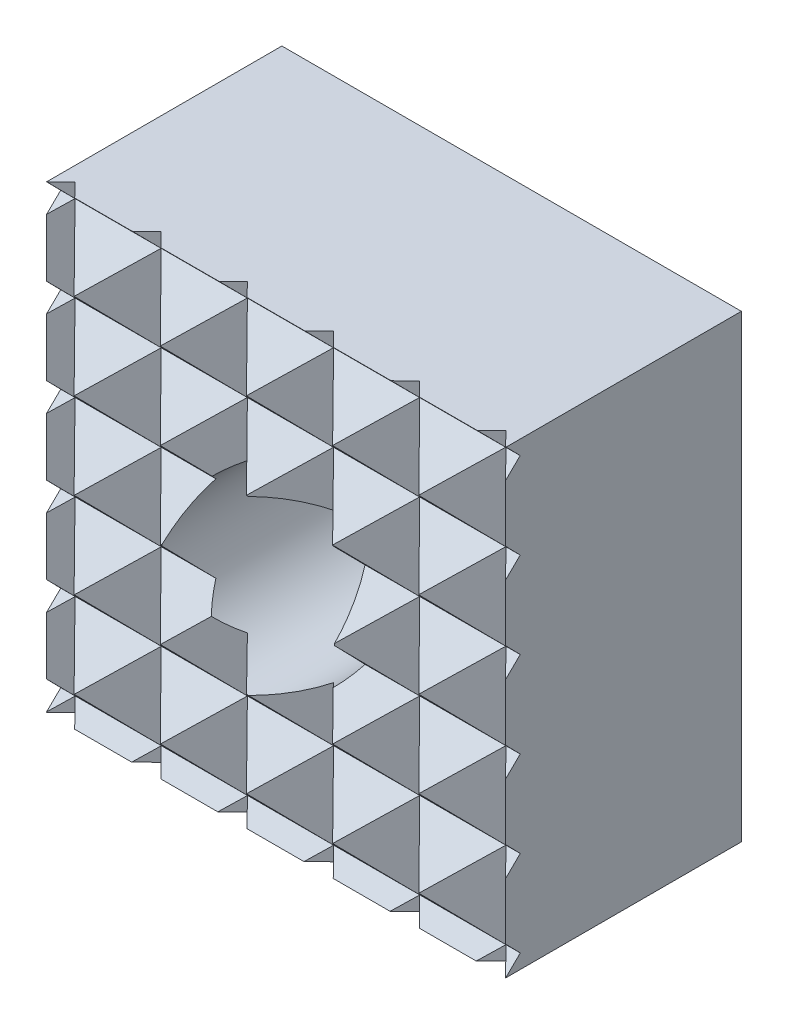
ISO-10303-21;
HEADER;
FILE_DESCRIPTION(('STEP AP214'),'2;1');
FILE_NAME('part.step','',(''),(''),'','','');
FILE_SCHEMA(('AUTOMOTIVE_DESIGN { 1 0 10303 214 1 1 1 1 }'));
ENDSEC;
DATA;
#1=APPLICATION_CONTEXT('core data for automotive mechanical design processes');
#2=APPLICATION_PROTOCOL_DEFINITION('international standard','automotive_design',2000,#1);
#3=PRODUCT_CONTEXT('',#1,'mechanical');
#4=PRODUCT('Part','Part','',(#3));
#5=PRODUCT_RELATED_PRODUCT_CATEGORY('part','',(#4));
#6=PRODUCT_DEFINITION_FORMATION('','',#4);
#7=PRODUCT_DEFINITION_CONTEXT('part definition',#1,'design');
#8=PRODUCT_DEFINITION('design','',#6,#7);
#9=PRODUCT_DEFINITION_SHAPE('','',#8);
#10=(LENGTH_UNIT() NAMED_UNIT(*) SI_UNIT(.MILLI.,.METRE.));
#11=(NAMED_UNIT(*) PLANE_ANGLE_UNIT() SI_UNIT($,.RADIAN.));
#12=(NAMED_UNIT(*) SI_UNIT($,.STERADIAN.) SOLID_ANGLE_UNIT());
#13=UNCERTAINTY_MEASURE_WITH_UNIT(LENGTH_MEASURE(1.E-05),#10,'distance_accuracy_value','');
#14=(GEOMETRIC_REPRESENTATION_CONTEXT(3) GLOBAL_UNCERTAINTY_ASSIGNED_CONTEXT((#13)) GLOBAL_UNIT_ASSIGNED_CONTEXT((#10,
#11,#12)) REPRESENTATION_CONTEXT('',''));
#15=CARTESIAN_POINT('',(0.,0.,0.));
#16=DIRECTION('',(0.,0.,1.));
#17=DIRECTION('',(1.,0.,0.));
#18=AXIS2_PLACEMENT_3D('',#15,#16,#17);
#19=CARTESIAN_POINT('',(-8.,-8.,10.));
#20=DIRECTION('',(0.,0.,-1.));
#21=DIRECTION('',(-1.,0.,0.));
#22=AXIS2_PLACEMENT_3D('',#19,#20,#21);
#23=PLANE('',#22);
#24=DIRECTION('',(0.,1.,0.));
#25=VECTOR('',#24,1.);
#26=CARTESIAN_POINT('',(-6.03253840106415,-8.,10.));
#27=LINE('',#26,#25);
#28=CARTESIAN_POINT('',(-6.03253840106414,6.0325384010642,10.));
#29=VERTEX_POINT('',#28);
#30=CARTESIAN_POINT('',(-6.03253840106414,6.0356448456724,10.));
#31=VERTEX_POINT('',#30);
#32=EDGE_CURVE('E1253',#29,#31,#27,.T.);
#33=ORIENTED_EDGE('',*,*,#32,.T.);
#34=DIRECTION('',(-1.,0.,0.));
#35=VECTOR('',#34,1.);
#36=CARTESIAN_POINT('',(-8.,6.0356448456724,10.));
#37=LINE('',#36,#35);
#38=CARTESIAN_POINT('',(-6.03564484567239,6.0356448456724,10.));
#39=VERTEX_POINT('',#38);
#40=EDGE_CURVE('E775',#31,#39,#37,.T.);
#41=ORIENTED_EDGE('',*,*,#40,.T.);
#42=DIRECTION('',(0.,-1.,0.));
#43=VECTOR('',#42,1.);
#44=CARTESIAN_POINT('',(-6.03564484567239,-8.,10.));
#45=LINE('',#44,#43);
#46=CARTESIAN_POINT('',(-6.03564484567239,6.0325384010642,10.));
#47=VERTEX_POINT('',#46);
#48=EDGE_CURVE('E1263',#39,#47,#45,.T.);
#49=ORIENTED_EDGE('',*,*,#48,.T.);
#50=DIRECTION('',(1.,0.,0.));
#51=VECTOR('',#50,1.);
#52=CARTESIAN_POINT('',(-8.,6.0325384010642,10.));
#53=LINE('',#52,#51);
#54=EDGE_CURVE('E669',#47,#29,#53,.T.);
#55=ORIENTED_EDGE('',*,*,#54,.T.);
#56=EDGE_LOOP('',(#33,#41,#49,#55));
#57=FACE_BOUND('',#56,.T.);
#58=ADVANCED_FACE('F15',(#57),#23,.F.);
#59=DIRECTION('',(0.,1.,0.));
#60=VECTOR('',#59,1.);
#61=CARTESIAN_POINT('',(-3.0333324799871,-8.,10.));
#62=LINE('',#61,#60);
#63=CARTESIAN_POINT('',(-3.0333324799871,6.0325384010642,10.));
#64=VERTEX_POINT('',#63);
#65=CARTESIAN_POINT('',(-3.0333324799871,6.0356448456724,10.));
#66=VERTEX_POINT('',#65);
#67=EDGE_CURVE('E1240',#64,#66,#62,.T.);
#68=ORIENTED_EDGE('',*,*,#67,.T.);
#69=DIRECTION('',(-1.,0.,0.));
#70=VECTOR('',#69,1.);
#71=CARTESIAN_POINT('',(-8.,6.0356448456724,10.));
#72=LINE('',#71,#70);
#73=CARTESIAN_POINT('',(-3.03488570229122,6.0356448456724,10.));
#74=VERTEX_POINT('',#73);
#75=EDGE_CURVE('E784',#66,#74,#72,.T.);
#76=ORIENTED_EDGE('',*,*,#75,.T.);
#77=DIRECTION('',(0.,-1.,0.));
#78=VECTOR('',#77,1.);
#79=CARTESIAN_POINT('',(-3.03488570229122,-8.,10.));
#80=LINE('',#79,#78);
#81=CARTESIAN_POINT('',(-3.03488570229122,6.0325384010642,10.));
#82=VERTEX_POINT('',#81);
#83=EDGE_CURVE('E1250',#74,#82,#80,.T.);
#84=ORIENTED_EDGE('',*,*,#83,.T.);
#85=DIRECTION('',(1.,0.,0.));
#86=VECTOR('',#85,1.);
#87=CARTESIAN_POINT('',(-8.,6.0325384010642,10.));
#88=LINE('',#87,#86);
#89=EDGE_CURVE('E739',#82,#64,#88,.T.);
#90=ORIENTED_EDGE('',*,*,#89,.T.);
#91=EDGE_LOOP('',(#68,#76,#84,#90));
#92=FACE_BOUND('',#91,.T.);
#93=ADVANCED_FACE('F1625',(#92),#23,.F.);
#94=CARTESIAN_POINT('',(2.96587344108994,-10.,9.99922358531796));
#95=DIRECTION('',(-0.699109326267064,0.,-0.715014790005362));
#96=DIRECTION('',(-0.715014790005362,0.,0.699109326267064));
#97=AXIS2_PLACEMENT_3D('',#94,#95,#96);
#98=PLANE('',#97);
#99=DIRECTION('',(0.,1.,0.));
#100=VECTOR('',#99,1.);
#101=CARTESIAN_POINT('',(2.96587344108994,-10.,9.99922358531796));
#102=LINE('',#101,#100);
#103=CARTESIAN_POINT('',(2.96587344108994,3.03253840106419,9.99922358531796));
#104=VERTEX_POINT('',#103);
#105=CARTESIAN_POINT('',(2.96587344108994,3.03564484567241,9.99922358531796));
#106=VERTEX_POINT('',#105);
#107=EDGE_CURVE('E1190',#104,#106,#102,.T.);
#108=ORIENTED_EDGE('',*,*,#107,.F.);
#109=DIRECTION('',(0.581630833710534,-0.581630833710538,-0.568692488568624));
#110=VECTOR('',#109,1.);
#111=CARTESIAN_POINT('',(7.37470854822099,-1.37629670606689,5.68846276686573));
#112=LINE('',#111,#110);
#113=CARTESIAN_POINT('',(4.49841184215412,1.5,8.50077641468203));
#114=VERTEX_POINT('',#113);
#115=EDGE_CURVE('E1173',#104,#114,#112,.T.);
#116=ORIENTED_EDGE('',*,*,#115,.T.);
#117=DIRECTION('',(-0.590286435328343,-0.564316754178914,0.577155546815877));
#118=VECTOR('',#117,1.);
#119=CARTESIAN_POINT('',(-0.376832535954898,-3.16075775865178,13.2675712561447));
#120=LINE('',#119,#118);
#121=CARTESIAN_POINT('',(2.9992562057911,0.0667997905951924,9.96658341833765));
#122=VERTEX_POINT('',#121);
#123=EDGE_CURVE('E1123',#114,#122,#120,.T.);
#124=ORIENTED_EDGE('',*,*,#123,.T.);
#125=CARTESIAN_POINT('',(0.,0.,12.8991213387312));
#126=DIRECTION('',(-0.699109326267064,0.,-0.715014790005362));
#127=DIRECTION('',(0.715014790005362,0.,-0.699109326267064));
#128=AXIS2_PLACEMENT_3D('',#125,#126,#127);
#129=ELLIPSE('',#128,4.19571740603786,3.);
#130=CARTESIAN_POINT('',(2.99999989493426,-0.000793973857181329,9.96585627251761));
#131=VERTEX_POINT('',#130);
#132=EDGE_CURVE('E1324',#131,#122,#129,.F.);
#133=ORIENTED_EDGE('',*,*,#132,.F.);
#134=DIRECTION('',(0.581630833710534,-0.581630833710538,-0.568692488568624));
#135=VECTOR('',#134,1.);
#136=CARTESIAN_POINT('',(6.36009390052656,-3.36088797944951,6.68050736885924));
#137=LINE('',#136,#135);
#138=CARTESIAN_POINT('',(4.49920592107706,-1.5,8.5));
#139=VERTEX_POINT('',#138);
#140=EDGE_CURVE('E1090',#131,#139,#137,.T.);
#141=ORIENTED_EDGE('',*,*,#140,.T.);
#142=DIRECTION('',(-0.590286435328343,-0.564316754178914,0.577155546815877));
#143=VECTOR('',#142,1.);
#144=CARTESIAN_POINT('',(0.622745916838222,-5.20591495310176,12.2902283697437));
#145=LINE('',#144,#143);
#146=CARTESIAN_POINT('',(2.96587344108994,-2.9658734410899,9.99922358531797));
#147=VERTEX_POINT('',#146);
#148=EDGE_CURVE('E1057',#139,#147,#145,.T.);
#149=ORIENTED_EDGE('',*,*,#148,.T.);
#150=DIRECTION('',(0.581630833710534,-0.581630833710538,-0.568692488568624));
#151=VECTOR('',#150,1.);
#152=CARTESIAN_POINT('',(5.34547925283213,-5.34547925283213,7.67255197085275));
#153=LINE('',#152,#151);
#154=CARTESIAN_POINT('',(4.5,-4.5,8.49922358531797));
#155=VERTEX_POINT('',#154);
#156=EDGE_CURVE('E999',#147,#155,#153,.T.);
#157=ORIENTED_EDGE('',*,*,#156,.T.);
#158=DIRECTION('',(0.,1.,0.));
#159=VECTOR('',#158,1.);
#160=CARTESIAN_POINT('',(4.5,-10.,8.49922358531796));
#161=LINE('',#160,#159);
#162=CARTESIAN_POINT('',(4.5,8.,8.49922358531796));
#163=VERTEX_POINT('',#162);
#164=EDGE_CURVE('E1198',#155,#163,#161,.T.);
#165=ORIENTED_EDGE('',*,*,#164,.T.);
#166=DIRECTION('',(0.715014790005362,0.,-0.699109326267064));
#167=VECTOR('',#166,1.);
#168=CARTESIAN_POINT('',(-2.64077524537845,8.,15.4811526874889));
#169=LINE('',#168,#167);
#170=CARTESIAN_POINT('',(3.99682368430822,8.,8.9912067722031));
#171=VERTEX_POINT('',#170);
#172=EDGE_CURVE('E1218',#171,#163,#169,.T.);
#173=ORIENTED_EDGE('',*,*,#172,.F.);
#174=DIRECTION('',(0.581630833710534,-0.581630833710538,-0.568692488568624));
#175=VECTOR('',#174,1.);
#176=CARTESIAN_POINT('',(9.40393784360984,2.59288584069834,3.7043735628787));
#177=LINE('',#176,#175);
#178=CARTESIAN_POINT('',(4.49682368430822,7.5,8.50232924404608));
#179=VERTEX_POINT('',#178);
#180=EDGE_CURVE('E858',#171,#179,#177,.T.);
#181=ORIENTED_EDGE('',*,*,#180,.T.);
#182=DIRECTION('',(-0.590286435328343,-0.564316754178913,0.577155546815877));
#183=VECTOR('',#182,1.);
#184=CARTESIAN_POINT('',(-2.37598944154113,0.929556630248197,15.2222570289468));
#185=LINE('',#184,#183);
#186=CARTESIAN_POINT('',(2.96587344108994,6.03640398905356,9.99922358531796));
#187=VERTEX_POINT('',#186);
#188=EDGE_CURVE('E811',#179,#187,#185,.T.);
#189=ORIENTED_EDGE('',*,*,#188,.T.);
#190=CARTESIAN_POINT('',(2.96587344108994,6.03174432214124,9.99922358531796));
#191=VERTEX_POINT('',#190);
#192=EDGE_CURVE('E1191',#191,#187,#102,.T.);
#193=ORIENTED_EDGE('',*,*,#192,.F.);
#194=DIRECTION('',(0.581630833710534,-0.581630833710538,-0.568692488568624));
#195=VECTOR('',#194,1.);
#196=CARTESIAN_POINT('',(8.38932319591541,0.608294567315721,4.69641816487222));
#197=LINE('',#196,#195);
#198=CARTESIAN_POINT('',(4.49761776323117,4.5,8.50155282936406));
#199=VERTEX_POINT('',#198);
#200=EDGE_CURVE('E766',#191,#199,#197,.T.);
#201=ORIENTED_EDGE('',*,*,#200,.T.);
#202=DIRECTION('',(-0.590286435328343,-0.564316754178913,0.577155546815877));
#203=VECTOR('',#202,1.);
#204=CARTESIAN_POINT('',(-1.37641098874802,-1.11560056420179,14.2449141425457));
#205=LINE('',#204,#203);
#206=EDGE_CURVE('E727',#199,#106,#205,.T.);
#207=ORIENTED_EDGE('',*,*,#206,.T.);
#208=EDGE_LOOP('',(#108,#116,#124,#133,#141,#149,#157,#165,#173,#181,#189,#193,#201,#207));
#209=FACE_BOUND('',#208,.T.);
#210=ADVANCED_FACE('F1494',(#209),#98,.F.);
#211=CARTESIAN_POINT('',(1.50000000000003,-10.,8.5));
#212=DIRECTION('',(0.715014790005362,0.,-0.699109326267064));
#213=DIRECTION('',(-0.699109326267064,0.,-0.715014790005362));
#214=AXIS2_PLACEMENT_3D('',#211,#212,#213);
#215=PLANE('',#214);
#216=DIRECTION('',(0.564316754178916,0.590286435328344,0.577155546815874));
#217=VECTOR('',#216,1.);
#218=CARTESIAN_POINT('',(-0.332361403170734,-6.41589202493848,6.62595047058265));
#219=LINE('',#218,#217);
#220=CARTESIAN_POINT('',(1.50000000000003,-4.49920592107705,8.5));
#221=VERTEX_POINT('',#220);
#222=EDGE_CURVE('E1002',#221,#147,#219,.T.);
#223=ORIENTED_EDGE('',*,*,#222,.T.);
#224=DIRECTION('',(-0.572972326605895,0.57297232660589,-0.586008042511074));
#225=VECTOR('',#224,1.);
#226=CARTESIAN_POINT('',(4.29052693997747,-4.29052693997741,11.3540143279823));
#227=LINE('',#226,#225);
#228=CARTESIAN_POINT('',(2.12132034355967,-2.12132034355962,9.13545602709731));
#229=VERTEX_POINT('',#228);
#230=EDGE_CURVE('E1053',#147,#229,#227,.T.);
#231=ORIENTED_EDGE('',*,*,#230,.T.);
#232=CARTESIAN_POINT('',(0.,0.,6.96587344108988));
#233=DIRECTION('',(0.715014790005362,0.,-0.699109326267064));
#234=DIRECTION('',(-0.699109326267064,0.,-0.715014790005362));
#235=AXIS2_PLACEMENT_3D('',#232,#233,#234);
#236=ELLIPSE('',#235,4.29117433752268,3.);
#237=CARTESIAN_POINT('',(1.50000000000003,-2.5980762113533,8.5));
#238=VERTEX_POINT('',#237);
#239=EDGE_CURVE('E1338',#238,#229,#236,.F.);
#240=ORIENTED_EDGE('',*,*,#239,.F.);
#241=DIRECTION('',(0.,1.,0.));
#242=VECTOR('',#241,1.);
#243=CARTESIAN_POINT('',(1.50000000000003,-10.,8.5));
#244=LINE('',#243,#242);
#245=EDGE_CURVE('E1189',#221,#238,#244,.T.);
#246=ORIENTED_EDGE('',*,*,#245,.F.);
#247=EDGE_LOOP('',(#223,#231,#240,#246));
#248=FACE_BOUND('',#247,.T.);
#249=ADVANCED_FACE('F1583',(#248),#215,.F.);
#250=CARTESIAN_POINT('',(-0.0341265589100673,-10.,10.));
#251=DIRECTION('',(-0.699109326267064,0.,-0.715014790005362));
#252=DIRECTION('',(-0.715014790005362,0.,0.699109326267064));
#253=AXIS2_PLACEMENT_3D('',#250,#251,#252);
#254=PLANE('',#253);
#255=CARTESIAN_POINT('',(0.,0.,9.96663258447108));
#256=DIRECTION('',(-0.699109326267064,0.,-0.715014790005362));
#257=DIRECTION('',(0.715014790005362,0.,-0.699109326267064));
#258=AXIS2_PLACEMENT_3D('',#255,#256,#257);
#259=ELLIPSE('',#258,4.19571740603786,3.);
#260=CARTESIAN_POINT('',(0.000793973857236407,-2.99999989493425,9.96585627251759));
#261=VERTEX_POINT('',#260);
#262=EDGE_CURVE('E1339',#261,#238,#259,.F.);
#263=ORIENTED_EDGE('',*,*,#262,.F.);
#264=DIRECTION('',(0.581630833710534,-0.581630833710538,-0.568692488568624));
#265=VECTOR('',#264,1.);
#266=CARTESIAN_POINT('',(2.34574788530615,-5.34495380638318,7.67306572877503));
#267=LINE('',#266,#265);
#268=EDGE_CURVE('E1005',#261,#221,#267,.T.);
#269=ORIENTED_EDGE('',*,*,#268,.T.);
#270=ORIENTED_EDGE('',*,*,#245,.T.);
#271=EDGE_LOOP('',(#263,#269,#270));
#272=FACE_BOUND('',#271,.T.);
#273=ADVANCED_FACE('F1580',(#272),#254,.F.);
#274=CARTESIAN_POINT('',(-1.49999999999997,-10.,8.50077641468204));
#275=DIRECTION('',(0.715014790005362,0.,-0.699109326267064));
#276=DIRECTION('',(-0.699109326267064,0.,-0.715014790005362));
#277=AXIS2_PLACEMENT_3D('',#274,#275,#276);
#278=PLANE('',#277);
#279=DIRECTION('',(0.,1.,0.));
#280=VECTOR('',#279,1.);
#281=CARTESIAN_POINT('',(-1.49999999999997,-10.,8.50077641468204));
#282=LINE('',#281,#280);
#283=CARTESIAN_POINT('',(-1.49999999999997,-4.49841184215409,8.50077641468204));
#284=VERTEX_POINT('',#283);
#285=CARTESIAN_POINT('',(-1.49999999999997,-2.59807621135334,8.50077641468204));
#286=VERTEX_POINT('',#285);
#287=EDGE_CURVE('E1179',#284,#286,#282,.T.);
#288=ORIENTED_EDGE('',*,*,#287,.F.);
#289=DIRECTION('',(0.564316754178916,0.590286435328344,0.577155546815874));
#290=VECTOR('',#289,1.);
#291=CARTESIAN_POINT('',(-3.33262591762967,-6.41537463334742,6.62645635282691));
#292=LINE('',#291,#290);
#293=CARTESIAN_POINT('',(-0.066799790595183,-2.9992562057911,9.96658341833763));
#294=VERTEX_POINT('',#293);
#295=EDGE_CURVE('E1011',#284,#294,#292,.T.);
#296=ORIENTED_EDGE('',*,*,#295,.T.);
#297=CARTESIAN_POINT('',(0.,0.,10.0349029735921));
#298=DIRECTION('',(0.715014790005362,0.,-0.699109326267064));
#299=DIRECTION('',(-0.699109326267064,0.,-0.715014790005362));
#300=AXIS2_PLACEMENT_3D('',#297,#298,#299);
#301=ELLIPSE('',#300,4.29117433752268,3.);
#302=EDGE_CURVE('E1344',#286,#294,#301,.F.);
#303=ORIENTED_EDGE('',*,*,#302,.F.);
#304=EDGE_LOOP('',(#288,#296,#303));
#305=FACE_BOUND('',#304,.T.);
#306=ADVANCED_FACE('F1595',(#305),#278,.F.);
#307=CARTESIAN_POINT('',(-3.03412655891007,-10.,10.000776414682));
#308=DIRECTION('',(-0.699109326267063,0.,-0.715014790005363));
#309=DIRECTION('',(-0.715014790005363,0.,0.699109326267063));
#310=AXIS2_PLACEMENT_3D('',#307,#308,#309);
#311=PLANE('',#310);
#312=CARTESIAN_POINT('',(-3.0333324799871,3.03333247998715,10.));
#313=VERTEX_POINT('',#312);
#314=CARTESIAN_POINT('',(-3.0333324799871,3.03488570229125,10.));
#315=VERTEX_POINT('',#314);
#316=EDGE_CURVE('E1243',#313,#315,#62,.T.);
#317=ORIENTED_EDGE('',*,*,#316,.F.);
#318=DIRECTION('',(0.581630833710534,-0.581630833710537,-0.568692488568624));
#319=VECTOR('',#318,1.);
#320=CARTESIAN_POINT('',(1.37524581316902,-1.375245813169,5.68949028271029));
#321=LINE('',#320,#319);
#322=CARTESIAN_POINT('',(-2.12132034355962,2.12132034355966,9.10827552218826));
#323=VERTEX_POINT('',#322);
#324=EDGE_CURVE('E1144',#313,#323,#321,.T.);
#325=ORIENTED_EDGE('',*,*,#324,.T.);
#326=CARTESIAN_POINT('',(0.,0.,7.03414383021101));
#327=DIRECTION('',(-0.699109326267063,0.,-0.715014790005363));
#328=DIRECTION('',(0.715014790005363,0.,-0.699109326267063));
#329=AXIS2_PLACEMENT_3D('',#326,#327,#328);
#330=ELLIPSE('',#329,4.19571740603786,3.);
#331=CARTESIAN_POINT('',(-1.49999999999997,2.59807621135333,8.50077641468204));
#332=VERTEX_POINT('',#331);
#333=EDGE_CURVE('E1345',#332,#323,#330,.F.);
#334=ORIENTED_EDGE('',*,*,#333,.F.);
#335=CARTESIAN_POINT('',(-1.49999999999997,8.,8.50077641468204));
#336=VERTEX_POINT('',#335);
#337=EDGE_CURVE('E1176',#332,#336,#282,.T.);
#338=ORIENTED_EDGE('',*,*,#337,.T.);
#339=DIRECTION('',(0.715014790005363,0.,-0.699109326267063));
#340=VECTOR('',#339,1.);
#341=CARTESIAN_POINT('',(-5.57252212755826,8.,12.482705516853));
#342=LINE('',#341,#340);
#343=CARTESIAN_POINT('',(-2.00158815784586,8.,8.9912067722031));
#344=VERTEX_POINT('',#343);
#345=EDGE_CURVE('E1238',#344,#336,#342,.T.);
#346=ORIENTED_EDGE('',*,*,#345,.F.);
#347=DIRECTION('',(0.581630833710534,-0.581630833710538,-0.568692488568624));
#348=VECTOR('',#347,1.);
#349=CARTESIAN_POINT('',(3.40447510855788,2.59393673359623,3.70540107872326));
#350=LINE('',#349,#348);
#351=CARTESIAN_POINT('',(-1.50158815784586,7.5,8.50232924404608));
#352=VERTEX_POINT('',#351);
#353=EDGE_CURVE('E831',#344,#352,#350,.T.);
#354=ORIENTED_EDGE('',*,*,#353,.T.);
#355=DIRECTION('',(-0.590286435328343,-0.564316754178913,0.577155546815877));
#356=VECTOR('',#355,1.);
#357=CARTESIAN_POINT('',(-8.37548368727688,0.928521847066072,15.2233153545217));
#358=LINE('',#357,#356);
#359=EDGE_CURVE('E787',#352,#66,#358,.T.);
#360=ORIENTED_EDGE('',*,*,#359,.T.);
#361=ORIENTED_EDGE('',*,*,#67,.F.);
#362=DIRECTION('',(0.581630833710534,-0.581630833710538,-0.568692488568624));
#363=VECTOR('',#362,1.);
#364=CARTESIAN_POINT('',(2.38986046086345,0.609345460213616,4.69744568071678));
#365=LINE('',#364,#363);
#366=CARTESIAN_POINT('',(-1.50079407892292,4.5,8.50155282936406));
#367=VERTEX_POINT('',#366);
#368=EDGE_CURVE('E742',#64,#367,#365,.T.);
#369=ORIENTED_EDGE('',*,*,#368,.T.);
#370=DIRECTION('',(-0.590286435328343,-0.564316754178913,0.577155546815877));
#371=VECTOR('',#370,1.);
#372=CARTESIAN_POINT('',(-7.37590523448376,-1.11663534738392,14.2459724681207));
#373=LINE('',#372,#371);
#374=EDGE_CURVE('E703',#367,#315,#373,.T.);
#375=ORIENTED_EDGE('',*,*,#374,.T.);
#376=EDGE_LOOP('',(#317,#325,#334,#338,#346,#354,#360,#361,#369,#375));
#377=FACE_BOUND('',#376,.T.);
#378=ADVANCED_FACE('F1476',(#377),#311,.F.);
#379=CARTESIAN_POINT('',(-2.99925839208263,0.0667015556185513,9.9666838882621));
#380=VERTEX_POINT('',#379);
#381=CARTESIAN_POINT('',(-2.99999989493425,0.000793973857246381,9.96740889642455));
#382=VERTEX_POINT('',#381);
#383=EDGE_CURVE('E1349',#380,#382,#330,.F.);
#384=ORIENTED_EDGE('',*,*,#383,.F.);
#385=DIRECTION('',(-0.590286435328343,-0.564316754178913,0.577155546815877));
#386=VECTOR('',#385,1.);
#387=CARTESIAN_POINT('',(-6.37632678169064,-3.16179254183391,13.2686295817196));
#388=LINE('',#387,#386);
#389=CARTESIAN_POINT('',(-3.0333324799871,0.0341265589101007,10.));
#390=VERTEX_POINT('',#389);
#391=EDGE_CURVE('E1117',#380,#390,#388,.T.);
#392=ORIENTED_EDGE('',*,*,#391,.T.);
#393=DIRECTION('',(0.581630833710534,-0.581630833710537,-0.568692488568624));
#394=VECTOR('',#393,1.);
#395=CARTESIAN_POINT('',(0.360631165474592,-3.35983708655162,6.6815348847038));
#396=LINE('',#395,#394);
#397=EDGE_CURVE('E1084',#390,#382,#396,.T.);
#398=ORIENTED_EDGE('',*,*,#397,.T.);
#399=EDGE_LOOP('',(#384,#392,#398));
#400=FACE_BOUND('',#399,.T.);
#401=ADVANCED_FACE('F2264',(#400),#311,.F.);
#402=CARTESIAN_POINT('',(-2.1348626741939,-2.10769100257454,9.1215166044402));
#403=VERTEX_POINT('',#402);
#404=EDGE_CURVE('E1350',#403,#286,#330,.F.);
#405=ORIENTED_EDGE('',*,*,#404,.F.);
#406=DIRECTION('',(-0.590286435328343,-0.564316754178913,0.577155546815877));
#407=VECTOR('',#406,1.);
#408=CARTESIAN_POINT('',(-5.37674832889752,-5.20694973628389,12.2912866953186));
#409=LINE('',#408,#407);
#410=CARTESIAN_POINT('',(-3.03253840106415,-2.9658734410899,9.99922358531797));
#411=VERTEX_POINT('',#410);
#412=EDGE_CURVE('E1047',#403,#411,#409,.T.);
#413=ORIENTED_EDGE('',*,*,#412,.T.);
#414=DIRECTION('',(0.581630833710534,-0.581630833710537,-0.568692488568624));
#415=VECTOR('',#414,1.);
#416=CARTESIAN_POINT('',(-0.653983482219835,-5.34442835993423,7.67357948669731));
#417=LINE('',#416,#415);
#418=EDGE_CURVE('E1014',#411,#284,#417,.T.);
#419=ORIENTED_EDGE('',*,*,#418,.T.);
#420=ORIENTED_EDGE('',*,*,#287,.T.);
#421=EDGE_LOOP('',(#405,#413,#419,#420));
#422=FACE_BOUND('',#421,.T.);
#423=ADVANCED_FACE('F2099',(#422),#311,.F.);
#424=CARTESIAN_POINT('',(7.5,-10.,8.49844717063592));
#425=DIRECTION('',(0.715014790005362,0.,-0.699109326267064));
#426=DIRECTION('',(-0.699109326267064,0.,-0.715014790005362));
#427=AXIS2_PLACEMENT_3D('',#424,#425,#426);
#428=PLANE('',#427);
#429=DIRECTION('',(-0.572972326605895,0.57297232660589,-0.586008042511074));
#430=VECTOR('',#429,1.);
#431=CARTESIAN_POINT('',(11.2761664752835,-2.27388904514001,12.3605253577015));
#432=LINE('',#431,#430);
#433=CARTESIAN_POINT('',(8.,1.00227743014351,9.00982269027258));
#434=VERTEX_POINT('',#433);
#435=CARTESIAN_POINT('',(7.50227743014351,1.5,8.50077641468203));
#436=VERTEX_POINT('',#435);
#437=EDGE_CURVE('E1111',#434,#436,#432,.T.);
#438=ORIENTED_EDGE('',*,*,#437,.T.);
#439=DIRECTION('',(0.564316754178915,0.590286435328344,0.577155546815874));
#440=VECTOR('',#439,1.);
#441=CARTESIAN_POINT('',(3.67004550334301,-2.5085900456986,4.58135722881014));
#442=LINE('',#441,#440);
#443=CARTESIAN_POINT('',(8.,2.02062760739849,9.00982269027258));
#444=VERTEX_POINT('',#443);
#445=EDGE_CURVE('E1158',#436,#444,#442,.T.);
#446=ORIENTED_EDGE('',*,*,#445,.T.);
#447=DIRECTION('',(0.,-1.,0.));
#448=VECTOR('',#447,1.);
#449=CARTESIAN_POINT('',(8.,8.,9.00982269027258));
#450=LINE('',#449,#448);
#451=CARTESIAN_POINT('',(8.,4.00303657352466,9.00982269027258));
#452=VERTEX_POINT('',#451);
#453=EDGE_CURVE('E1770',#452,#444,#450,.T.);
#454=ORIENTED_EDGE('',*,*,#453,.F.);
#455=DIRECTION('',(-0.572972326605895,0.57297232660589,-0.586008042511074));
#456=VECTOR('',#455,1.);
#457=CARTESIAN_POINT('',(12.2613075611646,-0.258270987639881,13.3680794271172));
#458=LINE('',#457,#456);
#459=CARTESIAN_POINT('',(7.50303657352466,4.5,8.50155282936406));
#460=VERTEX_POINT('',#459);
#461=EDGE_CURVE('E712',#452,#460,#458,.T.);
#462=ORIENTED_EDGE('',*,*,#461,.T.);
#463=DIRECTION('',(0.564316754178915,0.590286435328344,0.577155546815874));
#464=VECTOR('',#463,1.);
#465=CARTESIAN_POINT('',(2.67098444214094,-0.554421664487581,3.55956649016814));
#466=LINE('',#465,#464);
#467=CARTESIAN_POINT('',(8.,5.01983352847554,9.00982269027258));
#468=VERTEX_POINT('',#467);
#469=EDGE_CURVE('E751',#460,#468,#466,.T.);
#470=ORIENTED_EDGE('',*,*,#469,.T.);
#471=CARTESIAN_POINT('',(8.,7.00379571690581,9.00982269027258));
#472=VERTEX_POINT('',#471);
#473=EDGE_CURVE('E1278',#472,#468,#450,.T.);
#474=ORIENTED_EDGE('',*,*,#473,.F.);
#475=DIRECTION('',(-0.572972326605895,0.57297232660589,-0.586008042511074));
#476=VECTOR('',#475,1.);
#477=CARTESIAN_POINT('',(13.2464486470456,1.75734706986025,14.375633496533));
#478=LINE('',#477,#476);
#479=CARTESIAN_POINT('',(7.5037957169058,7.5,8.50232924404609));
#480=VERTEX_POINT('',#479);
#481=EDGE_CURVE('E796',#472,#480,#478,.T.);
#482=ORIENTED_EDGE('',*,*,#481,.T.);
#483=DIRECTION('',(0.564316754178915,0.590286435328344,0.577155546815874));
#484=VECTOR('',#483,1.);
#485=CARTESIAN_POINT('',(1.67192338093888,1.39974671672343,2.53777575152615));
#486=LINE('',#485,#484);
#487=CARTESIAN_POINT('',(7.98179819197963,8.,8.9912067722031));
#488=VERTEX_POINT('',#487);
#489=EDGE_CURVE('E841',#480,#488,#486,.T.);
#490=ORIENTED_EDGE('',*,*,#489,.T.);
#491=DIRECTION('',(0.699109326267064,0.,0.715014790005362));
#492=VECTOR('',#491,1.);
#493=CARTESIAN_POINT('',(0.674901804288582,8.,1.51807089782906));
#494=LINE('',#493,#492);
#495=CARTESIAN_POINT('',(7.5,8.,8.49844717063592));
#496=VERTEX_POINT('',#495);
#497=EDGE_CURVE('E1361',#496,#488,#494,.T.);
#498=ORIENTED_EDGE('',*,*,#497,.F.);
#499=DIRECTION('',(0.,1.,0.));
#500=VECTOR('',#499,1.);
#501=CARTESIAN_POINT('',(7.5,-10.,8.49844717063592));
#502=LINE('',#501,#500);
#503=CARTESIAN_POINT('',(7.5,-7.5,8.49844717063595));
#504=VERTEX_POINT('',#503);
#505=EDGE_CURVE('E1207',#504,#496,#502,.T.);
#506=ORIENTED_EDGE('',*,*,#505,.F.);
#507=DIRECTION('',(0.564316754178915,0.590286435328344,0.577155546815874));
#508=VECTOR('',#507,1.);
#509=CARTESIAN_POINT('',(6.66722868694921,-8.37109518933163,7.64672944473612));
#510=LINE('',#509,#508);
#511=CARTESIAN_POINT('',(8.,-6.97699015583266,9.00982269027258));
#512=VERTEX_POINT('',#511);
#513=EDGE_CURVE('E924',#504,#512,#510,.T.);
#514=ORIENTED_EDGE('',*,*,#513,.T.);
#515=CARTESIAN_POINT('',(8.,-4.99924085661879,9.00982269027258));
#516=VERTEX_POINT('',#515);
#517=EDGE_CURVE('E1274',#516,#512,#450,.T.);
#518=ORIENTED_EDGE('',*,*,#517,.F.);
#519=DIRECTION('',(-0.572972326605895,0.572972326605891,-0.586008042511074));
#520=VECTOR('',#519,1.);
#521=CARTESIAN_POINT('',(9.30588430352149,-6.30512516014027,10.34541721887));
#522=LINE('',#521,#520);
#523=CARTESIAN_POINT('',(7.50075914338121,-4.5,8.49922358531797));
#524=VERTEX_POINT('',#523);
#525=EDGE_CURVE('E964',#516,#524,#522,.T.);
#526=ORIENTED_EDGE('',*,*,#525,.T.);
#527=DIRECTION('',(0.564316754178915,0.590286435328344,0.577155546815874));
#528=VECTOR('',#527,1.);
#529=CARTESIAN_POINT('',(5.66816762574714,-6.41692680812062,6.62493870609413));
#530=LINE('',#529,#528);
#531=CARTESIAN_POINT('',(8.,-3.9777842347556,9.00982269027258));
#532=VERTEX_POINT('',#531);
#533=EDGE_CURVE('E1017',#524,#532,#530,.T.);
#534=ORIENTED_EDGE('',*,*,#533,.T.);
#535=CARTESIAN_POINT('',(8.,-1.99848171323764,9.00982269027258));
#536=VERTEX_POINT('',#535);
#537=EDGE_CURVE('E1277',#536,#532,#450,.T.);
#538=ORIENTED_EDGE('',*,*,#537,.F.);
#539=DIRECTION('',(-0.572972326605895,0.572972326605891,-0.586008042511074));
#540=VECTOR('',#539,1.);
#541=CARTESIAN_POINT('',(10.2910253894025,-4.28950710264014,11.3529712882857));
#542=LINE('',#541,#540);
#543=CARTESIAN_POINT('',(7.50151828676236,-1.5,8.5));
#544=VERTEX_POINT('',#543);
#545=EDGE_CURVE('E1041',#536,#544,#542,.T.);
#546=ORIENTED_EDGE('',*,*,#545,.T.);
#547=DIRECTION('',(0.564316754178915,0.590286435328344,0.577155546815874));
#548=VECTOR('',#547,1.);
#549=CARTESIAN_POINT('',(4.66910656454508,-4.4627584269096,5.60314796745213));
#550=LINE('',#549,#548);
#551=CARTESIAN_POINT('',(8.,-0.978578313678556,9.00982269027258));
#552=VERTEX_POINT('',#551);
#553=EDGE_CURVE('E1078',#544,#552,#550,.T.);
#554=ORIENTED_EDGE('',*,*,#553,.T.);
#555=EDGE_CURVE('E1772',#434,#552,#450,.T.);
#556=ORIENTED_EDGE('',*,*,#555,.F.);
#557=EDGE_LOOP('',(#438,#446,#454,#462,#470,#474,#482,#490,#498,#506,#514,#518,#526,#534,#538,
#546,#554,#556));
#558=FACE_BOUND('',#557,.T.);
#559=ADVANCED_FACE('F1508',(#558),#428,.F.);
#560=CARTESIAN_POINT('',(5.96587344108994,-10.,9.99844717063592));
#561=DIRECTION('',(-0.699109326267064,0.,-0.715014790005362));
#562=DIRECTION('',(-0.715014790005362,0.,0.699109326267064));
#563=AXIS2_PLACEMENT_3D('',#560,#561,#562);
#564=PLANE('',#563);
#565=DIRECTION('',(0.,1.,0.));
#566=VECTOR('',#565,1.);
#567=CARTESIAN_POINT('',(5.96587344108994,-10.,9.99844717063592));
#568=LINE('',#567,#566);
#569=CARTESIAN_POINT('',(5.96587344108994,3.03174432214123,9.99844717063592));
#570=VERTEX_POINT('',#569);
#571=CARTESIAN_POINT('',(5.96587344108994,3.03640398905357,9.99844717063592));
#572=VERTEX_POINT('',#571);
#573=EDGE_CURVE('E1202',#570,#572,#568,.T.);
#574=ORIENTED_EDGE('',*,*,#573,.F.);
#575=DIRECTION('',(0.581630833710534,-0.581630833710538,-0.568692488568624));
#576=VECTOR('',#575,1.);
#577=CARTESIAN_POINT('',(10.374439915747,-1.37682215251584,5.68794900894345));
#578=LINE('',#577,#576);
#579=CARTESIAN_POINT('',(7.49761776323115,1.5,8.50077641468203));
#580=VERTEX_POINT('',#579);
#581=EDGE_CURVE('E1155',#570,#580,#578,.T.);
#582=ORIENTED_EDGE('',*,*,#581,.T.);
#583=DIRECTION('',(-0.590286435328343,-0.564316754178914,0.577155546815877));
#584=VECTOR('',#583,1.);
#585=CARTESIAN_POINT('',(2.62291458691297,-3.16024036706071,13.2670420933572));
#586=LINE('',#585,#584);
#587=CARTESIAN_POINT('',(5.96587344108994,0.035644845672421,9.99844717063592));
#588=VERTEX_POINT('',#587);
#589=EDGE_CURVE('E1108',#580,#588,#586,.T.);
#590=ORIENTED_EDGE('',*,*,#589,.T.);
#591=CARTESIAN_POINT('',(5.96587344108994,0.032538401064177,9.99844717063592));
#592=VERTEX_POINT('',#591);
#593=EDGE_CURVE('E1837',#592,#588,#568,.T.);
#594=ORIENTED_EDGE('',*,*,#593,.F.);
#595=DIRECTION('',(0.581630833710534,-0.581630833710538,-0.568692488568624));
#596=VECTOR('',#595,1.);
#597=CARTESIAN_POINT('',(9.35982526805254,-3.36141342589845,6.67999361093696));
#598=LINE('',#597,#596);
#599=CARTESIAN_POINT('',(7.4984118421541,-1.5,8.5));
#600=VERTEX_POINT('',#599);
#601=EDGE_CURVE('E1075',#592,#600,#598,.T.);
#602=ORIENTED_EDGE('',*,*,#601,.T.);
#603=DIRECTION('',(-0.590286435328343,-0.564316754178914,0.577155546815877));
#604=VECTOR('',#603,1.);
#605=CARTESIAN_POINT('',(3.62249303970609,-5.2053975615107,12.2896992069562));
#606=LINE('',#605,#604);
#607=CARTESIAN_POINT('',(5.96587344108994,-2.96511429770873,9.99844717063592));
#608=VERTEX_POINT('',#607);
#609=EDGE_CURVE('E1038',#600,#608,#606,.T.);
#610=ORIENTED_EDGE('',*,*,#609,.T.);
#611=CARTESIAN_POINT('',(5.96587344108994,-2.96666752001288,9.99844717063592));
#612=VERTEX_POINT('',#611);
#613=EDGE_CURVE('E1204',#612,#608,#568,.T.);
#614=ORIENTED_EDGE('',*,*,#613,.F.);
#615=DIRECTION('',(0.581630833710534,-0.581630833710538,-0.568692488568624));
#616=VECTOR('',#615,1.);
#617=CARTESIAN_POINT('',(8.34521062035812,-5.34600469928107,7.67203821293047));
#618=LINE('',#617,#616);
#619=CARTESIAN_POINT('',(7.49920592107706,-4.5,8.49922358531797));
#620=VERTEX_POINT('',#619);
#621=EDGE_CURVE('E997',#612,#620,#618,.T.);
#622=ORIENTED_EDGE('',*,*,#621,.T.);
#623=DIRECTION('',(-0.590286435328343,-0.564316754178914,0.577155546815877));
#624=VECTOR('',#623,1.);
#625=CARTESIAN_POINT('',(4.62207149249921,-7.25055475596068,11.3123563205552));
#626=LINE('',#625,#624);
#627=CARTESIAN_POINT('',(5.96587344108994,-5.96587344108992,9.99844717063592));
#628=VERTEX_POINT('',#627);
#629=EDGE_CURVE('E38',#620,#628,#626,.T.);
#630=ORIENTED_EDGE('',*,*,#629,.T.);
#631=DIRECTION('',(0.581630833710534,-0.581630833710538,-0.568692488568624));
#632=VECTOR('',#631,1.);
#633=CARTESIAN_POINT('',(7.33059597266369,-7.33059597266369,8.66408281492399));
#634=LINE('',#633,#632);
#635=EDGE_CURVE('E922',#628,#504,#634,.T.);
#636=ORIENTED_EDGE('',*,*,#635,.T.);
#637=ORIENTED_EDGE('',*,*,#505,.T.);
#638=DIRECTION('',(0.715014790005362,0.,-0.699109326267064));
#639=VECTOR('',#638,1.);
#640=CARTESIAN_POINT('',(-1.17490180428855,8.,16.9803762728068));
#641=LINE('',#640,#639);
#642=CARTESIAN_POINT('',(6.99602960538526,8.,8.9912067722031));
#643=VERTEX_POINT('',#642);
#644=EDGE_CURVE('E1364',#643,#496,#641,.T.);
#645=ORIENTED_EDGE('',*,*,#644,.F.);
#646=DIRECTION('',(0.581630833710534,-0.581630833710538,-0.568692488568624));
#647=VECTOR('',#646,1.);
#648=CARTESIAN_POINT('',(12.4036692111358,2.5923603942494,3.70385980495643));
#649=LINE('',#648,#647);
#650=CARTESIAN_POINT('',(7.49602960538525,7.5,8.50232924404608));
#651=VERTEX_POINT('',#650);
#652=EDGE_CURVE('E838',#643,#651,#649,.T.);
#653=ORIENTED_EDGE('',*,*,#652,.T.);
#654=DIRECTION('',(-0.590286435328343,-0.564316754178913,0.577155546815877));
#655=VECTOR('',#654,1.);
#656=CARTESIAN_POINT('',(0.623757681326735,0.930074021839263,15.2217278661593));
#657=LINE('',#656,#655);
#658=CARTESIAN_POINT('',(5.96587344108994,6.03716313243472,9.99844717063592));
#659=VERTEX_POINT('',#658);
#660=EDGE_CURVE('E793',#651,#659,#657,.T.);
#661=ORIENTED_EDGE('',*,*,#660,.T.);
#662=CARTESIAN_POINT('',(5.96587344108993,6.03095024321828,9.99844717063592));
#663=VERTEX_POINT('',#662);
#664=EDGE_CURVE('E1199',#663,#659,#568,.T.);
#665=ORIENTED_EDGE('',*,*,#664,.F.);
#666=DIRECTION('',(0.581630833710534,-0.581630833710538,-0.568692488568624));
#667=VECTOR('',#666,1.);
#668=CARTESIAN_POINT('',(11.3890545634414,0.607769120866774,4.69590440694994));
#669=LINE('',#668,#667);
#670=CARTESIAN_POINT('',(7.4968236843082,4.5,8.50155282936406));
#671=VERTEX_POINT('',#670);
#672=EDGE_CURVE('E748',#663,#671,#669,.T.);
#673=ORIENTED_EDGE('',*,*,#672,.T.);
#674=DIRECTION('',(-0.590286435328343,-0.564316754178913,0.577155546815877));
#675=VECTOR('',#674,1.);
#676=CARTESIAN_POINT('',(1.62333613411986,-1.11508317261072,14.2443849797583));
#677=LINE('',#676,#675);
#678=EDGE_CURVE('E709',#671,#572,#677,.T.);
#679=ORIENTED_EDGE('',*,*,#678,.T.);
#680=EDGE_LOOP('',(#574,#582,#590,#594,#602,#610,#614,#622,#630,#636,#637,#645,#653,#661,#665,
#673,#679));
#681=FACE_BOUND('',#680,.T.);
#682=ADVANCED_FACE('F1504',(#681),#564,.F.);
#683=CARTESIAN_POINT('',(4.5,-10.,8.49922358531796));
#684=DIRECTION('',(0.715014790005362,0.,-0.699109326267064));
#685=DIRECTION('',(-0.699109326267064,0.,-0.715014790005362));
#686=AXIS2_PLACEMENT_3D('',#683,#684,#685);
#687=PLANE('',#686);
#688=DIRECTION('',(-0.572972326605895,0.57297232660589,-0.586008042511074));
#689=VECTOR('',#688,1.);
#690=CARTESIAN_POINT('',(8.27591725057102,-2.27439896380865,12.3610468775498));
#691=LINE('',#690,#689);
#692=CARTESIAN_POINT('',(4.50151828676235,1.5,8.50077641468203));
#693=VERTEX_POINT('',#692);
#694=EDGE_CURVE('E1105',#588,#693,#691,.T.);
#695=ORIENTED_EDGE('',*,*,#694,.T.);
#696=DIRECTION('',(0.564316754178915,0.590286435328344,0.577155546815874));
#697=VECTOR('',#696,1.);
#698=CARTESIAN_POINT('',(0.669780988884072,-2.50807265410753,4.58186311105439));
#699=LINE('',#698,#697);
#700=EDGE_CURVE('E1150',#693,#570,#699,.T.);
#701=ORIENTED_EDGE('',*,*,#700,.T.);
#702=ORIENTED_EDGE('',*,*,#573,.T.);
#703=DIRECTION('',(-0.572972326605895,0.57297232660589,-0.586008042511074));
#704=VECTOR('',#703,1.);
#705=CARTESIAN_POINT('',(9.26105833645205,-0.25878090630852,13.3686009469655));
#706=LINE('',#705,#704);
#707=CARTESIAN_POINT('',(4.5022774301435,4.5,8.50155282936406));
#708=VERTEX_POINT('',#707);
#709=EDGE_CURVE('E706',#572,#708,#706,.T.);
#710=ORIENTED_EDGE('',*,*,#709,.T.);
#711=DIRECTION('',(0.564316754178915,0.590286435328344,0.577155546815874));
#712=VECTOR('',#711,1.);
#713=CARTESIAN_POINT('',(-0.329280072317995,-0.553904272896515,3.5600723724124));
#714=LINE('',#713,#712);
#715=EDGE_CURVE('E745',#708,#663,#714,.T.);
#716=ORIENTED_EDGE('',*,*,#715,.T.);
#717=ORIENTED_EDGE('',*,*,#664,.T.);
#718=DIRECTION('',(-0.572972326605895,0.57297232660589,-0.586008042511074));
#719=VECTOR('',#718,1.);
#720=CARTESIAN_POINT('',(10.2461994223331,1.75683715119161,14.3761550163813));
#721=LINE('',#720,#719);
#722=CARTESIAN_POINT('',(4.50303657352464,7.5,8.50232924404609));
#723=VERTEX_POINT('',#722);
#724=EDGE_CURVE('E790',#659,#723,#721,.T.);
#725=ORIENTED_EDGE('',*,*,#724,.T.);
#726=DIRECTION('',(0.564316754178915,0.590286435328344,0.577155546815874));
#727=VECTOR('',#726,1.);
#728=CARTESIAN_POINT('',(-1.32834113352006,1.4002641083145,2.53828163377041));
#729=LINE('',#728,#727);
#730=CARTESIAN_POINT('',(4.98103904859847,8.,8.9912067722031));
#731=VERTEX_POINT('',#730);
#732=EDGE_CURVE('E834',#723,#731,#729,.T.);
#733=ORIENTED_EDGE('',*,*,#732,.T.);
#734=DIRECTION('',(0.699109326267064,0.,0.715014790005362));
#735=VECTOR('',#734,1.);
#736=CARTESIAN_POINT('',(-0.859224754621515,8.,3.01807089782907));
#737=LINE('',#736,#735);
#738=EDGE_CURVE('E1366',#163,#731,#737,.T.);
#739=ORIENTED_EDGE('',*,*,#738,.F.);
#740=ORIENTED_EDGE('',*,*,#164,.F.);
#741=DIRECTION('',(0.564316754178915,0.590286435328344,0.577155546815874));
#742=VECTOR('',#741,1.);
#743=CARTESIAN_POINT('',(2.6679031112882,-6.41640941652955,6.62544458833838));
#744=LINE('',#743,#742);
#745=EDGE_CURVE('E994',#155,#612,#744,.T.);
#746=ORIENTED_EDGE('',*,*,#745,.T.);
#747=ORIENTED_EDGE('',*,*,#613,.T.);
#748=DIRECTION('',(-0.572972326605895,0.572972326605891,-0.586008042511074));
#749=VECTOR('',#748,1.);
#750=CARTESIAN_POINT('',(7.29077616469,-4.29001702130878,11.353492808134));
#751=LINE('',#750,#749);
#752=CARTESIAN_POINT('',(4.5007591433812,-1.5,8.5));
#753=VERTEX_POINT('',#752);
#754=EDGE_CURVE('E1035',#608,#753,#751,.T.);
#755=ORIENTED_EDGE('',*,*,#754,.T.);
#756=DIRECTION('',(0.564316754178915,0.590286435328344,0.577155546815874));
#757=VECTOR('',#756,1.);
#758=CARTESIAN_POINT('',(1.66884205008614,-4.46224103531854,5.60365384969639));
#759=LINE('',#758,#757);
#760=EDGE_CURVE('E1072',#753,#592,#759,.T.);
#761=ORIENTED_EDGE('',*,*,#760,.T.);
#762=ORIENTED_EDGE('',*,*,#593,.T.);
#763=EDGE_LOOP('',(#695,#701,#702,#710,#716,#717,#725,#733,#739,#740,#746,#747,#755,#761,#762));
#764=FACE_BOUND('',#763,.T.);
#765=ADVANCED_FACE('F1499',(#764),#687,.F.);
#766=CARTESIAN_POINT('',(-4.5,-10.,8.50155282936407));
#767=DIRECTION('',(0.715014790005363,0.,-0.699109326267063));
#768=DIRECTION('',(-0.699109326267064,0.,-0.715014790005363));
#769=AXIS2_PLACEMENT_3D('',#766,#767,#768);
#770=PLANE('',#769);
#771=DIRECTION('',(0.,1.,0.));
#772=VECTOR('',#771,1.);
#773=CARTESIAN_POINT('',(-4.5,-10.,8.50155282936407));
#774=LINE('',#773,#772);
#775=CARTESIAN_POINT('',(-4.5,1.50079407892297,8.50155282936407));
#776=VERTEX_POINT('',#775);
#777=CARTESIAN_POINT('',(-4.49999999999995,4.5,8.50155282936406));
#778=VERTEX_POINT('',#777);
#779=EDGE_CURVE('E1649',#776,#778,#774,.T.);
#780=ORIENTED_EDGE('',*,*,#779,.F.);
#781=DIRECTION('',(0.564316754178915,0.590286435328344,0.577155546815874));
#782=VECTOR('',#781,1.);
#783=CARTESIAN_POINT('',(-8.33101255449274,-2.50652047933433,4.58338075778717));
#784=LINE('',#783,#782);
#785=CARTESIAN_POINT('',(-3.03488570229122,3.03333247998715,10.));
#786=VERTEX_POINT('',#785);
#787=EDGE_CURVE('E1138',#776,#786,#784,.T.);
#788=ORIENTED_EDGE('',*,*,#787,.T.);
#789=CARTESIAN_POINT('',(-3.03488570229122,3.03488570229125,10.));
#790=VERTEX_POINT('',#789);
#791=EDGE_CURVE('E1247',#790,#786,#80,.T.);
#792=ORIENTED_EDGE('',*,*,#791,.F.);
#793=DIRECTION('',(-0.572972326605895,0.572972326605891,-0.586008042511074));
#794=VECTOR('',#793,1.);
#795=CARTESIAN_POINT('',(0.260310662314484,-0.260310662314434,13.3701655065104));
#796=LINE('',#795,#794);
#797=EDGE_CURVE('E697',#790,#778,#796,.T.);
#798=ORIENTED_EDGE('',*,*,#797,.T.);
#799=EDGE_LOOP('',(#780,#788,#792,#798));
#800=FACE_BOUND('',#799,.T.);
#801=ADVANCED_FACE('F1648',(#800),#770,.F.);
#802=DIRECTION('',(-0.572972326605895,0.572972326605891,-0.586008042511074));
#803=VECTOR('',#802,1.);
#804=CARTESIAN_POINT('',(1.24545174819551,1.7553073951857,14.3777195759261));
#805=LINE('',#804,#803);
#806=CARTESIAN_POINT('',(-4.49924085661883,7.5,8.50232924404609));
#807=VERTEX_POINT('',#806);
#808=EDGE_CURVE('E781',#74,#807,#805,.T.);
#809=ORIENTED_EDGE('',*,*,#808,.T.);
#810=DIRECTION('',(0.564316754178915,0.590286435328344,0.577155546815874));
#811=VECTOR('',#810,1.);
#812=CARTESIAN_POINT('',(-10.3291346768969,1.40181628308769,2.53979928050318));
#813=LINE('',#812,#811);
#814=CARTESIAN_POINT('',(-4.021238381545,8.,8.9912067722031));
#815=VERTEX_POINT('',#814);
#816=EDGE_CURVE('E828',#807,#815,#813,.T.);
#817=ORIENTED_EDGE('',*,*,#816,.T.);
#818=DIRECTION('',(0.699109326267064,0.,0.715014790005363));
#819=VECTOR('',#818,1.);
#820=CARTESIAN_POINT('',(-5.46160443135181,8.,7.51807089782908));
#821=LINE('',#820,#819);
#822=CARTESIAN_POINT('',(-4.5,8.,8.50155282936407));
#823=VERTEX_POINT('',#822);
#824=EDGE_CURVE('E1348',#823,#815,#821,.T.);
#825=ORIENTED_EDGE('',*,*,#824,.F.);
#826=EDGE_CURVE('E1217',#778,#823,#774,.T.);
#827=ORIENTED_EDGE('',*,*,#826,.F.);
#828=DIRECTION('',(0.564316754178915,0.590286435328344,0.577155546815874));
#829=VECTOR('',#828,1.);
#830=CARTESIAN_POINT('',(-9.33007361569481,-0.552352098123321,3.56159001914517));
#831=LINE('',#830,#829);
#832=EDGE_CURVE('E736',#778,#82,#831,.T.);
#833=ORIENTED_EDGE('',*,*,#832,.T.);
#834=ORIENTED_EDGE('',*,*,#83,.F.);
#835=EDGE_LOOP('',(#809,#817,#825,#827,#833,#834));
#836=FACE_BOUND('',#835,.T.);
#837=ADVANCED_FACE('F1678',(#836),#770,.F.);
#838=CARTESIAN_POINT('',(-6.03412655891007,-10.,10.0015528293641));
#839=DIRECTION('',(-0.699109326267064,0.,-0.715014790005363));
#840=DIRECTION('',(-0.715014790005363,0.,0.699109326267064));
#841=AXIS2_PLACEMENT_3D('',#838,#839,#840);
#842=PLANE('',#841);
#843=CARTESIAN_POINT('',(-6.03253840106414,3.03333247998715,10.));
#844=VERTEX_POINT('',#843);
#845=CARTESIAN_POINT('',(-6.03253840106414,3.03488570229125,10.));
#846=VERTEX_POINT('',#845);
#847=EDGE_CURVE('E1256',#844,#846,#27,.T.);
#848=ORIENTED_EDGE('',*,*,#847,.F.);
#849=DIRECTION('',(0.581630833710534,-0.581630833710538,-0.568692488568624));
#850=VECTOR('',#849,1.);
#851=CARTESIAN_POINT('',(-1.62448555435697,-1.37472036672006,5.69000404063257));
#852=LINE('',#851,#850);
#853=EDGE_CURVE('E1135',#844,#776,#852,.T.);
#854=ORIENTED_EDGE('',*,*,#853,.T.);
#855=ORIENTED_EDGE('',*,*,#779,.T.);
#856=DIRECTION('',(-0.590286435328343,-0.564316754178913,0.577155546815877));
#857=VECTOR('',#856,1.);
#858=CARTESIAN_POINT('',(-10.3756523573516,-1.11715273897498,14.2465016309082));
#859=LINE('',#858,#857);
#860=EDGE_CURVE('E677',#778,#846,#859,.T.);
#861=ORIENTED_EDGE('',*,*,#860,.T.);
#862=EDGE_LOOP('',(#848,#854,#855,#861));
#863=FACE_BOUND('',#862,.T.);
#864=ADVANCED_FACE('F1654',(#863),#842,.F.);
#865=DIRECTION('',(0.715014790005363,0.,-0.699109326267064));
#866=VECTOR('',#865,1.);
#867=CARTESIAN_POINT('',(-7.03839556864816,8.,10.983481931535));
#868=LINE('',#867,#866);
#869=CARTESIAN_POINT('',(-5.0007940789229,8.,8.9912067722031));
#870=VERTEX_POINT('',#869);
#871=EDGE_CURVE('E1353',#870,#823,#868,.T.);
#872=ORIENTED_EDGE('',*,*,#871,.F.);
#873=DIRECTION('',(0.581630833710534,-0.581630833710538,-0.568692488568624));
#874=VECTOR('',#873,1.);
#875=CARTESIAN_POINT('',(0.404743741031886,2.59446218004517,3.70591483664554));
#876=LINE('',#875,#874);
#877=CARTESIAN_POINT('',(-4.50079407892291,7.5,8.50232924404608));
#878=VERTEX_POINT('',#877);
#879=EDGE_CURVE('E825',#870,#878,#876,.T.);
#880=ORIENTED_EDGE('',*,*,#879,.T.);
#881=DIRECTION('',(-0.590286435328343,-0.564316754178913,0.577155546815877));
#882=VECTOR('',#881,1.);
#883=CARTESIAN_POINT('',(-11.3752308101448,0.928004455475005,15.2238445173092));
#884=LINE('',#883,#882);
#885=EDGE_CURVE('E778',#878,#31,#884,.T.);
#886=ORIENTED_EDGE('',*,*,#885,.T.);
#887=ORIENTED_EDGE('',*,*,#32,.F.);
#888=DIRECTION('',(0.581630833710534,-0.581630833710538,-0.568692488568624));
#889=VECTOR('',#888,1.);
#890=CARTESIAN_POINT('',(-0.60987090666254,0.60987090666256,4.69795943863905));
#891=LINE('',#890,#889);
#892=EDGE_CURVE('E733',#29,#778,#891,.T.);
#893=ORIENTED_EDGE('',*,*,#892,.T.);
#894=ORIENTED_EDGE('',*,*,#826,.T.);
#895=EDGE_LOOP('',(#872,#880,#886,#887,#893,#894));
#896=FACE_BOUND('',#895,.T.);
#897=ADVANCED_FACE('F1671',(#896),#842,.F.);
#898=CARTESIAN_POINT('',(-9.03412655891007,-10.,10.0023292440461));
#899=DIRECTION('',(-0.699109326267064,0.,-0.715014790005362));
#900=DIRECTION('',(-0.715014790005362,0.,0.699109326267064));
#901=AXIS2_PLACEMENT_3D('',#898,#899,#900);
#902=PLANE('',#901);
#903=DIRECTION('',(0.,1.,0.));
#904=VECTOR('',#903,1.);
#905=CARTESIAN_POINT('',(-8.,8.,8.99120677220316));
#906=LINE('',#905,#904);
#907=CARTESIAN_POINT('',(-8.,2.00158815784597,8.99120677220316));
#908=VERTEX_POINT('',#907);
#909=CARTESIAN_POINT('',(-8.,4.02123838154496,8.99120677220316));
#910=VERTEX_POINT('',#909);
#911=EDGE_CURVE('E687',#908,#910,#906,.T.);
#912=ORIENTED_EDGE('',*,*,#911,.F.);
#913=DIRECTION('',(0.581630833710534,-0.581630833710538,-0.568692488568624));
#914=VECTOR('',#913,1.);
#915=CARTESIAN_POINT('',(-4.62421692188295,-1.37419492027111,5.69051779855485));
#916=LINE('',#915,#914);
#917=CARTESIAN_POINT('',(-7.5,1.50158815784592,8.50232924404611));
#918=VERTEX_POINT('',#917);
#919=EDGE_CURVE('E1127',#908,#918,#916,.T.);
#920=ORIENTED_EDGE('',*,*,#919,.T.);
#921=DIRECTION('',(0.,1.,0.));
#922=VECTOR('',#921,1.);
#923=CARTESIAN_POINT('',(-7.5,-10.,8.50232924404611));
#924=LINE('',#923,#922);
#925=CARTESIAN_POINT('',(-7.5,4.49924085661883,8.50232924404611));
#926=VERTEX_POINT('',#925);
#927=EDGE_CURVE('E1412',#918,#926,#924,.T.);
#928=ORIENTED_EDGE('',*,*,#927,.T.);
#929=DIRECTION('',(-0.590286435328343,-0.564316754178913,0.577155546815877));
#930=VECTOR('',#929,1.);
#931=CARTESIAN_POINT('',(-13.3753994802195,-1.11767013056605,14.2470307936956));
#932=LINE('',#931,#930);
#933=EDGE_CURVE('E689',#926,#910,#932,.T.);
#934=ORIENTED_EDGE('',*,*,#933,.T.);
#935=EDGE_LOOP('',(#912,#920,#928,#934));
#936=FACE_BOUND('',#935,.T.);
#937=ADVANCED_FACE('F1659',(#936),#902,.F.);
#938=CARTESIAN_POINT('',(-7.5,-1.49761776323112,8.50232924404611));
#939=VERTEX_POINT('',#938);
#940=CARTESIAN_POINT('',(-7.5,1.49848171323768,8.50232924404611));
#941=VERTEX_POINT('',#940);
#942=EDGE_CURVE('E1403',#939,#941,#924,.T.);
#943=ORIENTED_EDGE('',*,*,#942,.T.);
#944=DIRECTION('',(-0.590286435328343,-0.564316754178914,0.577155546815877));
#945=VECTOR('',#944,1.);
#946=CARTESIAN_POINT('',(-12.3758210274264,-3.16282732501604,13.2696879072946));
#947=LINE('',#946,#945);
#948=CARTESIAN_POINT('',(-8.,1.02047923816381,8.99120677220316));
#949=VERTEX_POINT('',#948);
#950=EDGE_CURVE('E1094',#941,#949,#947,.T.);
#951=ORIENTED_EDGE('',*,*,#950,.T.);
#952=CARTESIAN_POINT('',(-8.,-0.997617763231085,8.99120677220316));
#953=VERTEX_POINT('',#952);
#954=EDGE_CURVE('E1660',#953,#949,#906,.T.);
#955=ORIENTED_EDGE('',*,*,#954,.F.);
#956=DIRECTION('',(0.581630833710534,-0.581630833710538,-0.568692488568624));
#957=VECTOR('',#956,1.);
#958=CARTESIAN_POINT('',(-5.63883156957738,-3.35878619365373,6.68256240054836));
#959=LINE('',#958,#957);
#960=EDGE_CURVE('E1060',#953,#939,#959,.T.);
#961=ORIENTED_EDGE('',*,*,#960,.T.);
#962=EDGE_LOOP('',(#943,#951,#955,#961));
#963=FACE_BOUND('',#962,.T.);
#964=ADVANCED_FACE('F1408',(#963),#902,.F.);
#965=CARTESIAN_POINT('',(-7.5,-4.49682368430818,8.50232924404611));
#966=VERTEX_POINT('',#965);
#967=CARTESIAN_POINT('',(-7.5,-1.50227743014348,8.50232924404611));
#968=VERTEX_POINT('',#967);
#969=EDGE_CURVE('E1411',#966,#968,#924,.T.);
#970=ORIENTED_EDGE('',*,*,#969,.T.);
#971=DIRECTION('',(-0.590286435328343,-0.564316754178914,0.577155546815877));
#972=VECTOR('',#971,1.);
#973=CARTESIAN_POINT('',(-11.3762425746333,-5.20798451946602,12.2923450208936));
#974=LINE('',#973,#972);
#975=CARTESIAN_POINT('',(-8.,-1.98027990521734,8.99120677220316));
#976=VERTEX_POINT('',#975);
#977=EDGE_CURVE('E1023',#968,#976,#974,.T.);
#978=ORIENTED_EDGE('',*,*,#977,.T.);
#979=CARTESIAN_POINT('',(-8.,-3.99682368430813,8.99120677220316));
#980=VERTEX_POINT('',#979);
#981=EDGE_CURVE('E1661',#980,#976,#906,.T.);
#982=ORIENTED_EDGE('',*,*,#981,.F.);
#983=DIRECTION('',(0.581630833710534,-0.581630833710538,-0.568692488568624));
#984=VECTOR('',#983,1.);
#985=CARTESIAN_POINT('',(-6.6534462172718,-5.34337746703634,7.67460700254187));
#986=LINE('',#985,#984);
#987=EDGE_CURVE('E982',#980,#966,#986,.T.);
#988=ORIENTED_EDGE('',*,*,#987,.T.);
#989=EDGE_LOOP('',(#970,#978,#982,#988));
#990=FACE_BOUND('',#989,.T.);
#991=ADVANCED_FACE('F2327',(#990),#902,.F.);
#992=CARTESIAN_POINT('',(-7.5,-7.49602960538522,8.50232924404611));
#993=VERTEX_POINT('',#992);
#994=CARTESIAN_POINT('',(-7.5,-4.50303657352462,8.50232924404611));
#995=VERTEX_POINT('',#994);
#996=EDGE_CURVE('E1211',#993,#995,#924,.T.);
#997=ORIENTED_EDGE('',*,*,#996,.T.);
#998=DIRECTION('',(-0.590286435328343,-0.564316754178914,0.577155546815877));
#999=VECTOR('',#998,1.);
#1000=CARTESIAN_POINT('',(-10.3766641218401,-7.25314171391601,11.3150021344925));
#1001=LINE('',#1000,#999);
#1002=CARTESIAN_POINT('',(-8.,-4.98103904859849,8.99120677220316));
#1003=VERTEX_POINT('',#1002);
#1004=EDGE_CURVE('E945',#995,#1003,#1001,.T.);
#1005=ORIENTED_EDGE('',*,*,#1004,.T.);
#1006=CARTESIAN_POINT('',(-8.,-6.99602960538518,8.99120677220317));
#1007=VERTEX_POINT('',#1006);
#1008=EDGE_CURVE('E1271',#1007,#1003,#906,.T.);
#1009=ORIENTED_EDGE('',*,*,#1008,.F.);
#1010=DIRECTION('',(0.581630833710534,-0.581630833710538,-0.568692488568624));
#1011=VECTOR('',#1010,1.);
#1012=CARTESIAN_POINT('',(-7.66806086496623,-7.32796874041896,8.66665160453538));
#1013=LINE('',#1012,#1011);
#1014=EDGE_CURVE('E907',#1007,#993,#1013,.T.);
#1015=ORIENTED_EDGE('',*,*,#1014,.T.);
#1016=EDGE_LOOP('',(#997,#1005,#1009,#1015));
#1017=FACE_BOUND('',#1016,.T.);
#1018=ADVANCED_FACE('F2320',(#1017),#902,.F.);
#1019=DIRECTION('',(0.715014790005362,0.,-0.699109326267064));
#1020=VECTOR('',#1019,1.);
#1021=CARTESIAN_POINT('',(-8.50426900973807,8.,9.48425834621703));
#1022=LINE('',#1021,#1020);
#1023=CARTESIAN_POINT('',(-8.,8.,8.9912067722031));
#1024=VERTEX_POINT('',#1023);
#1025=CARTESIAN_POINT('',(-7.5,8.,8.50232924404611));
#1026=VERTEX_POINT('',#1025);
#1027=EDGE_CURVE('E1358',#1024,#1026,#1022,.T.);
#1028=ORIENTED_EDGE('',*,*,#1027,.F.);
#1029=DIRECTION('',(0.581630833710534,-0.581630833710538,-0.568692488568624));
#1030=VECTOR('',#1029,1.);
#1031=CARTESIAN_POINT('',(-2.5949876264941,2.59498762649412,3.70642859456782));
#1032=LINE('',#1031,#1030);
#1033=CARTESIAN_POINT('',(-7.5,7.5,8.50232924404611));
#1034=VERTEX_POINT('',#1033);
#1035=EDGE_CURVE('E814',#1024,#1034,#1032,.T.);
#1036=ORIENTED_EDGE('',*,*,#1035,.T.);
#1037=EDGE_CURVE('E1212',#1034,#1026,#924,.T.);
#1038=ORIENTED_EDGE('',*,*,#1037,.T.);
#1039=EDGE_LOOP('',(#1028,#1036,#1038));
#1040=FACE_BOUND('',#1039,.T.);
#1041=ADVANCED_FACE('F1425',(#1040),#902,.F.);
#1042=CARTESIAN_POINT('',(-7.5,4.50079407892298,8.50232924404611));
#1043=VERTEX_POINT('',#1042);
#1044=EDGE_CURVE('E1415',#1043,#1034,#924,.T.);
#1045=ORIENTED_EDGE('',*,*,#1044,.T.);
#1046=DIRECTION('',(-0.590286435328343,-0.564316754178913,0.577155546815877));
#1047=VECTOR('',#1046,1.);
#1048=CARTESIAN_POINT('',(-14.3749779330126,0.927487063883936,15.2243736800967));
#1049=LINE('',#1048,#1047);
#1050=CARTESIAN_POINT('',(-8.,7.02199752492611,8.99120677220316));
#1051=VERTEX_POINT('',#1050);
#1052=EDGE_CURVE('E769',#1034,#1051,#1049,.T.);
#1053=ORIENTED_EDGE('',*,*,#1052,.T.);
#1054=CARTESIAN_POINT('',(-8.,5.00079407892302,8.99120677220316));
#1055=VERTEX_POINT('',#1054);
#1056=EDGE_CURVE('E1266',#1055,#1051,#906,.T.);
#1057=ORIENTED_EDGE('',*,*,#1056,.F.);
#1058=DIRECTION('',(0.581630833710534,-0.581630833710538,-0.568692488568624));
#1059=VECTOR('',#1058,1.);
#1060=CARTESIAN_POINT('',(-3.60960227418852,0.610396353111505,4.69847319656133));
#1061=LINE('',#1060,#1059);
#1062=EDGE_CURVE('E664',#1055,#1043,#1061,.T.);
#1063=ORIENTED_EDGE('',*,*,#1062,.T.);
#1064=EDGE_LOOP('',(#1045,#1053,#1057,#1063));
#1065=FACE_BOUND('',#1064,.T.);
#1066=ADVANCED_FACE('F1662',(#1065),#902,.F.);
#1067=CARTESIAN_POINT('',(-7.5,-10.,8.50232924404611));
#1068=DIRECTION('',(0.715014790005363,0.,-0.699109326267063));
#1069=DIRECTION('',(-0.699109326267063,0.,-0.715014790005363));
#1070=AXIS2_PLACEMENT_3D('',#1067,#1068,#1069);
#1071=PLANE('',#1070);
#1072=ORIENTED_EDGE('',*,*,#927,.F.);
#1073=DIRECTION('',(0.564316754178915,0.590286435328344,0.577155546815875));
#1074=VECTOR('',#1073,1.);
#1075=CARTESIAN_POINT('',(-11.3312770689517,-2.50600308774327,4.58388664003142));
#1076=LINE('',#1075,#1074);
#1077=CARTESIAN_POINT('',(-6.03564484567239,3.03333247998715,10.));
#1078=VERTEX_POINT('',#1077);
#1079=EDGE_CURVE('E9',#918,#1078,#1076,.T.);
#1080=ORIENTED_EDGE('',*,*,#1079,.T.);
#1081=CARTESIAN_POINT('',(-6.03564484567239,3.03488570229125,10.));
#1082=VERTEX_POINT('',#1081);
#1083=EDGE_CURVE('E1260',#1082,#1078,#45,.T.);
#1084=ORIENTED_EDGE('',*,*,#1083,.F.);
#1085=DIRECTION('',(-0.572972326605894,0.572972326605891,-0.586008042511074));
#1086=VECTOR('',#1085,1.);
#1087=CARTESIAN_POINT('',(-2.73993856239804,-0.260820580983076,13.3706870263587));
#1088=LINE('',#1087,#1086);
#1089=EDGE_CURVE('E1369',#1082,#926,#1088,.T.);
#1090=ORIENTED_EDGE('',*,*,#1089,.T.);
#1091=EDGE_LOOP('',(#1072,#1080,#1084,#1090));
#1092=FACE_BOUND('',#1091,.T.);
#1093=ADVANCED_FACE('F1658',(#1092),#1071,.F.);
#1094=DIRECTION('',(0.564316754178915,0.590286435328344,0.577155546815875));
#1095=VECTOR('',#1094,1.);
#1096=CARTESIAN_POINT('',(-10.3322160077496,-4.46017146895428,5.60567737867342));
#1097=LINE('',#1096,#1095);
#1098=CARTESIAN_POINT('',(-6.03564484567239,0.0341265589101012,10.));
#1099=VERTEX_POINT('',#1098);
#1100=EDGE_CURVE('E1396',#939,#1099,#1097,.T.);
#1101=ORIENTED_EDGE('',*,*,#1100,.T.);
#1102=DIRECTION('',(-0.572972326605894,0.572972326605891,-0.586008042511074));
#1103=VECTOR('',#1102,1.);
#1104=CARTESIAN_POINT('',(-3.72507964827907,-2.27643863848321,12.363132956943));
#1105=LINE('',#1104,#1103);
#1106=EDGE_CURVE('E23',#1099,#941,#1105,.T.);
#1107=ORIENTED_EDGE('',*,*,#1106,.T.);
#1108=ORIENTED_EDGE('',*,*,#942,.F.);
#1109=EDGE_LOOP('',(#1101,#1107,#1108));
#1110=FACE_BOUND('',#1109,.T.);
#1111=ADVANCED_FACE('F1402',(#1110),#1071,.F.);
#1112=DIRECTION('',(0.564316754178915,0.590286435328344,0.577155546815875));
#1113=VECTOR('',#1112,1.);
#1114=CARTESIAN_POINT('',(-9.33315494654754,-6.41433985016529,6.62746811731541));
#1115=LINE('',#1114,#1113);
#1116=CARTESIAN_POINT('',(-6.03640398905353,-2.9658734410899,9.99922358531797));
#1117=VERTEX_POINT('',#1116);
#1118=EDGE_CURVE('E1390',#966,#1117,#1115,.T.);
#1119=ORIENTED_EDGE('',*,*,#1118,.T.);
#1120=DIRECTION('',(-0.572972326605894,0.572972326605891,-0.586008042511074));
#1121=VECTOR('',#1120,1.);
#1122=CARTESIAN_POINT('',(-4.71022073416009,-4.29205669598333,11.3555788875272));
#1123=LINE('',#1122,#1121);
#1124=EDGE_CURVE('E1393',#1117,#968,#1123,.T.);
#1125=ORIENTED_EDGE('',*,*,#1124,.T.);
#1126=ORIENTED_EDGE('',*,*,#969,.F.);
#1127=EDGE_LOOP('',(#1119,#1125,#1126));
#1128=FACE_BOUND('',#1127,.T.);
#1129=ADVANCED_FACE('F2435',(#1128),#1071,.F.);
#1130=DIRECTION('',(0.564316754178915,0.590286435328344,0.577155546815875));
#1131=VECTOR('',#1130,1.);
#1132=CARTESIAN_POINT('',(-8.33409388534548,-8.3685082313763,7.64925885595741));
#1133=LINE('',#1132,#1131);
#1134=CARTESIAN_POINT('',(-6.03716313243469,-5.9658734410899,9.99844717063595));
#1135=VERTEX_POINT('',#1134);
#1136=EDGE_CURVE('E1384',#993,#1135,#1133,.T.);
#1137=ORIENTED_EDGE('',*,*,#1136,.T.);
#1138=DIRECTION('',(-0.572972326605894,0.572972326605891,-0.586008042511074));
#1139=VECTOR('',#1138,1.);
#1140=CARTESIAN_POINT('',(-5.69536182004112,-6.30767475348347,10.3480248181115));
#1141=LINE('',#1140,#1139);
#1142=EDGE_CURVE('E1387',#1135,#995,#1141,.T.);
#1143=ORIENTED_EDGE('',*,*,#1142,.T.);
#1144=ORIENTED_EDGE('',*,*,#996,.F.);
#1145=EDGE_LOOP('',(#1137,#1143,#1144));
#1146=FACE_BOUND('',#1145,.T.);
#1147=ADVANCED_FACE('F2442',(#1146),#1071,.F.);
#1148=ORIENTED_EDGE('',*,*,#1037,.F.);
#1149=DIRECTION('',(0.564316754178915,0.590286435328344,0.577155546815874));
#1150=VECTOR('',#1149,1.);
#1151=CARTESIAN_POINT('',(-13.3293991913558,1.40233367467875,2.54030516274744));
#1152=LINE('',#1151,#1150);
#1153=CARTESIAN_POINT('',(-7.02199752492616,8.,8.9912067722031));
#1154=VERTEX_POINT('',#1153);
#1155=EDGE_CURVE('E1378',#1034,#1154,#1152,.T.);
#1156=ORIENTED_EDGE('',*,*,#1155,.T.);
#1157=DIRECTION('',(0.699109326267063,0.,0.715014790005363));
#1158=VECTOR('',#1157,1.);
#1159=CARTESIAN_POINT('',(-6.9957309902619,8.,9.01807089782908));
#1160=LINE('',#1159,#1158);
#1161=EDGE_CURVE('E1355',#1026,#1154,#1160,.T.);
#1162=ORIENTED_EDGE('',*,*,#1161,.F.);
#1163=EDGE_LOOP('',(#1148,#1156,#1162));
#1164=FACE_BOUND('',#1163,.T.);
#1165=ADVANCED_FACE('F1428',(#1164),#1071,.F.);
#1166=ORIENTED_EDGE('',*,*,#48,.F.);
#1167=DIRECTION('',(-0.572972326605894,0.572972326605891,-0.586008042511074));
#1168=VECTOR('',#1167,1.);
#1169=CARTESIAN_POINT('',(-1.75479747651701,1.75479747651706,14.3782410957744));
#1170=LINE('',#1169,#1168);
#1171=EDGE_CURVE('E1375',#39,#1034,#1170,.T.);
#1172=ORIENTED_EDGE('',*,*,#1171,.T.);
#1173=ORIENTED_EDGE('',*,*,#1044,.F.);
#1174=DIRECTION('',(0.564316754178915,0.590286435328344,0.577155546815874));
#1175=VECTOR('',#1174,1.);
#1176=CARTESIAN_POINT('',(-12.3303381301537,-0.551834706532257,3.56209590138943));
#1177=LINE('',#1176,#1175);
#1178=EDGE_CURVE('E1372',#1043,#47,#1177,.T.);
#1179=ORIENTED_EDGE('',*,*,#1178,.T.);
#1180=EDGE_LOOP('',(#1166,#1172,#1173,#1179));
#1181=FACE_BOUND('',#1180,.T.);
#1182=ADVANCED_FACE('F1642',(#1181),#1071,.F.);
#1183=ORIENTED_EDGE('',*,*,#1083,.T.);
#1184=DIRECTION('',(1.,0.,0.));
#1185=VECTOR('',#1184,1.);
#1186=CARTESIAN_POINT('',(-8.,3.03333247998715,10.));
#1187=LINE('',#1186,#1185);
#1188=EDGE_CURVE('E1132',#1078,#844,#1187,.T.);
#1189=ORIENTED_EDGE('',*,*,#1188,.T.);
#1190=ORIENTED_EDGE('',*,*,#847,.T.);
#1191=DIRECTION('',(-1.,0.,0.));
#1192=VECTOR('',#1191,1.);
#1193=CARTESIAN_POINT('',(-8.,3.03488570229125,10.));
#1194=LINE('',#1193,#1192);
#1195=EDGE_CURVE('E688',#846,#1082,#1194,.T.);
#1196=ORIENTED_EDGE('',*,*,#1195,.T.);
#1197=EDGE_LOOP('',(#1183,#1189,#1190,#1196));
#1198=FACE_BOUND('',#1197,.T.);
#1199=ADVANCED_FACE('F1633',(#1198),#23,.F.);
#1200=ORIENTED_EDGE('',*,*,#791,.T.);
#1201=DIRECTION('',(1.,0.,0.));
#1202=VECTOR('',#1201,1.);
#1203=CARTESIAN_POINT('',(-8.,3.03333247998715,10.));
#1204=LINE('',#1203,#1202);
#1205=EDGE_CURVE('E1141',#786,#313,#1204,.T.);
#1206=ORIENTED_EDGE('',*,*,#1205,.T.);
#1207=ORIENTED_EDGE('',*,*,#316,.T.);
#1208=DIRECTION('',(-1.,0.,0.));
#1209=VECTOR('',#1208,1.);
#1210=CARTESIAN_POINT('',(-8.,3.03488570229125,10.));
#1211=LINE('',#1210,#1209);
#1212=EDGE_CURVE('E700',#315,#790,#1211,.T.);
#1213=ORIENTED_EDGE('',*,*,#1212,.T.);
#1214=EDGE_LOOP('',(#1200,#1206,#1207,#1213));
#1215=FACE_BOUND('',#1214,.T.);
#1216=ADVANCED_FACE('F1628',(#1215),#23,.F.);
#1217=CARTESIAN_POINT('',(-8.,8.,10.));
#1218=DIRECTION('',(1.,0.,0.));
#1219=DIRECTION('',(0.,1.,0.));
#1220=AXIS2_PLACEMENT_3D('',#1217,#1218,#1219);
#1221=PLANE('',#1220);
#1222=DIRECTION('',(0.,0.699109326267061,-0.715014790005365));
#1223=VECTOR('',#1222,1.);
#1224=CARTESIAN_POINT('',(-8.,3.9274778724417,6.01807089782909));
#1225=LINE('',#1224,#1223);
#1226=CARTESIAN_POINT('',(-8.,1.5,8.50077641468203));
#1227=VERTEX_POINT('',#1226);
#1228=EDGE_CURVE('E1097',#949,#1227,#1225,.T.);
#1229=ORIENTED_EDGE('',*,*,#1228,.T.);
#1230=DIRECTION('',(0.,0.715014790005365,0.699109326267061));
#1231=VECTOR('',#1230,1.);
#1232=CARTESIAN_POINT('',(-8.,5.5725221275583,12.4827055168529));
#1233=LINE('',#1232,#1231);
#1234=EDGE_CURVE('E1130',#1227,#908,#1233,.T.);
#1235=ORIENTED_EDGE('',*,*,#1234,.T.);
#1236=ORIENTED_EDGE('',*,*,#911,.T.);
#1237=DIRECTION('',(0.,0.699109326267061,-0.715014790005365));
#1238=VECTOR('',#1237,1.);
#1239=CARTESIAN_POINT('',(-8.,5.4616044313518,7.51807089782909));
#1240=LINE('',#1239,#1238);
#1241=CARTESIAN_POINT('',(-8.,4.5,8.50155282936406));
#1242=VERTEX_POINT('',#1241);
#1243=EDGE_CURVE('E674',#910,#1242,#1240,.T.);
#1244=ORIENTED_EDGE('',*,*,#1243,.T.);
#1245=DIRECTION('',(0.,0.715014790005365,0.699109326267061));
#1246=VECTOR('',#1245,1.);
#1247=CARTESIAN_POINT('',(-8.,7.0383955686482,10.983481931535));
#1248=LINE('',#1247,#1246);
#1249=EDGE_CURVE('E658',#1242,#1055,#1248,.T.);
#1250=ORIENTED_EDGE('',*,*,#1249,.T.);
#1251=ORIENTED_EDGE('',*,*,#1056,.T.);
#1252=DIRECTION('',(0.,0.699109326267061,-0.715014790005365));
#1253=VECTOR('',#1252,1.);
#1254=CARTESIAN_POINT('',(-8.,6.9957309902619,9.01807089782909));
#1255=LINE('',#1254,#1253);
#1256=CARTESIAN_POINT('',(-8.,7.5,8.50232924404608));
#1257=VERTEX_POINT('',#1256);
#1258=EDGE_CURVE('E772',#1051,#1257,#1255,.T.);
#1259=ORIENTED_EDGE('',*,*,#1258,.T.);
#1260=DIRECTION('',(0.,0.715014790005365,0.699109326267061));
#1261=VECTOR('',#1260,1.);
#1262=CARTESIAN_POINT('',(-8.,8.5042690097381,9.48425834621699));
#1263=LINE('',#1262,#1261);
#1264=EDGE_CURVE('E820',#1257,#1024,#1263,.T.);
#1265=ORIENTED_EDGE('',*,*,#1264,.T.);
#1266=DIRECTION('',(0.,0.,-1.));
#1267=VECTOR('',#1266,1.);
#1268=CARTESIAN_POINT('',(-8.,8.,10.));
#1269=LINE('',#1268,#1267);
#1270=CARTESIAN_POINT('',(-8.,8.,0.8));
#1271=VERTEX_POINT('',#1270);
#1272=EDGE_CURVE('E1288',#1024,#1271,#1269,.T.);
#1273=ORIENTED_EDGE('',*,*,#1272,.T.);
#1274=DIRECTION('',(0.,-1.,0.));
#1275=VECTOR('',#1274,1.);
#1276=CARTESIAN_POINT('',(-8.,8.,0.8));
#1277=LINE('',#1276,#1275);
#1278=CARTESIAN_POINT('',(-8.,-8.,0.8));
#1279=VERTEX_POINT('',#1278);
#1280=EDGE_CURVE('E1303',#1271,#1279,#1277,.T.);
#1281=ORIENTED_EDGE('',*,*,#1280,.T.);
#1282=DIRECTION('',(0.,0.,-1.));
#1283=VECTOR('',#1282,1.);
#1284=CARTESIAN_POINT('',(-8.,-8.,10.));
#1285=LINE('',#1284,#1283);
#1286=CARTESIAN_POINT('',(-8.,-8.,8.99120677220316));
#1287=VERTEX_POINT('',#1286);
#1288=EDGE_CURVE('E1295',#1287,#1279,#1285,.T.);
#1289=ORIENTED_EDGE('',*,*,#1288,.F.);
#1290=CARTESIAN_POINT('',(-8.,-7.98179819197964,8.99120677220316));
#1291=VERTEX_POINT('',#1290);
#1292=EDGE_CURVE('E1267',#1287,#1291,#906,.T.);
#1293=ORIENTED_EDGE('',*,*,#1292,.T.);
#1294=DIRECTION('',(0.,0.699109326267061,-0.715014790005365));
#1295=VECTOR('',#1294,1.);
#1296=CARTESIAN_POINT('',(-8.,-0.674901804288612,1.51807089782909));
#1297=LINE('',#1296,#1295);
#1298=CARTESIAN_POINT('',(-8.,-7.5,8.49844717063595));
#1299=VERTEX_POINT('',#1298);
#1300=EDGE_CURVE('E867',#1291,#1299,#1297,.T.);
#1301=ORIENTED_EDGE('',*,*,#1300,.T.);
#1302=DIRECTION('',(0.,0.715014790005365,0.699109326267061));
#1303=VECTOR('',#1302,1.);
#1304=CARTESIAN_POINT('',(-8.,1.1749018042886,16.9803762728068));
#1305=LINE('',#1304,#1303);
#1306=EDGE_CURVE('E910',#1299,#1007,#1305,.T.);
#1307=ORIENTED_EDGE('',*,*,#1306,.T.);
#1308=ORIENTED_EDGE('',*,*,#1008,.T.);
#1309=DIRECTION('',(0.,0.699109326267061,-0.715014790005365));
#1310=VECTOR('',#1309,1.);
#1311=CARTESIAN_POINT('',(-8.,0.859224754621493,3.0180708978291));
#1312=LINE('',#1311,#1310);
#1313=CARTESIAN_POINT('',(-8.,-4.5,8.49922358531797));
#1314=VERTEX_POINT('',#1313);
#1315=EDGE_CURVE('E948',#1003,#1314,#1312,.T.);
#1316=ORIENTED_EDGE('',*,*,#1315,.T.);
#1317=DIRECTION('',(0.,0.715014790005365,0.699109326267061));
#1318=VECTOR('',#1317,1.);
#1319=CARTESIAN_POINT('',(-8.,2.6407752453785,15.4811526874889));
#1320=LINE('',#1319,#1318);
#1321=EDGE_CURVE('E985',#1314,#980,#1320,.T.);
#1322=ORIENTED_EDGE('',*,*,#1321,.T.);
#1323=ORIENTED_EDGE('',*,*,#981,.T.);
#1324=DIRECTION('',(0.,0.699109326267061,-0.715014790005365));
#1325=VECTOR('',#1324,1.);
#1326=CARTESIAN_POINT('',(-8.,2.39335131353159,4.51807089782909));
#1327=LINE('',#1326,#1325);
#1328=CARTESIAN_POINT('',(-8.,-1.5,8.5));
#1329=VERTEX_POINT('',#1328);
#1330=EDGE_CURVE('E1026',#976,#1329,#1327,.T.);
#1331=ORIENTED_EDGE('',*,*,#1330,.T.);
#1332=DIRECTION('',(0.,0.715014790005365,0.699109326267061));
#1333=VECTOR('',#1332,1.);
#1334=CARTESIAN_POINT('',(-8.,4.1066486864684,13.9819291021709));
#1335=LINE('',#1334,#1333);
#1336=EDGE_CURVE('E1063',#1329,#953,#1335,.T.);
#1337=ORIENTED_EDGE('',*,*,#1336,.T.);
#1338=ORIENTED_EDGE('',*,*,#954,.T.);
#1339=EDGE_LOOP('',(#1229,#1235,#1236,#1244,#1250,#1251,#1259,#1265,#1273,#1281,#1289,#1293,
#1301,#1307,#1308,#1316,#1322,#1323,#1331,#1337,#1338));
#1340=FACE_BOUND('',#1339,.T.);
#1341=ADVANCED_FACE('F684',(#1340),#1221,.F.);
#1342=CARTESIAN_POINT('',(-8.,-8.,10.));
#1343=DIRECTION('',(0.,1.,0.));
#1344=DIRECTION('',(0.,0.,1.));
#1345=AXIS2_PLACEMENT_3D('',#1342,#1343,#1344);
#1346=PLANE('',#1345);
#1347=DIRECTION('',(-0.715014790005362,0.,0.699109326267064));
#1348=VECTOR('',#1347,1.);
#1349=CARTESIAN_POINT('',(-1.17490180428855,-8.,16.9803762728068));
#1350=LINE('',#1349,#1348);
#1351=CARTESIAN_POINT('',(7.5,-8.,8.49844717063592));
#1352=VERTEX_POINT('',#1351);
#1353=CARTESIAN_POINT('',(6.9769901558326,-8.,9.00982269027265));
#1354=VERTEX_POINT('',#1353);
#1355=EDGE_CURVE('E1282',#1352,#1354,#1350,.T.);
#1356=ORIENTED_EDGE('',*,*,#1355,.T.);
#1357=DIRECTION('',(-1.,0.,0.));
#1358=VECTOR('',#1357,1.);
#1359=CARTESIAN_POINT('',(-8.,-8.,9.00982269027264));
#1360=LINE('',#1359,#1358);
#1361=CARTESIAN_POINT('',(4.9992408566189,-8.,9.00982269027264));
#1362=VERTEX_POINT('',#1361);
#1363=EDGE_CURVE('E868',#1354,#1362,#1360,.T.);
#1364=ORIENTED_EDGE('',*,*,#1363,.T.);
#1365=DIRECTION('',(-0.699109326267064,0.,-0.715014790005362));
#1366=VECTOR('',#1365,1.);
#1367=CARTESIAN_POINT('',(-0.859224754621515,-8.,3.01807089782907));
#1368=LINE('',#1367,#1366);
#1369=CARTESIAN_POINT('',(4.5,-8.,8.49922358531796));
#1370=VERTEX_POINT('',#1369);
#1371=EDGE_CURVE('E1285',#1362,#1370,#1368,.T.);
#1372=ORIENTED_EDGE('',*,*,#1371,.T.);
#1373=DIRECTION('',(-0.715014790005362,0.,0.699109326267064));
#1374=VECTOR('',#1373,1.);
#1375=CARTESIAN_POINT('',(-2.64077524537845,-8.,15.4811526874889));
#1376=LINE('',#1375,#1374);
#1377=CARTESIAN_POINT('',(3.97778423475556,-8.,9.00982269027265));
#1378=VERTEX_POINT('',#1377);
#1379=EDGE_CURVE('E1220',#1370,#1378,#1376,.T.);
#1380=ORIENTED_EDGE('',*,*,#1379,.T.);
#1381=CARTESIAN_POINT('',(1.99848171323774,-8.,9.00982269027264));
#1382=VERTEX_POINT('',#1381);
#1383=EDGE_CURVE('E891',#1378,#1382,#1360,.T.);
#1384=ORIENTED_EDGE('',*,*,#1383,.T.);
#1385=DIRECTION('',(-0.699109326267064,0.,-0.715014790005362));
#1386=VECTOR('',#1385,1.);
#1387=CARTESIAN_POINT('',(-2.39335131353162,-8.,4.51807089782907));
#1388=LINE('',#1387,#1386);
#1389=CARTESIAN_POINT('',(1.50000000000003,-8.,8.5));
#1390=VERTEX_POINT('',#1389);
#1391=EDGE_CURVE('E1226',#1382,#1390,#1388,.T.);
#1392=ORIENTED_EDGE('',*,*,#1391,.T.);
#1393=DIRECTION('',(-0.715014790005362,0.,0.699109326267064));
#1394=VECTOR('',#1393,1.);
#1395=CARTESIAN_POINT('',(-4.10664868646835,-8.,13.9819291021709));
#1396=LINE('',#1395,#1394);
#1397=CARTESIAN_POINT('',(0.978578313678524,-8.,9.00982269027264));
#1398=VERTEX_POINT('',#1397);
#1399=EDGE_CURVE('E1230',#1390,#1398,#1396,.T.);
#1400=ORIENTED_EDGE('',*,*,#1399,.T.);
#1401=CARTESIAN_POINT('',(-1.00227743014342,-8.,9.00982269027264));
#1402=VERTEX_POINT('',#1401);
#1403=EDGE_CURVE('E884',#1398,#1402,#1360,.T.);
#1404=ORIENTED_EDGE('',*,*,#1403,.T.);
#1405=DIRECTION('',(-0.699109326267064,0.,-0.715014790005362));
#1406=VECTOR('',#1405,1.);
#1407=CARTESIAN_POINT('',(-3.92747787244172,-8.,6.01807089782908));
#1408=LINE('',#1407,#1406);
#1409=CARTESIAN_POINT('',(-1.49999999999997,-8.,8.50077641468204));
#1410=VERTEX_POINT('',#1409);
#1411=EDGE_CURVE('E1236',#1402,#1410,#1408,.T.);
#1412=ORIENTED_EDGE('',*,*,#1411,.T.);
#1413=DIRECTION('',(-0.715014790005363,0.,0.699109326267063));
#1414=VECTOR('',#1413,1.);
#1415=CARTESIAN_POINT('',(-5.57252212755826,-8.,12.482705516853));
#1416=LINE('',#1415,#1414);
#1417=CARTESIAN_POINT('',(-2.02062760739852,-8.,9.00982269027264));
#1418=VERTEX_POINT('',#1417);
#1419=EDGE_CURVE('E1244',#1410,#1418,#1416,.T.);
#1420=ORIENTED_EDGE('',*,*,#1419,.T.);
#1421=CARTESIAN_POINT('',(-4.00303657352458,-8.,9.00982269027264));
#1422=VERTEX_POINT('',#1421);
#1423=EDGE_CURVE('E869',#1418,#1422,#1360,.T.);
#1424=ORIENTED_EDGE('',*,*,#1423,.T.);
#1425=DIRECTION('',(-0.699109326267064,0.,-0.715014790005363));
#1426=VECTOR('',#1425,1.);
#1427=CARTESIAN_POINT('',(-5.46160443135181,-8.,7.51807089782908));
#1428=LINE('',#1427,#1426);
#1429=CARTESIAN_POINT('',(-4.5,-8.,8.50155282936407));
#1430=VERTEX_POINT('',#1429);
#1431=EDGE_CURVE('E1251',#1422,#1430,#1428,.T.);
#1432=ORIENTED_EDGE('',*,*,#1431,.T.);
#1433=DIRECTION('',(-0.715014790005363,0.,0.699109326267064));
#1434=VECTOR('',#1433,1.);
#1435=CARTESIAN_POINT('',(-7.03839556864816,-8.,10.983481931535));
#1436=LINE('',#1435,#1434);
#1437=CARTESIAN_POINT('',(-5.01983352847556,-8.,9.00982269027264));
#1438=VERTEX_POINT('',#1437);
#1439=EDGE_CURVE('E1257',#1430,#1438,#1436,.T.);
#1440=ORIENTED_EDGE('',*,*,#1439,.T.);
#1441=CARTESIAN_POINT('',(-7.00379571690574,-8.,9.00982269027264));
#1442=VERTEX_POINT('',#1441);
#1443=EDGE_CURVE('E864',#1438,#1442,#1360,.T.);
#1444=ORIENTED_EDGE('',*,*,#1443,.T.);
#1445=DIRECTION('',(-0.699109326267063,0.,-0.715014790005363));
#1446=VECTOR('',#1445,1.);
#1447=CARTESIAN_POINT('',(-6.9957309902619,-8.,9.01807089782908));
#1448=LINE('',#1447,#1446);
#1449=CARTESIAN_POINT('',(-7.5,-8.,8.50232924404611));
#1450=VERTEX_POINT('',#1449);
#1451=EDGE_CURVE('E1264',#1442,#1450,#1448,.T.);
#1452=ORIENTED_EDGE('',*,*,#1451,.T.);
#1453=DIRECTION('',(-0.715014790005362,0.,0.699109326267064));
#1454=VECTOR('',#1453,1.);
#1455=CARTESIAN_POINT('',(-8.50426900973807,-8.,9.48425834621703));
#1456=LINE('',#1455,#1454);
#1457=EDGE_CURVE('E1270',#1450,#1287,#1456,.T.);
#1458=ORIENTED_EDGE('',*,*,#1457,.T.);
#1459=ORIENTED_EDGE('',*,*,#1288,.T.);
#1460=DIRECTION('',(1.,0.,0.));
#1461=VECTOR('',#1460,1.);
#1462=CARTESIAN_POINT('',(-8.,-8.,0.8));
#1463=LINE('',#1462,#1461);
#1464=CARTESIAN_POINT('',(8.,-8.,0.8));
#1465=VERTEX_POINT('',#1464);
#1466=EDGE_CURVE('E1315',#1279,#1465,#1463,.T.);
#1467=ORIENTED_EDGE('',*,*,#1466,.T.);
#1468=DIRECTION('',(0.,0.,-1.));
#1469=VECTOR('',#1468,1.);
#1470=CARTESIAN_POINT('',(8.,-8.,10.));
#1471=LINE('',#1470,#1469);
#1472=CARTESIAN_POINT('',(8.,-8.,9.00982269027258));
#1473=VERTEX_POINT('',#1472);
#1474=EDGE_CURVE('E1293',#1473,#1465,#1471,.T.);
#1475=ORIENTED_EDGE('',*,*,#1474,.F.);
#1476=DIRECTION('',(-0.699109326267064,0.,-0.715014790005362));
#1477=VECTOR('',#1476,1.);
#1478=CARTESIAN_POINT('',(0.674901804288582,-8.,1.51807089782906));
#1479=LINE('',#1478,#1477);
#1480=EDGE_CURVE('E1279',#1473,#1352,#1479,.T.);
#1481=ORIENTED_EDGE('',*,*,#1480,.T.);
#1482=EDGE_LOOP('',(#1356,#1364,#1372,#1380,#1384,#1392,#1400,#1404,#1412,#1420,#1424,#1432,
#1440,#1444,#1452,#1458,#1459,#1467,#1475,#1481));
#1483=FACE_BOUND('',#1482,.T.);
#1484=ADVANCED_FACE('F1531',(#1483),#1346,.F.);
#1485=CARTESIAN_POINT('',(8.,8.,10.));
#1486=DIRECTION('',(-1.,0.,0.));
#1487=DIRECTION('',(0.,0.,1.));
#1488=AXIS2_PLACEMENT_3D('',#1485,#1486,#1487);
#1489=PLANE('',#1488);
#1490=ORIENTED_EDGE('',*,*,#453,.T.);
#1491=DIRECTION('',(0.,-0.715014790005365,-0.699109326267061));
#1492=VECTOR('',#1491,1.);
#1493=CARTESIAN_POINT('',(8.,5.5725221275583,12.4827055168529));
#1494=LINE('',#1493,#1492);
#1495=CARTESIAN_POINT('',(8.,1.5,8.50077641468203));
#1496=VERTEX_POINT('',#1495);
#1497=EDGE_CURVE('E1161',#444,#1496,#1494,.T.);
#1498=ORIENTED_EDGE('',*,*,#1497,.T.);
#1499=DIRECTION('',(0.,-0.699109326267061,0.715014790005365));
#1500=VECTOR('',#1499,1.);
#1501=CARTESIAN_POINT('',(8.,3.9274778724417,6.01807089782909));
#1502=LINE('',#1501,#1500);
#1503=EDGE_CURVE('E1114',#1496,#434,#1502,.T.);
#1504=ORIENTED_EDGE('',*,*,#1503,.T.);
#1505=ORIENTED_EDGE('',*,*,#555,.T.);
#1506=DIRECTION('',(0.,-0.715014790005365,-0.699109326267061));
#1507=VECTOR('',#1506,1.);
#1508=CARTESIAN_POINT('',(8.,4.1066486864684,13.9819291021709));
#1509=LINE('',#1508,#1507);
#1510=CARTESIAN_POINT('',(8.,-1.5,8.5));
#1511=VERTEX_POINT('',#1510);
#1512=EDGE_CURVE('E1081',#552,#1511,#1509,.T.);
#1513=ORIENTED_EDGE('',*,*,#1512,.T.);
#1514=DIRECTION('',(0.,-0.699109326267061,0.715014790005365));
#1515=VECTOR('',#1514,1.);
#1516=CARTESIAN_POINT('',(8.,2.39335131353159,4.51807089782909));
#1517=LINE('',#1516,#1515);
#1518=EDGE_CURVE('E1044',#1511,#536,#1517,.T.);
#1519=ORIENTED_EDGE('',*,*,#1518,.T.);
#1520=ORIENTED_EDGE('',*,*,#537,.T.);
#1521=DIRECTION('',(0.,-0.715014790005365,-0.699109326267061));
#1522=VECTOR('',#1521,1.);
#1523=CARTESIAN_POINT('',(8.,2.6407752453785,15.4811526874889));
#1524=LINE('',#1523,#1522);
#1525=CARTESIAN_POINT('',(8.,-4.5,8.49922358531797));
#1526=VERTEX_POINT('',#1525);
#1527=EDGE_CURVE('E1020',#532,#1526,#1524,.T.);
#1528=ORIENTED_EDGE('',*,*,#1527,.T.);
#1529=DIRECTION('',(0.,-0.699109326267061,0.715014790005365));
#1530=VECTOR('',#1529,1.);
#1531=CARTESIAN_POINT('',(8.,0.859224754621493,3.0180708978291));
#1532=LINE('',#1531,#1530);
#1533=EDGE_CURVE('E967',#1526,#516,#1532,.T.);
#1534=ORIENTED_EDGE('',*,*,#1533,.T.);
#1535=ORIENTED_EDGE('',*,*,#517,.T.);
#1536=DIRECTION('',(0.,-0.715014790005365,-0.699109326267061));
#1537=VECTOR('',#1536,1.);
#1538=CARTESIAN_POINT('',(8.,1.1749018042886,16.9803762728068));
#1539=LINE('',#1538,#1537);
#1540=CARTESIAN_POINT('',(8.,-7.5,8.49844717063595));
#1541=VERTEX_POINT('',#1540);
#1542=EDGE_CURVE('E930',#512,#1541,#1539,.T.);
#1543=ORIENTED_EDGE('',*,*,#1542,.T.);
#1544=DIRECTION('',(0.,-0.699109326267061,0.715014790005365));
#1545=VECTOR('',#1544,1.);
#1546=CARTESIAN_POINT('',(8.,-0.674901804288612,1.51807089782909));
#1547=LINE('',#1546,#1545);
#1548=EDGE_CURVE('E904',#1541,#1473,#1547,.T.);
#1549=ORIENTED_EDGE('',*,*,#1548,.T.);
#1550=ORIENTED_EDGE('',*,*,#1474,.T.);
#1551=DIRECTION('',(0.,1.,0.));
#1552=VECTOR('',#1551,1.);
#1553=CARTESIAN_POINT('',(8.,8.,0.8));
#1554=LINE('',#1553,#1552);
#1555=CARTESIAN_POINT('',(8.,8.,0.8));
#1556=VERTEX_POINT('',#1555);
#1557=EDGE_CURVE('E1318',#1465,#1556,#1554,.T.);
#1558=ORIENTED_EDGE('',*,*,#1557,.T.);
#1559=DIRECTION('',(0.,0.,-1.));
#1560=VECTOR('',#1559,1.);
#1561=CARTESIAN_POINT('',(8.,8.,10.));
#1562=LINE('',#1561,#1560);
#1563=CARTESIAN_POINT('',(8.,8.,8.9912067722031));
#1564=VERTEX_POINT('',#1563);
#1565=EDGE_CURVE('E1290',#1564,#1556,#1562,.T.);
#1566=ORIENTED_EDGE('',*,*,#1565,.F.);
#1567=DIRECTION('',(0.,-0.715014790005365,-0.699109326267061));
#1568=VECTOR('',#1567,1.);
#1569=CARTESIAN_POINT('',(8.,8.5042690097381,9.48425834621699));
#1570=LINE('',#1569,#1568);
#1571=CARTESIAN_POINT('',(8.,7.5,8.50232924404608));
#1572=VERTEX_POINT('',#1571);
#1573=EDGE_CURVE('E845',#1564,#1572,#1570,.T.);
#1574=ORIENTED_EDGE('',*,*,#1573,.T.);
#1575=DIRECTION('',(0.,-0.699109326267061,0.715014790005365));
#1576=VECTOR('',#1575,1.);
#1577=CARTESIAN_POINT('',(8.,6.9957309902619,9.01807089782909));
#1578=LINE('',#1577,#1576);
#1579=EDGE_CURVE('E799',#1572,#472,#1578,.T.);
#1580=ORIENTED_EDGE('',*,*,#1579,.T.);
#1581=ORIENTED_EDGE('',*,*,#473,.T.);
#1582=DIRECTION('',(0.,-0.715014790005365,-0.699109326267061));
#1583=VECTOR('',#1582,1.);
#1584=CARTESIAN_POINT('',(8.,7.0383955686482,10.983481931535));
#1585=LINE('',#1584,#1583);
#1586=CARTESIAN_POINT('',(8.,4.5,8.50155282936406));
#1587=VERTEX_POINT('',#1586);
#1588=EDGE_CURVE('E754',#468,#1587,#1585,.T.);
#1589=ORIENTED_EDGE('',*,*,#1588,.T.);
#1590=DIRECTION('',(0.,-0.699109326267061,0.715014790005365));
#1591=VECTOR('',#1590,1.);
#1592=CARTESIAN_POINT('',(8.,5.4616044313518,7.51807089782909));
#1593=LINE('',#1592,#1591);
#1594=EDGE_CURVE('E715',#1587,#452,#1593,.T.);
#1595=ORIENTED_EDGE('',*,*,#1594,.T.);
#1596=EDGE_LOOP('',(#1490,#1498,#1504,#1505,#1513,#1519,#1520,#1528,#1534,#1535,#1543,#1549,
#1550,#1558,#1566,#1574,#1580,#1581,#1589,#1595));
#1597=FACE_BOUND('',#1596,.T.);
#1598=ADVANCED_FACE('F1512',(#1597),#1489,.F.);
#1599=CARTESIAN_POINT('',(-8.,8.,10.));
#1600=DIRECTION('',(0.,-1.,0.));
#1601=DIRECTION('',(0.,0.,-1.));
#1602=AXIS2_PLACEMENT_3D('',#1599,#1600,#1601);
#1603=PLANE('',#1602);
#1604=ORIENTED_EDGE('',*,*,#1161,.T.);
#1605=DIRECTION('',(1.,0.,0.));
#1606=VECTOR('',#1605,1.);
#1607=CARTESIAN_POINT('',(-8.,8.,8.9912067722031));
#1608=LINE('',#1607,#1606);
#1609=EDGE_CURVE('E817',#1154,#870,#1608,.T.);
#1610=ORIENTED_EDGE('',*,*,#1609,.T.);
#1611=ORIENTED_EDGE('',*,*,#871,.T.);
#1612=ORIENTED_EDGE('',*,*,#824,.T.);
#1613=EDGE_CURVE('E822',#815,#344,#1608,.T.);
#1614=ORIENTED_EDGE('',*,*,#1613,.T.);
#1615=ORIENTED_EDGE('',*,*,#345,.T.);
#1616=DIRECTION('',(0.699109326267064,0.,0.715014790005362));
#1617=VECTOR('',#1616,1.);
#1618=CARTESIAN_POINT('',(-3.92747787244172,8.,6.01807089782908));
#1619=LINE('',#1618,#1617);
#1620=CARTESIAN_POINT('',(-1.02047923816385,8.,8.9912067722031));
#1621=VERTEX_POINT('',#1620);
#1622=EDGE_CURVE('E1233',#336,#1621,#1619,.T.);
#1623=ORIENTED_EDGE('',*,*,#1622,.T.);
#1624=CARTESIAN_POINT('',(0.997617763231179,8.,8.9912067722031));
#1625=VERTEX_POINT('',#1624);
#1626=EDGE_CURVE('E851',#1621,#1625,#1608,.T.);
#1627=ORIENTED_EDGE('',*,*,#1626,.T.);
#1628=DIRECTION('',(0.715014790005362,0.,-0.699109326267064));
#1629=VECTOR('',#1628,1.);
#1630=CARTESIAN_POINT('',(-4.10664868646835,8.,13.9819291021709));
#1631=LINE('',#1630,#1629);
#1632=CARTESIAN_POINT('',(1.50000000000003,8.,8.5));
#1633=VERTEX_POINT('',#1632);
#1634=EDGE_CURVE('E1228',#1625,#1633,#1631,.T.);
#1635=ORIENTED_EDGE('',*,*,#1634,.T.);
#1636=DIRECTION('',(0.699109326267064,0.,0.715014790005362));
#1637=VECTOR('',#1636,1.);
#1638=CARTESIAN_POINT('',(-2.39335131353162,8.,4.51807089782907));
#1639=LINE('',#1638,#1637);
#1640=CARTESIAN_POINT('',(1.98027990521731,8.,8.9912067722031));
#1641=VERTEX_POINT('',#1640);
#1642=EDGE_CURVE('E1223',#1633,#1641,#1639,.T.);
#1643=ORIENTED_EDGE('',*,*,#1642,.T.);
#1644=EDGE_CURVE('E821',#1641,#171,#1608,.T.);
#1645=ORIENTED_EDGE('',*,*,#1644,.T.);
#1646=ORIENTED_EDGE('',*,*,#172,.T.);
#1647=ORIENTED_EDGE('',*,*,#738,.T.);
#1648=EDGE_CURVE('E837',#731,#643,#1608,.T.);
#1649=ORIENTED_EDGE('',*,*,#1648,.T.);
#1650=ORIENTED_EDGE('',*,*,#644,.T.);
#1651=ORIENTED_EDGE('',*,*,#497,.T.);
#1652=EDGE_CURVE('E844',#488,#1564,#1608,.T.);
#1653=ORIENTED_EDGE('',*,*,#1652,.T.);
#1654=ORIENTED_EDGE('',*,*,#1565,.T.);
#1655=DIRECTION('',(-1.,0.,0.));
#1656=VECTOR('',#1655,1.);
#1657=CARTESIAN_POINT('',(-8.,8.,0.8));
#1658=LINE('',#1657,#1656);
#1659=EDGE_CURVE('E1321',#1556,#1271,#1658,.T.);
#1660=ORIENTED_EDGE('',*,*,#1659,.T.);
#1661=ORIENTED_EDGE('',*,*,#1272,.F.);
#1662=ORIENTED_EDGE('',*,*,#1027,.T.);
#1663=EDGE_LOOP('',(#1604,#1610,#1611,#1612,#1614,#1615,#1623,#1627,#1635,#1643,#1645,#1646,
#1647,#1649,#1650,#1651,#1653,#1654,#1660,#1661,#1662));
#1664=FACE_BOUND('',#1663,.T.);
#1665=ADVANCED_FACE('F1431',(#1664),#1603,.F.);
#1666=CARTESIAN_POINT('',(-8.,-8.,0.));
#1667=DIRECTION('',(0.,0.,1.));
#1668=DIRECTION('',(1.,0.,0.));
#1669=AXIS2_PLACEMENT_3D('',#1666,#1667,#1668);
#1670=PLANE('',#1669);
#1671=DIRECTION('',(-1.,0.,0.));
#1672=VECTOR('',#1671,1.);
#1673=CARTESIAN_POINT('',(-8.,-7.2,0.));
#1674=LINE('',#1673,#1672);
#1675=CARTESIAN_POINT('',(7.2,-7.2,0.));
#1676=VERTEX_POINT('',#1675);
#1677=CARTESIAN_POINT('',(-7.2,-7.2,0.));
#1678=VERTEX_POINT('',#1677);
#1679=EDGE_CURVE('E1310',#1676,#1678,#1674,.T.);
#1680=ORIENTED_EDGE('',*,*,#1679,.T.);
#1681=DIRECTION('',(0.,1.,0.));
#1682=VECTOR('',#1681,1.);
#1683=CARTESIAN_POINT('',(-7.2,-8.,0.));
#1684=LINE('',#1683,#1682);
#1685=CARTESIAN_POINT('',(-7.2,7.2,0.));
#1686=VERTEX_POINT('',#1685);
#1687=EDGE_CURVE('E1312',#1678,#1686,#1684,.T.);
#1688=ORIENTED_EDGE('',*,*,#1687,.T.);
#1689=DIRECTION('',(1.,0.,0.));
#1690=VECTOR('',#1689,1.);
#1691=CARTESIAN_POINT('',(-8.,7.2,0.));
#1692=LINE('',#1691,#1690);
#1693=CARTESIAN_POINT('',(7.2,7.2,0.));
#1694=VERTEX_POINT('',#1693);
#1695=EDGE_CURVE('E1306',#1686,#1694,#1692,.T.);
#1696=ORIENTED_EDGE('',*,*,#1695,.T.);
#1697=DIRECTION('',(0.,-1.,0.));
#1698=VECTOR('',#1697,1.);
#1699=CARTESIAN_POINT('',(7.2,-8.,0.));
#1700=LINE('',#1699,#1698);
#1701=EDGE_CURVE('E1308',#1694,#1676,#1700,.T.);
#1702=ORIENTED_EDGE('',*,*,#1701,.T.);
#1703=EDGE_LOOP('',(#1680,#1688,#1696,#1702));
#1704=FACE_BOUND('',#1703,.T.);
#1705=CARTESIAN_POINT('',(0.,0.,0.));
#1706=DIRECTION('',(0.,0.,1.));
#1707=DIRECTION('',(1.,0.,0.));
#1708=AXIS2_PLACEMENT_3D('',#1705,#1706,#1707);
#1709=CIRCLE('',#1708,3.45);
#1710=CARTESIAN_POINT('',(3.45,0.,0.));
#1711=VERTEX_POINT('',#1710);
#1712=EDGE_CURVE('E1300',#1711,#1711,#1709,.T.);
#1713=ORIENTED_EDGE('',*,*,#1712,.T.);
#1714=EDGE_LOOP('',(#1713));
#1715=FACE_BOUND('',#1714,.T.);
#1716=ADVANCED_FACE('F2485',(#1704,#1715),#1670,.F.);
#1717=CARTESIAN_POINT('',(0.,0.,10.));
#1718=DIRECTION('',(0.,0.,-1.));
#1719=DIRECTION('',(-1.,0.,0.));
#1720=AXIS2_PLACEMENT_3D('',#1717,#1718,#1719);
#1721=CYLINDRICAL_SURFACE('',#1720,3.);
#1722=CARTESIAN_POINT('',(0.,0.,0.45));
#1723=DIRECTION('',(0.,0.,1.));
#1724=DIRECTION('',(1.,0.,0.));
#1725=AXIS2_PLACEMENT_3D('',#1722,#1723,#1724);
#1726=CIRCLE('',#1725,3.);
#1727=CARTESIAN_POINT('',(3.,0.,0.45));
#1728=VERTEX_POINT('',#1727);
#1729=EDGE_CURVE('E1297',#1728,#1728,#1726,.F.);
#1730=ORIENTED_EDGE('',*,*,#1729,.T.);
#1731=EDGE_LOOP('',(#1730));
#1732=FACE_BOUND('',#1731,.T.);
#1733=CARTESIAN_POINT('',(1.50000000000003,2.5980762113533,8.5));
#1734=VERTEX_POINT('',#1733);
#1735=CARTESIAN_POINT('',(-0.000793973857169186,2.99999989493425,9.96740889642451));
#1736=VERTEX_POINT('',#1735);
#1737=EDGE_CURVE('E1341',#1734,#1736,#259,.F.);
#1738=ORIENTED_EDGE('',*,*,#1737,.T.);
#1739=CARTESIAN_POINT('',(0.,0.,7.03414383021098));
#1740=DIRECTION('',(0.,0.699109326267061,-0.715014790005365));
#1741=DIRECTION('',(0.,-0.715014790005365,-0.699109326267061));
#1742=AXIS2_PLACEMENT_3D('',#1739,#1740,#1741);
#1743=ELLIPSE('',#1742,4.19571740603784,3.);
#1744=CARTESIAN_POINT('',(-0.0667015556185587,2.99925839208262,9.96668388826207));
#1745=VERTEX_POINT('',#1744);
#1746=EDGE_CURVE('E1152',#1736,#1745,#1743,.F.);
#1747=ORIENTED_EDGE('',*,*,#1746,.T.);
#1748=EDGE_CURVE('E1342',#1745,#332,#301,.F.);
#1749=ORIENTED_EDGE('',*,*,#1748,.T.);
#1750=ORIENTED_EDGE('',*,*,#333,.T.);
#1751=CARTESIAN_POINT('',(-2.59807621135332,1.5,8.50077641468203));
#1752=VERTEX_POINT('',#1751);
#1753=EDGE_CURVE('E1147',#323,#1752,#1743,.F.);
#1754=ORIENTED_EDGE('',*,*,#1753,.T.);
#1755=CARTESIAN_POINT('',(0.,0.,10.0349029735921));
#1756=DIRECTION('',(0.,-0.715014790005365,-0.699109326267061));
#1757=DIRECTION('',(0.,0.699109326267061,-0.715014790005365));
#1758=AXIS2_PLACEMENT_3D('',#1755,#1756,#1757);
#1759=ELLIPSE('',#1758,4.2911743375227,3.);
#1760=EDGE_CURVE('E1120',#1752,#380,#1759,.F.);
#1761=ORIENTED_EDGE('',*,*,#1760,.T.);
#1762=ORIENTED_EDGE('',*,*,#383,.T.);
#1763=CARTESIAN_POINT('',(0.,0.,9.96663258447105));
#1764=DIRECTION('',(0.,0.699109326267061,-0.715014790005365));
#1765=DIRECTION('',(0.,-0.715014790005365,-0.699109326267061));
#1766=AXIS2_PLACEMENT_3D('',#1763,#1764,#1765);
#1767=ELLIPSE('',#1766,4.19571740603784,3.);
#1768=CARTESIAN_POINT('',(-2.59807621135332,-1.5,8.5));
#1769=VERTEX_POINT('',#1768);
#1770=EDGE_CURVE('E1087',#382,#1769,#1767,.F.);
#1771=ORIENTED_EDGE('',*,*,#1770,.T.);
#1772=CARTESIAN_POINT('',(0.,0.,6.9658734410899));
#1773=DIRECTION('',(0.,-0.715014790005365,-0.699109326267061));
#1774=DIRECTION('',(0.,0.699109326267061,-0.715014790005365));
#1775=AXIS2_PLACEMENT_3D('',#1772,#1773,#1774);
#1776=ELLIPSE('',#1775,4.2911743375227,3.);
#1777=EDGE_CURVE('E1050',#1769,#403,#1776,.F.);
#1778=ORIENTED_EDGE('',*,*,#1777,.T.);
#1779=ORIENTED_EDGE('',*,*,#404,.T.);
#1780=ORIENTED_EDGE('',*,*,#302,.T.);
#1781=CARTESIAN_POINT('',(0.,0.,12.8991213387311));
#1782=DIRECTION('',(0.,0.699109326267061,-0.715014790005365));
#1783=DIRECTION('',(0.,-0.715014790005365,-0.699109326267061));
#1784=AXIS2_PLACEMENT_3D('',#1781,#1782,#1783);
#1785=ELLIPSE('',#1784,4.19571740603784,3.);
#1786=EDGE_CURVE('E1008',#294,#261,#1785,.F.);
#1787=ORIENTED_EDGE('',*,*,#1786,.T.);
#1788=ORIENTED_EDGE('',*,*,#262,.T.);
#1789=ORIENTED_EDGE('',*,*,#239,.T.);
#1790=CARTESIAN_POINT('',(2.59807621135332,-1.5,8.5));
#1791=VERTEX_POINT('',#1790);
#1792=EDGE_CURVE('E1054',#229,#1791,#1776,.F.);
#1793=ORIENTED_EDGE('',*,*,#1792,.T.);
#1794=EDGE_CURVE('E1091',#1791,#131,#1767,.F.);
#1795=ORIENTED_EDGE('',*,*,#1794,.T.);
#1796=ORIENTED_EDGE('',*,*,#132,.T.);
#1797=CARTESIAN_POINT('',(2.59807621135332,1.5,8.50077641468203));
#1798=VERTEX_POINT('',#1797);
#1799=EDGE_CURVE('E1124',#122,#1798,#1759,.F.);
#1800=ORIENTED_EDGE('',*,*,#1799,.T.);
#1801=CARTESIAN_POINT('',(2.10769100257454,2.1348626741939,9.12151660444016));
#1802=VERTEX_POINT('',#1801);
#1803=EDGE_CURVE('E1151',#1798,#1802,#1743,.F.);
#1804=ORIENTED_EDGE('',*,*,#1803,.T.);
#1805=EDGE_CURVE('E1336',#1802,#1734,#236,.F.);
#1806=ORIENTED_EDGE('',*,*,#1805,.T.);
#1807=EDGE_LOOP('',(#1738,#1747,#1749,#1750,#1754,#1761,#1762,#1771,#1778,#1779,#1780,#1787,
#1788,#1789,#1793,#1795,#1796,#1800,#1804,#1806));
#1808=FACE_BOUND('',#1807,.T.);
#1809=ADVANCED_FACE('F1587',(#1732,#1808),#1721,.F.);
#1810=CARTESIAN_POINT('',(0.,0.,0.45));
#1811=DIRECTION('',(0.,0.,-1.));
#1812=DIRECTION('',(-1.,0.,0.));
#1813=AXIS2_PLACEMENT_3D('',#1810,#1811,#1812);
#1814=CONICAL_SURFACE('',#1813,3.,0.78539816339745);
#1815=ORIENTED_EDGE('',*,*,#1712,.F.);
#1816=EDGE_LOOP('',(#1815));
#1817=FACE_BOUND('',#1816,.T.);
#1818=ORIENTED_EDGE('',*,*,#1729,.F.);
#1819=EDGE_LOOP('',(#1818));
#1820=FACE_BOUND('',#1819,.T.);
#1821=ADVANCED_FACE('F2494',(#1817,#1820),#1814,.F.);
#1822=CARTESIAN_POINT('',(8.,8.,0.8));
#1823=DIRECTION('',(-0.707106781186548,0.,0.707106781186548));
#1824=DIRECTION('',(0.707106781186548,0.,0.707106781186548));
#1825=AXIS2_PLACEMENT_3D('',#1822,#1823,#1824);
#1826=PLANE('',#1825);
#1827=DIRECTION('',(-0.577350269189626,0.577350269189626,-0.577350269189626));
#1828=VECTOR('',#1827,1.);
#1829=CARTESIAN_POINT('',(2.66666666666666,-2.66666666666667,-4.53333333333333));
#1830=LINE('',#1829,#1828);
#1831=EDGE_CURVE('E1329',#1676,#1465,#1830,.F.);
#1832=ORIENTED_EDGE('',*,*,#1831,.F.);
#1833=ORIENTED_EDGE('',*,*,#1701,.F.);
#1834=DIRECTION('',(-0.577350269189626,-0.577350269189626,-0.577350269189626));
#1835=VECTOR('',#1834,1.);
#1836=CARTESIAN_POINT('',(2.66666666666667,2.66666666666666,-4.53333333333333));
#1837=LINE('',#1836,#1835);
#1838=EDGE_CURVE('E1291',#1556,#1694,#1837,.T.);
#1839=ORIENTED_EDGE('',*,*,#1838,.F.);
#1840=ORIENTED_EDGE('',*,*,#1557,.F.);
#1841=EDGE_LOOP('',(#1832,#1833,#1839,#1840));
#1842=FACE_BOUND('',#1841,.T.);
#1843=ADVANCED_FACE('F17',(#1842),#1826,.F.);
#1844=CARTESIAN_POINT('',(-8.,8.,0.8));
#1845=DIRECTION('',(0.,-0.707106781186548,0.707106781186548));
#1846=DIRECTION('',(0.,-0.707106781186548,-0.707106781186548));
#1847=AXIS2_PLACEMENT_3D('',#1844,#1845,#1846);
#1848=PLANE('',#1847);
#1849=ORIENTED_EDGE('',*,*,#1838,.T.);
#1850=ORIENTED_EDGE('',*,*,#1695,.F.);
#1851=DIRECTION('',(-0.577350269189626,0.577350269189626,0.577350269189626));
#1852=VECTOR('',#1851,1.);
#1853=CARTESIAN_POINT('',(-8.,8.,0.8));
#1854=LINE('',#1853,#1852);
#1855=EDGE_CURVE('E1327',#1271,#1686,#1854,.F.);
#1856=ORIENTED_EDGE('',*,*,#1855,.F.);
#1857=ORIENTED_EDGE('',*,*,#1659,.F.);
#1858=EDGE_LOOP('',(#1849,#1850,#1856,#1857));
#1859=FACE_BOUND('',#1858,.T.);
#1860=ADVANCED_FACE('F1521',(#1859),#1848,.F.);
#1861=CARTESIAN_POINT('',(-8.,-8.,0.8));
#1862=DIRECTION('',(0.,0.707106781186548,0.707106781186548));
#1863=DIRECTION('',(0.,-0.707106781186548,0.707106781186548));
#1864=AXIS2_PLACEMENT_3D('',#1861,#1862,#1863);
#1865=PLANE('',#1864);
#1866=ORIENTED_EDGE('',*,*,#1831,.T.);
#1867=ORIENTED_EDGE('',*,*,#1466,.F.);
#1868=DIRECTION('',(0.577350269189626,0.577350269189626,-0.577350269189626));
#1869=VECTOR('',#1868,1.);
#1870=CARTESIAN_POINT('',(-8.,-8.,0.8));
#1871=LINE('',#1870,#1869);
#1872=EDGE_CURVE('E1287',#1678,#1279,#1871,.F.);
#1873=ORIENTED_EDGE('',*,*,#1872,.F.);
#1874=ORIENTED_EDGE('',*,*,#1679,.F.);
#1875=EDGE_LOOP('',(#1866,#1867,#1873,#1874));
#1876=FACE_BOUND('',#1875,.T.);
#1877=ADVANCED_FACE('F1529',(#1876),#1865,.F.);
#1878=CARTESIAN_POINT('',(-8.,8.,0.8));
#1879=DIRECTION('',(0.707106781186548,0.,0.707106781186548));
#1880=DIRECTION('',(0.707106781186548,0.,-0.707106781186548));
#1881=AXIS2_PLACEMENT_3D('',#1878,#1879,#1880);
#1882=PLANE('',#1881);
#1883=ORIENTED_EDGE('',*,*,#1855,.T.);
#1884=ORIENTED_EDGE('',*,*,#1687,.F.);
#1885=ORIENTED_EDGE('',*,*,#1872,.T.);
#1886=ORIENTED_EDGE('',*,*,#1280,.F.);
#1887=EDGE_LOOP('',(#1883,#1884,#1885,#1886));
#1888=FACE_BOUND('',#1887,.T.);
#1889=ADVANCED_FACE('F1524',(#1888),#1882,.F.);
#1890=CARTESIAN_POINT('',(4.5,-7.50075914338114,8.49922358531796));
#1891=VERTEX_POINT('',#1890);
#1892=EDGE_CURVE('E1194',#1370,#1891,#161,.T.);
#1893=ORIENTED_EDGE('',*,*,#1892,.T.);
#1894=DIRECTION('',(-0.590286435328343,-0.564316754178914,0.577155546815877));
#1895=VECTOR('',#1894,1.);
#1896=CARTESIAN_POINT('',(2.62190282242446,-9.29622934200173,10.3355425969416));
#1897=LINE('',#1896,#1895);
#1898=EDGE_CURVE('E892',#1891,#1378,#1897,.T.);
#1899=ORIENTED_EDGE('',*,*,#1898,.T.);
#1900=ORIENTED_EDGE('',*,*,#1379,.F.);
#1901=EDGE_LOOP('',(#1893,#1899,#1900));
#1902=FACE_BOUND('',#1901,.T.);
#1903=ADVANCED_FACE('F1563',(#1902),#98,.F.);
#1904=ORIENTED_EDGE('',*,*,#1805,.F.);
#1905=DIRECTION('',(0.564316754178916,0.590286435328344,0.577155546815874));
#1906=VECTOR('',#1905,1.);
#1907=CARTESIAN_POINT('',(-2.33048352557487,-2.50755526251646,4.58236899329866));
#1908=LINE('',#1907,#1906);
#1909=EDGE_CURVE('E1170',#1802,#104,#1908,.T.);
#1910=ORIENTED_EDGE('',*,*,#1909,.T.);
#1911=ORIENTED_EDGE('',*,*,#107,.T.);
#1912=DIRECTION('',(-0.572972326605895,0.57297232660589,-0.586008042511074));
#1913=VECTOR('',#1912,1.);
#1914=CARTESIAN_POINT('',(6.26080911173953,-0.259290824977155,13.3691224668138));
#1915=LINE('',#1914,#1913);
#1916=CARTESIAN_POINT('',(1.50151828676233,4.5,8.50155282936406));
#1917=VERTEX_POINT('',#1916);
#1918=EDGE_CURVE('E724',#106,#1917,#1915,.T.);
#1919=ORIENTED_EDGE('',*,*,#1918,.T.);
#1920=DIRECTION('',(0.564316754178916,0.590286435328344,0.577155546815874));
#1921=VECTOR('',#1920,1.);
#1922=CARTESIAN_POINT('',(-3.32954458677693,-0.553386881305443,3.56057825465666));
#1923=LINE('',#1922,#1921);
#1924=EDGE_CURVE('E763',#1917,#191,#1923,.T.);
#1925=ORIENTED_EDGE('',*,*,#1924,.T.);
#1926=ORIENTED_EDGE('',*,*,#192,.T.);
#1927=DIRECTION('',(-0.572972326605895,0.57297232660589,-0.586008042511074));
#1928=VECTOR('',#1927,1.);
#1929=CARTESIAN_POINT('',(7.24595019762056,1.75632723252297,14.3766765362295));
#1930=LINE('',#1929,#1928);
#1931=CARTESIAN_POINT('',(1.50227743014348,7.5,8.50232924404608));
#1932=VERTEX_POINT('',#1931);
#1933=EDGE_CURVE('E808',#187,#1932,#1930,.T.);
#1934=ORIENTED_EDGE('',*,*,#1933,.T.);
#1935=DIRECTION('',(0.564316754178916,0.590286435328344,0.577155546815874));
#1936=VECTOR('',#1935,1.);
#1937=CARTESIAN_POINT('',(-4.32860564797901,1.40078149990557,2.53878751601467));
#1938=LINE('',#1937,#1936);
#1939=EDGE_CURVE('E855',#1932,#1641,#1938,.T.);
#1940=ORIENTED_EDGE('',*,*,#1939,.T.);
#1941=ORIENTED_EDGE('',*,*,#1642,.F.);
#1942=EDGE_CURVE('E1186',#1734,#1633,#244,.T.);
#1943=ORIENTED_EDGE('',*,*,#1942,.F.);
#1944=EDGE_LOOP('',(#1904,#1910,#1911,#1919,#1925,#1926,#1934,#1940,#1941,#1943));
#1945=FACE_BOUND('',#1944,.T.);
#1946=ADVANCED_FACE('F1706',(#1945),#215,.F.);
#1947=ORIENTED_EDGE('',*,*,#1391,.F.);
#1948=DIRECTION('',(-0.572972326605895,0.57297232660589,-0.586008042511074));
#1949=VECTOR('',#1948,1.);
#1950=CARTESIAN_POINT('',(2.32024476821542,-8.32176305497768,9.33890618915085));
#1951=LINE('',#1950,#1949);
#1952=CARTESIAN_POINT('',(1.50000000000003,-7.5015182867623,8.5));
#1953=VERTEX_POINT('',#1952);
#1954=EDGE_CURVE('E888',#1382,#1953,#1951,.T.);
#1955=ORIENTED_EDGE('',*,*,#1954,.T.);
#1956=EDGE_CURVE('E1185',#1390,#1953,#244,.T.);
#1957=ORIENTED_EDGE('',*,*,#1956,.F.);
#1958=EDGE_LOOP('',(#1947,#1955,#1957));
#1959=FACE_BOUND('',#1958,.T.);
#1960=ADVANCED_FACE('F1567',(#1959),#215,.F.);
#1961=ORIENTED_EDGE('',*,*,#1956,.T.);
#1962=DIRECTION('',(-0.590286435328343,-0.564316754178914,0.577155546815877));
#1963=VECTOR('',#1962,1.);
#1964=CARTESIAN_POINT('',(-0.37784430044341,-9.2967467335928,10.3360717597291));
#1965=LINE('',#1964,#1963);
#1966=EDGE_CURVE('E885',#1953,#1398,#1965,.T.);
#1967=ORIENTED_EDGE('',*,*,#1966,.T.);
#1968=ORIENTED_EDGE('',*,*,#1399,.F.);
#1969=EDGE_LOOP('',(#1961,#1967,#1968));
#1970=FACE_BOUND('',#1969,.T.);
#1971=ADVANCED_FACE('F1570',(#1970),#254,.F.);
#1972=DIRECTION('',(0.,1.,0.));
#1973=VECTOR('',#1972,1.);
#1974=CARTESIAN_POINT('',(-0.0341265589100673,-10.,10.));
#1975=LINE('',#1974,#1973);
#1976=CARTESIAN_POINT('',(-0.0341265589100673,3.03333247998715,10.));
#1977=VERTEX_POINT('',#1976);
#1978=CARTESIAN_POINT('',(-0.0341265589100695,3.03488570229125,10.));
#1979=VERTEX_POINT('',#1978);
#1980=EDGE_CURVE('E1180',#1977,#1979,#1975,.T.);
#1981=ORIENTED_EDGE('',*,*,#1980,.F.);
#1982=DIRECTION('',(0.581630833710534,-0.581630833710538,-0.568692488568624));
#1983=VECTOR('',#1982,1.);
#1984=CARTESIAN_POINT('',(4.374977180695,-1.37577125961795,5.68897652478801));
#1985=LINE('',#1984,#1983);
#1986=EDGE_CURVE('E1167',#1977,#1736,#1985,.T.);
#1987=ORIENTED_EDGE('',*,*,#1986,.T.);
#1988=ORIENTED_EDGE('',*,*,#1737,.F.);
#1989=ORIENTED_EDGE('',*,*,#1942,.T.);
#1990=ORIENTED_EDGE('',*,*,#1634,.F.);
#1991=DIRECTION('',(0.581630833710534,-0.581630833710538,-0.568692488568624));
#1992=VECTOR('',#1991,1.);
#1993=CARTESIAN_POINT('',(6.40420647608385,2.59341128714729,3.70488732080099));
#1994=LINE('',#1993,#1992);
#1995=CARTESIAN_POINT('',(1.49761776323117,7.5,8.50232924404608));
#1996=VERTEX_POINT('',#1995);
#1997=EDGE_CURVE('E852',#1625,#1996,#1994,.T.);
#1998=ORIENTED_EDGE('',*,*,#1997,.T.);
#1999=DIRECTION('',(-0.590286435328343,-0.564316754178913,0.577155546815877));
#2000=VECTOR('',#1999,1.);
#2001=CARTESIAN_POINT('',(-5.37573656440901,0.92903923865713,15.2227861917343));
#2002=LINE('',#2001,#2000);
#2003=CARTESIAN_POINT('',(-0.0341265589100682,6.0356448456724,10.));
#2004=VERTEX_POINT('',#2003);
#2005=EDGE_CURVE('E805',#1996,#2004,#2002,.T.);
#2006=ORIENTED_EDGE('',*,*,#2005,.T.);
#2007=CARTESIAN_POINT('',(-0.0341265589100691,6.0325384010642,10.));
#2008=VERTEX_POINT('',#2007);
#2009=EDGE_CURVE('E1182',#2008,#2004,#1975,.T.);
#2010=ORIENTED_EDGE('',*,*,#2009,.F.);
#2011=DIRECTION('',(0.581630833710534,-0.581630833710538,-0.568692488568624));
#2012=VECTOR('',#2011,1.);
#2013=CARTESIAN_POINT('',(5.38959182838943,0.608820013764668,4.6969319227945));
#2014=LINE('',#2013,#2012);
#2015=CARTESIAN_POINT('',(1.49841184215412,4.5,8.50155282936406));
#2016=VERTEX_POINT('',#2015);
#2017=EDGE_CURVE('E760',#2008,#2016,#2014,.T.);
#2018=ORIENTED_EDGE('',*,*,#2017,.T.);
#2019=DIRECTION('',(-0.590286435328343,-0.564316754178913,0.577155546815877));
#2020=VECTOR('',#2019,1.);
#2021=CARTESIAN_POINT('',(-4.37615811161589,-1.11611795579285,14.2454433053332));
#2022=LINE('',#2021,#2020);
#2023=EDGE_CURVE('E721',#2016,#1979,#2022,.T.);
#2024=ORIENTED_EDGE('',*,*,#2023,.T.);
#2025=EDGE_LOOP('',(#1981,#1987,#1988,#1989,#1990,#1998,#2006,#2010,#2018,#2024));
#2026=FACE_BOUND('',#2025,.T.);
#2027=ADVANCED_FACE('F1619',(#2026),#254,.F.);
#2028=ORIENTED_EDGE('',*,*,#1748,.F.);
#2029=DIRECTION('',(0.564316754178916,0.590286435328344,0.577155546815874));
#2030=VECTOR('',#2029,1.);
#2031=CARTESIAN_POINT('',(-5.33074804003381,-2.50703787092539,4.58287487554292));
#2032=LINE('',#2031,#2030);
#2033=EDGE_CURVE('E1164',#1745,#1977,#2032,.T.);
#2034=ORIENTED_EDGE('',*,*,#2033,.T.);
#2035=ORIENTED_EDGE('',*,*,#1980,.T.);
#2036=DIRECTION('',(-0.572972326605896,0.57297232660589,-0.586008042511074));
#2037=VECTOR('',#2036,1.);
#2038=CARTESIAN_POINT('',(3.260559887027,-0.259800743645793,13.3696439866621));
#2039=LINE('',#2038,#2037);
#2040=CARTESIAN_POINT('',(-1.49924085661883,4.5,8.50155282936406));
#2041=VERTEX_POINT('',#2040);
#2042=EDGE_CURVE('E718',#1979,#2041,#2039,.T.);
#2043=ORIENTED_EDGE('',*,*,#2042,.T.);
#2044=DIRECTION('',(0.564316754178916,0.590286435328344,0.577155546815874));
#2045=VECTOR('',#2044,1.);
#2046=CARTESIAN_POINT('',(-6.32980910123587,-0.552869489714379,3.56108413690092));
#2047=LINE('',#2046,#2045);
#2048=EDGE_CURVE('E757',#2041,#2008,#2047,.T.);
#2049=ORIENTED_EDGE('',*,*,#2048,.T.);
#2050=ORIENTED_EDGE('',*,*,#2009,.T.);
#2051=DIRECTION('',(-0.572972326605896,0.57297232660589,-0.586008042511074));
#2052=VECTOR('',#2051,1.);
#2053=CARTESIAN_POINT('',(4.24570097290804,1.75581731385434,14.3771980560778));
#2054=LINE('',#2053,#2052);
#2055=CARTESIAN_POINT('',(-1.49848171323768,7.5,8.50232924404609));
#2056=VERTEX_POINT('',#2055);
#2057=EDGE_CURVE('E802',#2004,#2056,#2054,.T.);
#2058=ORIENTED_EDGE('',*,*,#2057,.T.);
#2059=DIRECTION('',(0.564316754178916,0.590286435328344,0.577155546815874));
#2060=VECTOR('',#2059,1.);
#2061=CARTESIAN_POINT('',(-7.32887016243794,1.40129889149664,2.53929339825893));
#2062=LINE('',#2061,#2060);
#2063=EDGE_CURVE('E848',#2056,#1621,#2062,.T.);
#2064=ORIENTED_EDGE('',*,*,#2063,.T.);
#2065=ORIENTED_EDGE('',*,*,#1622,.F.);
#2066=ORIENTED_EDGE('',*,*,#337,.F.);
#2067=EDGE_LOOP('',(#2028,#2034,#2035,#2043,#2049,#2050,#2058,#2064,#2065,#2066));
#2068=FACE_BOUND('',#2067,.T.);
#2069=ADVANCED_FACE('F1484',(#2068),#278,.F.);
#2070=ORIENTED_EDGE('',*,*,#1411,.F.);
#2071=DIRECTION('',(-0.572972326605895,0.57297232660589,-0.586008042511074));
#2072=VECTOR('',#2071,1.);
#2073=CARTESIAN_POINT('',(-0.680004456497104,-8.32227297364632,9.33942770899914));
#2074=LINE('',#2073,#2072);
#2075=CARTESIAN_POINT('',(-1.49999999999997,-7.50227743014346,8.50077641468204));
#2076=VERTEX_POINT('',#2075);
#2077=EDGE_CURVE('E881',#1402,#2076,#2074,.T.);
#2078=ORIENTED_EDGE('',*,*,#2077,.T.);
#2079=EDGE_CURVE('E1181',#1410,#2076,#282,.T.);
#2080=ORIENTED_EDGE('',*,*,#2079,.F.);
#2081=EDGE_LOOP('',(#2070,#2078,#2080));
#2082=FACE_BOUND('',#2081,.T.);
#2083=ADVANCED_FACE('F1608',(#2082),#278,.F.);
#2084=ORIENTED_EDGE('',*,*,#2079,.T.);
#2085=DIRECTION('',(-0.590286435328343,-0.564316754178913,0.577155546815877));
#2086=VECTOR('',#2085,1.);
#2087=CARTESIAN_POINT('',(-3.37759142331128,-9.29726412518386,10.3366009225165));
#2088=LINE('',#2087,#2086);
#2089=EDGE_CURVE('E878',#2076,#1418,#2088,.T.);
#2090=ORIENTED_EDGE('',*,*,#2089,.T.);
#2091=ORIENTED_EDGE('',*,*,#1419,.F.);
#2092=EDGE_LOOP('',(#2084,#2090,#2091));
#2093=FACE_BOUND('',#2092,.T.);
#2094=ADVANCED_FACE('F1606',(#2093),#311,.F.);
#2095=ORIENTED_EDGE('',*,*,#1480,.F.);
#2096=DIRECTION('',(-0.572972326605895,0.572972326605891,-0.586008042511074));
#2097=VECTOR('',#2096,1.);
#2098=CARTESIAN_POINT('',(8.32074321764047,-8.3207432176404,9.33786314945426));
#2099=LINE('',#2098,#2097);
#2100=EDGE_CURVE('E901',#1473,#504,#2099,.T.);
#2101=ORIENTED_EDGE('',*,*,#2100,.T.);
#2102=EDGE_CURVE('E1203',#1352,#504,#502,.T.);
#2103=ORIENTED_EDGE('',*,*,#2102,.F.);
#2104=EDGE_LOOP('',(#2095,#2101,#2103));
#2105=FACE_BOUND('',#2104,.T.);
#2106=ADVANCED_FACE('F1616',(#2105),#428,.F.);
#2107=ORIENTED_EDGE('',*,*,#2102,.T.);
#2108=DIRECTION('',(-0.590286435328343,-0.564316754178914,0.577155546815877));
#2109=VECTOR('',#2108,1.);
#2110=CARTESIAN_POINT('',(5.62164994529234,-9.29571195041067,10.3350134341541));
#2111=LINE('',#2110,#2109);
#2112=EDGE_CURVE('E898',#504,#1354,#2111,.T.);
#2113=ORIENTED_EDGE('',*,*,#2112,.T.);
#2114=ORIENTED_EDGE('',*,*,#1355,.F.);
#2115=EDGE_LOOP('',(#2107,#2113,#2114));
#2116=FACE_BOUND('',#2115,.T.);
#2117=ADVANCED_FACE('F2232',(#2116),#564,.F.);
#2118=ORIENTED_EDGE('',*,*,#1371,.F.);
#2119=DIRECTION('',(-0.572972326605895,0.572972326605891,-0.586008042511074));
#2120=VECTOR('',#2119,1.);
#2121=CARTESIAN_POINT('',(5.32049399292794,-8.32125313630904,9.33838466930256));
#2122=LINE('',#2121,#2120);
#2123=EDGE_CURVE('E895',#1362,#1891,#2122,.T.);
#2124=ORIENTED_EDGE('',*,*,#2123,.T.);
#2125=ORIENTED_EDGE('',*,*,#1892,.F.);
#2126=EDGE_LOOP('',(#2118,#2124,#2125));
#2127=FACE_BOUND('',#2126,.T.);
#2128=ADVANCED_FACE('F1561',(#2127),#687,.F.);
#2129=ORIENTED_EDGE('',*,*,#1431,.F.);
#2130=DIRECTION('',(-0.572972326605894,0.572972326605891,-0.586008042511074));
#2131=VECTOR('',#2130,1.);
#2132=CARTESIAN_POINT('',(-3.68025368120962,-8.32278289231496,9.33994922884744));
#2133=LINE('',#2132,#2131);
#2134=CARTESIAN_POINT('',(-4.5,-7.50303657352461,8.50155282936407));
#2135=VERTEX_POINT('',#2134);
#2136=EDGE_CURVE('E875',#1422,#2135,#2133,.T.);
#2137=ORIENTED_EDGE('',*,*,#2136,.T.);
#2138=EDGE_CURVE('E1213',#1430,#2135,#774,.T.);
#2139=ORIENTED_EDGE('',*,*,#2138,.F.);
#2140=EDGE_LOOP('',(#2129,#2137,#2139));
#2141=FACE_BOUND('',#2140,.T.);
#2142=ADVANCED_FACE('F1548',(#2141),#770,.F.);
#2143=ORIENTED_EDGE('',*,*,#2138,.T.);
#2144=DIRECTION('',(-0.590286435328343,-0.564316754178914,0.577155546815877));
#2145=VECTOR('',#2144,1.);
#2146=CARTESIAN_POINT('',(-6.37733854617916,-9.29778151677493,10.337130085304));
#2147=LINE('',#2146,#2145);
#2148=EDGE_CURVE('E872',#2135,#1438,#2147,.T.);
#2149=ORIENTED_EDGE('',*,*,#2148,.T.);
#2150=ORIENTED_EDGE('',*,*,#1439,.F.);
#2151=EDGE_LOOP('',(#2143,#2149,#2150));
#2152=FACE_BOUND('',#2151,.T.);
#2153=ADVANCED_FACE('F1544',(#2152),#842,.F.);
#2154=CARTESIAN_POINT('',(-7.5,-7.50379571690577,8.50232924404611));
#2155=VERTEX_POINT('',#2154);
#2156=EDGE_CURVE('E1208',#1450,#2155,#924,.T.);
#2157=ORIENTED_EDGE('',*,*,#2156,.T.);
#2158=DIRECTION('',(-0.590286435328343,-0.564316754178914,0.577155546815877));
#2159=VECTOR('',#2158,1.);
#2160=CARTESIAN_POINT('',(-9.37708566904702,-9.29829890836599,10.3376592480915));
#2161=LINE('',#2160,#2159);
#2162=EDGE_CURVE('E861',#2155,#1291,#2161,.T.);
#2163=ORIENTED_EDGE('',*,*,#2162,.T.);
#2164=ORIENTED_EDGE('',*,*,#1292,.F.);
#2165=ORIENTED_EDGE('',*,*,#1457,.F.);
#2166=EDGE_LOOP('',(#2157,#2163,#2164,#2165));
#2167=FACE_BOUND('',#2166,.T.);
#2168=ADVANCED_FACE('F1534',(#2167),#902,.F.);
#2169=ORIENTED_EDGE('',*,*,#1451,.F.);
#2170=DIRECTION('',(-0.572972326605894,0.572972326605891,-0.586008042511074));
#2171=VECTOR('',#2170,1.);
#2172=CARTESIAN_POINT('',(-6.68050290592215,-8.32329281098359,9.34047074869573));
#2173=LINE('',#2172,#2171);
#2174=EDGE_CURVE('E1381',#1442,#2155,#2173,.T.);
#2175=ORIENTED_EDGE('',*,*,#2174,.T.);
#2176=ORIENTED_EDGE('',*,*,#2156,.F.);
#2177=EDGE_LOOP('',(#2169,#2175,#2176));
#2178=FACE_BOUND('',#2177,.T.);
#2179=ADVANCED_FACE('F1541',(#2178),#1071,.F.);
#2180=CARTESIAN_POINT('',(-10.,4.5,8.50155282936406));
#2181=DIRECTION('',(0.,-0.715014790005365,-0.699109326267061));
#2182=DIRECTION('',(0.,0.699109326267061,-0.715014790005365));
#2183=AXIS2_PLACEMENT_3D('',#2180,#2181,#2182);
#2184=PLANE('',#2183);
#2185=DIRECTION('',(1.,0.,0.));
#2186=VECTOR('',#2185,1.);
#2187=CARTESIAN_POINT('',(-10.,4.5,8.50155282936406));
#2188=LINE('',#2187,#2186);
#2189=EDGE_CURVE('E661',#1242,#778,#2188,.T.);
#2190=ORIENTED_EDGE('',*,*,#2189,.F.);
#2191=ORIENTED_EDGE('',*,*,#1243,.F.);
#2192=ORIENTED_EDGE('',*,*,#933,.F.);
#2193=ORIENTED_EDGE('',*,*,#1089,.F.);
#2194=ORIENTED_EDGE('',*,*,#1195,.F.);
#2195=ORIENTED_EDGE('',*,*,#860,.F.);
#2196=EDGE_LOOP('',(#2190,#2191,#2192,#2193,#2194,#2195));
#2197=FACE_BOUND('',#2196,.T.);
#2198=ADVANCED_FACE('F673',(#2197),#2184,.F.);
#2199=CARTESIAN_POINT('',(-10.,6.0341265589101,10.0015528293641));
#2200=DIRECTION('',(0.,0.699109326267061,-0.715014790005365));
#2201=DIRECTION('',(0.,0.715014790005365,0.699109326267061));
#2202=AXIS2_PLACEMENT_3D('',#2199,#2200,#2201);
#2203=PLANE('',#2202);
#2204=ORIENTED_EDGE('',*,*,#54,.F.);
#2205=ORIENTED_EDGE('',*,*,#1178,.F.);
#2206=ORIENTED_EDGE('',*,*,#1062,.F.);
#2207=ORIENTED_EDGE('',*,*,#1249,.F.);
#2208=ORIENTED_EDGE('',*,*,#2189,.T.);
#2209=ORIENTED_EDGE('',*,*,#892,.F.);
#2210=EDGE_LOOP('',(#2204,#2205,#2206,#2207,#2208,#2209));
#2211=FACE_BOUND('',#2210,.T.);
#2212=ADVANCED_FACE('F660',(#2211),#2203,.F.);
#2213=CARTESIAN_POINT('',(-10.,7.5,8.50232924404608));
#2214=DIRECTION('',(0.,-0.715014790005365,-0.699109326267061));
#2215=DIRECTION('',(0.,0.699109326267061,-0.715014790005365));
#2216=AXIS2_PLACEMENT_3D('',#2213,#2214,#2215);
#2217=PLANE('',#2216);
#2218=DIRECTION('',(1.,0.,0.));
#2219=VECTOR('',#2218,1.);
#2220=CARTESIAN_POINT('',(-10.,7.5,8.50232924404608));
#2221=LINE('',#2220,#2219);
#2222=EDGE_CURVE('E1445',#1034,#878,#2221,.T.);
#2223=ORIENTED_EDGE('',*,*,#2222,.F.);
#2224=ORIENTED_EDGE('',*,*,#1171,.F.);
#2225=ORIENTED_EDGE('',*,*,#40,.F.);
#2226=ORIENTED_EDGE('',*,*,#885,.F.);
#2227=EDGE_LOOP('',(#2223,#2224,#2225,#2226));
#2228=FACE_BOUND('',#2227,.T.);
#2229=ADVANCED_FACE('F1667',(#2228),#2217,.F.);
#2230=CARTESIAN_POINT('',(-10.,9.0341265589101,10.0023292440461));
#2231=DIRECTION('',(0.,0.699109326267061,-0.715014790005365));
#2232=DIRECTION('',(0.,0.715014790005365,0.699109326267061));
#2233=AXIS2_PLACEMENT_3D('',#2230,#2231,#2232);
#2234=PLANE('',#2233);
#2235=ORIENTED_EDGE('',*,*,#1609,.F.);
#2236=ORIENTED_EDGE('',*,*,#1155,.F.);
#2237=ORIENTED_EDGE('',*,*,#2222,.T.);
#2238=ORIENTED_EDGE('',*,*,#879,.F.);
#2239=EDGE_LOOP('',(#2235,#2236,#2237,#2238));
#2240=FACE_BOUND('',#2239,.T.);
#2241=ADVANCED_FACE('F1675',(#2240),#2234,.F.);
#2242=CARTESIAN_POINT('',(-10.,-7.5,8.49844717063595));
#2243=DIRECTION('',(0.,-0.715014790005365,-0.699109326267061));
#2244=DIRECTION('',(0.,0.699109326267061,-0.715014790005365));
#2245=AXIS2_PLACEMENT_3D('',#2242,#2243,#2244);
#2246=PLANE('',#2245);
#2247=DIRECTION('',(1.,0.,0.));
#2248=VECTOR('',#2247,1.);
#2249=CARTESIAN_POINT('',(-10.,-7.5,8.49844717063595));
#2250=LINE('',#2249,#2248);
#2251=EDGE_CURVE('E1448',#1299,#504,#2250,.T.);
#2252=ORIENTED_EDGE('',*,*,#2251,.F.);
#2253=ORIENTED_EDGE('',*,*,#1300,.F.);
#2254=ORIENTED_EDGE('',*,*,#2162,.F.);
#2255=ORIENTED_EDGE('',*,*,#2174,.F.);
#2256=ORIENTED_EDGE('',*,*,#1443,.F.);
#2257=ORIENTED_EDGE('',*,*,#2148,.F.);
#2258=ORIENTED_EDGE('',*,*,#2136,.F.);
#2259=ORIENTED_EDGE('',*,*,#1423,.F.);
#2260=ORIENTED_EDGE('',*,*,#2089,.F.);
#2261=ORIENTED_EDGE('',*,*,#2077,.F.);
#2262=ORIENTED_EDGE('',*,*,#1403,.F.);
#2263=ORIENTED_EDGE('',*,*,#1966,.F.);
#2264=ORIENTED_EDGE('',*,*,#1954,.F.);
#2265=ORIENTED_EDGE('',*,*,#1383,.F.);
#2266=ORIENTED_EDGE('',*,*,#1898,.F.);
#2267=ORIENTED_EDGE('',*,*,#2123,.F.);
#2268=ORIENTED_EDGE('',*,*,#1363,.F.);
#2269=ORIENTED_EDGE('',*,*,#2112,.F.);
#2270=EDGE_LOOP('',(#2252,#2253,#2254,#2255,#2256,#2257,#2258,#2259,#2260,#2261,#2262,#2263,
#2264,#2265,#2266,#2267,#2268,#2269));
#2271=FACE_BOUND('',#2270,.T.);
#2272=ADVANCED_FACE('F1538',(#2271),#2246,.F.);
#2273=CARTESIAN_POINT('',(-10.,-5.9658734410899,9.99844717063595));
#2274=DIRECTION('',(0.,0.699109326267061,-0.715014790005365));
#2275=DIRECTION('',(0.,0.715014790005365,0.699109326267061));
#2276=AXIS2_PLACEMENT_3D('',#2273,#2274,#2275);
#2277=PLANE('',#2276);
#2278=DIRECTION('',(0.581630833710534,-0.581630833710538,-0.568692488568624));
#2279=VECTOR('',#2278,1.);
#2280=CARTESIAN_POINT('',(1.33113323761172,-7.3295450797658,8.66511033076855));
#2281=LINE('',#2280,#2279);
#2282=CARTESIAN_POINT('',(-0.0325384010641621,-5.9658734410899,9.99844717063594));
#2283=VERTEX_POINT('',#2282);
#2284=CARTESIAN_POINT('',(1.50000000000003,-7.4984118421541,8.5));
#2285=VERTEX_POINT('',#2284);
#2286=EDGE_CURVE('E939',#2283,#2285,#2281,.T.);
#2287=ORIENTED_EDGE('',*,*,#2286,.F.);
#2288=DIRECTION('',(1.,0.,0.));
#2289=VECTOR('',#2288,1.);
#2290=CARTESIAN_POINT('',(-10.,-5.9658734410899,9.99844717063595));
#2291=LINE('',#2290,#2289);
#2292=CARTESIAN_POINT('',(-0.0356448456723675,-5.9658734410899,9.99844717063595));
#2293=VERTEX_POINT('',#2292);
#2294=EDGE_CURVE('E2776',#2293,#2283,#2291,.T.);
#2295=ORIENTED_EDGE('',*,*,#2294,.F.);
#2296=DIRECTION('',(0.564316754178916,0.590286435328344,0.577155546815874));
#2297=VECTOR('',#2296,1.);
#2298=CARTESIAN_POINT('',(-2.3335648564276,-8.36954301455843,7.6482470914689));
#2299=LINE('',#2298,#2297);
#2300=CARTESIAN_POINT('',(-1.49999999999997,-7.49761776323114,8.50077641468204));
#2301=VERTEX_POINT('',#2300);
#2302=EDGE_CURVE('E936',#2301,#2293,#2299,.T.);
#2303=ORIENTED_EDGE('',*,*,#2302,.F.);
#2304=DIRECTION('',(0.581630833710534,-0.581630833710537,-0.568692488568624));
#2305=VECTOR('',#2304,1.);
#2306=CARTESIAN_POINT('',(-1.66859812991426,-7.32901963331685,8.66562408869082));
#2307=LINE('',#2306,#2305);
#2308=CARTESIAN_POINT('',(-3.03174432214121,-5.9658734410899,9.99844717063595));
#2309=VERTEX_POINT('',#2308);
#2310=EDGE_CURVE('E933',#2309,#2301,#2307,.T.);
#2311=ORIENTED_EDGE('',*,*,#2310,.F.);
#2312=CARTESIAN_POINT('',(-3.03640398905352,-5.9658734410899,9.99844717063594));
#2313=VERTEX_POINT('',#2312);
#2314=EDGE_CURVE('E1789',#2313,#2309,#2291,.T.);
#2315=ORIENTED_EDGE('',*,*,#2314,.F.);
#2316=DIRECTION('',(0.564316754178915,0.590286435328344,0.577155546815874));
#2317=VECTOR('',#2316,1.);
#2318=CARTESIAN_POINT('',(-5.33382937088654,-8.36902562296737,7.64875297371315));
#2319=LINE('',#2318,#2317);
#2320=CARTESIAN_POINT('',(-4.5,-7.49682368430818,8.50155282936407));
#2321=VERTEX_POINT('',#2320);
#2322=EDGE_CURVE('E916',#2321,#2313,#2319,.T.);
#2323=ORIENTED_EDGE('',*,*,#2322,.F.);
#2324=DIRECTION('',(0.581630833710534,-0.581630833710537,-0.568692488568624));
#2325=VECTOR('',#2324,1.);
#2326=CARTESIAN_POINT('',(-4.66832949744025,-7.32849418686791,8.6661378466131));
#2327=LINE('',#2326,#2325);
#2328=CARTESIAN_POINT('',(-6.03095024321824,-5.9658734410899,9.99844717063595));
#2329=VERTEX_POINT('',#2328);
#2330=EDGE_CURVE('E913',#2329,#2321,#2327,.T.);
#2331=ORIENTED_EDGE('',*,*,#2330,.F.);
#2332=EDGE_CURVE('E1785',#1135,#2329,#2291,.T.);
#2333=ORIENTED_EDGE('',*,*,#2332,.F.);
#2334=ORIENTED_EDGE('',*,*,#1136,.F.);
#2335=ORIENTED_EDGE('',*,*,#1014,.F.);
#2336=ORIENTED_EDGE('',*,*,#1306,.F.);
#2337=ORIENTED_EDGE('',*,*,#2251,.T.);
#2338=ORIENTED_EDGE('',*,*,#635,.F.);
#2339=DIRECTION('',(0.564316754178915,0.590286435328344,0.577155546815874));
#2340=VECTOR('',#2339,1.);
#2341=CARTESIAN_POINT('',(3.66696417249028,-8.37057779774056,7.64723532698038));
#2342=LINE('',#2341,#2340);
#2343=CARTESIAN_POINT('',(4.5,-7.49920592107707,8.49922358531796));
#2344=VERTEX_POINT('',#2343);
#2345=EDGE_CURVE('E919',#2344,#628,#2342,.T.);
#2346=ORIENTED_EDGE('',*,*,#2345,.F.);
#2347=DIRECTION('',(0.581630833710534,-0.581630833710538,-0.568692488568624));
#2348=VECTOR('',#2347,1.);
#2349=CARTESIAN_POINT('',(4.33086460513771,-7.33007052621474,8.66459657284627));
#2350=LINE('',#2349,#2348);
#2351=CARTESIAN_POINT('',(2.96666752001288,-5.9658734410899,9.99844717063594));
#2352=VERTEX_POINT('',#2351);
#2353=EDGE_CURVE('E927',#2352,#2344,#2350,.T.);
#2354=ORIENTED_EDGE('',*,*,#2353,.F.);
#2355=CARTESIAN_POINT('',(2.9651142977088,-5.9658734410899,9.99844717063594));
#2356=VERTEX_POINT('',#2355);
#2357=EDGE_CURVE('E1791',#2356,#2352,#2291,.T.);
#2358=ORIENTED_EDGE('',*,*,#2357,.F.);
#2359=DIRECTION('',(0.564316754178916,0.590286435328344,0.577155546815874));
#2360=VECTOR('',#2359,1.);
#2361=CARTESIAN_POINT('',(0.666699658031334,-8.3700604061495,7.64774120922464));
#2362=LINE('',#2361,#2360);
#2363=EDGE_CURVE('E942',#2285,#2356,#2362,.T.);
#2364=ORIENTED_EDGE('',*,*,#2363,.F.);
#2365=EDGE_LOOP('',(#2287,#2295,#2303,#2311,#2315,#2323,#2331,#2333,#2334,#2335,#2336,#2337,
#2338,#2346,#2354,#2358,#2364));
#2366=FACE_BOUND('',#2365,.T.);
#2367=ADVANCED_FACE('F1896',(#2366),#2277,.F.);
#2368=CARTESIAN_POINT('',(-10.,-4.5,8.49922358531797));
#2369=DIRECTION('',(0.,-0.715014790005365,-0.699109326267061));
#2370=DIRECTION('',(0.,0.699109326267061,-0.715014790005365));
#2371=AXIS2_PLACEMENT_3D('',#2368,#2369,#2370);
#2372=PLANE('',#2371);
#2373=ORIENTED_EDGE('',*,*,#2357,.T.);
#2374=DIRECTION('',(-0.590286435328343,-0.564316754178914,0.577155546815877));
#2375=VECTOR('',#2374,1.);
#2376=CARTESIAN_POINT('',(1.62232436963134,-7.25107214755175,11.3128854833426));
#2377=LINE('',#2376,#2375);
#2378=EDGE_CURVE('E961',#155,#2352,#2377,.T.);
#2379=ORIENTED_EDGE('',*,*,#2378,.F.);
#2380=DIRECTION('',(1.,0.,0.));
#2381=VECTOR('',#2380,1.);
#2382=CARTESIAN_POINT('',(-10.,-4.5,8.49922358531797));
#2383=LINE('',#2382,#2381);
#2384=EDGE_CURVE('E30',#1314,#155,#2383,.T.);
#2385=ORIENTED_EDGE('',*,*,#2384,.F.);
#2386=ORIENTED_EDGE('',*,*,#1315,.F.);
#2387=ORIENTED_EDGE('',*,*,#1004,.F.);
#2388=ORIENTED_EDGE('',*,*,#1142,.F.);
#2389=ORIENTED_EDGE('',*,*,#2332,.T.);
#2390=DIRECTION('',(-0.590286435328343,-0.564316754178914,0.577155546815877));
#2391=VECTOR('',#2390,1.);
#2392=CARTESIAN_POINT('',(-7.37691699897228,-7.25262432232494,11.314472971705));
#2393=LINE('',#2392,#2391);
#2394=CARTESIAN_POINT('',(-4.5,-4.50227743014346,8.50155282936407));
#2395=VERTEX_POINT('',#2394);
#2396=EDGE_CURVE('E951',#2395,#2329,#2393,.T.);
#2397=ORIENTED_EDGE('',*,*,#2396,.F.);
#2398=DIRECTION('',(-0.572972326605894,0.572972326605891,-0.586008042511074));
#2399=VECTOR('',#2398,1.);
#2400=CARTESIAN_POINT('',(-2.6951125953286,-6.30716483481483,10.3475032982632));
#2401=LINE('',#2400,#2399);
#2402=EDGE_CURVE('E954',#2313,#2395,#2401,.T.);
#2403=ORIENTED_EDGE('',*,*,#2402,.F.);
#2404=ORIENTED_EDGE('',*,*,#2314,.T.);
#2405=DIRECTION('',(-0.590286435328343,-0.564316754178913,0.577155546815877));
#2406=VECTOR('',#2405,1.);
#2407=CARTESIAN_POINT('',(-4.37716987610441,-7.25210693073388,11.3139438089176));
#2408=LINE('',#2407,#2406);
#2409=CARTESIAN_POINT('',(-1.49999999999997,-4.50151828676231,8.50077641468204));
#2410=VERTEX_POINT('',#2409);
#2411=EDGE_CURVE('E970',#2410,#2309,#2408,.T.);
#2412=ORIENTED_EDGE('',*,*,#2411,.F.);
#2413=DIRECTION('',(-0.572972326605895,0.57297232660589,-0.586008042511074));
#2414=VECTOR('',#2413,1.);
#2415=CARTESIAN_POINT('',(0.305136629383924,-6.30665491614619,10.3469817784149));
#2416=LINE('',#2415,#2414);
#2417=EDGE_CURVE('E973',#2293,#2410,#2416,.T.);
#2418=ORIENTED_EDGE('',*,*,#2417,.F.);
#2419=ORIENTED_EDGE('',*,*,#2294,.T.);
#2420=DIRECTION('',(-0.590286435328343,-0.564316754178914,0.577155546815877));
#2421=VECTOR('',#2420,1.);
#2422=CARTESIAN_POINT('',(-1.37742275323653,-7.25158953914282,11.3134146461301));
#2423=LINE('',#2422,#2421);
#2424=CARTESIAN_POINT('',(1.50000000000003,-4.50075914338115,8.5));
#2425=VERTEX_POINT('',#2424);
#2426=EDGE_CURVE('E976',#2425,#2283,#2423,.T.);
#2427=ORIENTED_EDGE('',*,*,#2426,.F.);
#2428=DIRECTION('',(-0.572972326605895,0.57297232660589,-0.586008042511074));
#2429=VECTOR('',#2428,1.);
#2430=CARTESIAN_POINT('',(3.30538585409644,-6.30614499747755,10.3464602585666));
#2431=LINE('',#2430,#2429);
#2432=EDGE_CURVE('E979',#2356,#2425,#2431,.T.);
#2433=ORIENTED_EDGE('',*,*,#2432,.F.);
#2434=EDGE_LOOP('',(#2373,#2379,#2385,#2386,#2387,#2388,#2389,#2397,#2403,#2404,#2412,#2418,
#2419,#2427,#2433));
#2435=FACE_BOUND('',#2434,.T.);
#2436=ADVANCED_FACE('F1967',(#2435),#2372,.F.);
#2437=CARTESIAN_POINT('',(-10.,-2.9658734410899,9.99922358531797));
#2438=DIRECTION('',(0.,0.699109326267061,-0.715014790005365));
#2439=DIRECTION('',(0.,0.715014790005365,0.699109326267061));
#2440=AXIS2_PLACEMENT_3D('',#2437,#2438,#2439);
#2441=PLANE('',#2440);
#2442=DIRECTION('',(1.,0.,0.));
#2443=VECTOR('',#2442,1.);
#2444=CARTESIAN_POINT('',(-10.,-2.9658734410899,9.99922358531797));
#2445=LINE('',#2444,#2443);
#2446=CARTESIAN_POINT('',(-3.03564484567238,-2.9658734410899,9.99922358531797));
#2447=VERTEX_POINT('',#2446);
#2448=EDGE_CURVE('E1793',#2447,#411,#2445,.T.);
#2449=ORIENTED_EDGE('',*,*,#2448,.F.);
#2450=DIRECTION('',(0.564316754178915,0.590286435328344,0.577155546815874));
#2451=VECTOR('',#2450,1.);
#2452=CARTESIAN_POINT('',(-6.3328904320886,-6.41485724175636,6.62696223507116));
#2453=LINE('',#2452,#2451);
#2454=CARTESIAN_POINT('',(-4.5,-4.49761776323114,8.50155282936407));
#2455=VERTEX_POINT('',#2454);
#2456=EDGE_CURVE('E991',#2455,#2447,#2453,.T.);
#2457=ORIENTED_EDGE('',*,*,#2456,.F.);
#2458=DIRECTION('',(0.581630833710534,-0.581630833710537,-0.568692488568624));
#2459=VECTOR('',#2458,1.);
#2460=CARTESIAN_POINT('',(-3.65371484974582,-5.34390291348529,7.67409324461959));
#2461=LINE('',#2460,#2459);
#2462=CARTESIAN_POINT('',(-6.03174432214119,-2.9658734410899,9.99922358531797));
#2463=VERTEX_POINT('',#2462);
#2464=EDGE_CURVE('E988',#2463,#2455,#2461,.T.);
#2465=ORIENTED_EDGE('',*,*,#2464,.F.);
#2466=EDGE_CURVE('E1795',#1117,#2463,#2445,.T.);
#2467=ORIENTED_EDGE('',*,*,#2466,.F.);
#2468=ORIENTED_EDGE('',*,*,#1118,.F.);
#2469=ORIENTED_EDGE('',*,*,#987,.F.);
#2470=ORIENTED_EDGE('',*,*,#1321,.F.);
#2471=ORIENTED_EDGE('',*,*,#2384,.T.);
#2472=ORIENTED_EDGE('',*,*,#156,.F.);
#2473=ORIENTED_EDGE('',*,*,#222,.F.);
#2474=ORIENTED_EDGE('',*,*,#268,.F.);
#2475=ORIENTED_EDGE('',*,*,#1786,.F.);
#2476=ORIENTED_EDGE('',*,*,#295,.F.);
#2477=ORIENTED_EDGE('',*,*,#418,.F.);
#2478=EDGE_LOOP('',(#2449,#2457,#2465,#2467,#2468,#2469,#2470,#2471,#2472,#2473,#2474,#2475,
#2476,#2477));
#2479=FACE_BOUND('',#2478,.T.);
#2480=ADVANCED_FACE('F1592',(#2479),#2441,.F.);
#2481=CARTESIAN_POINT('',(-10.,-1.5,8.5));
#2482=DIRECTION('',(0.,-0.715014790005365,-0.699109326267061));
#2483=DIRECTION('',(0.,0.699109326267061,-0.715014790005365));
#2484=AXIS2_PLACEMENT_3D('',#2481,#2482,#2483);
#2485=PLANE('',#2484);
#2486=DIRECTION('',(1.,0.,0.));
#2487=VECTOR('',#2486,1.);
#2488=CARTESIAN_POINT('',(-10.,-1.5,8.5));
#2489=LINE('',#2488,#2487);
#2490=EDGE_CURVE('E1803',#1329,#1769,#2489,.T.);
#2491=ORIENTED_EDGE('',*,*,#2490,.F.);
#2492=ORIENTED_EDGE('',*,*,#1330,.F.);
#2493=ORIENTED_EDGE('',*,*,#977,.F.);
#2494=ORIENTED_EDGE('',*,*,#1124,.F.);
#2495=ORIENTED_EDGE('',*,*,#2466,.T.);
#2496=DIRECTION('',(-0.590286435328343,-0.564316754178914,0.577155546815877));
#2497=VECTOR('',#2496,1.);
#2498=CARTESIAN_POINT('',(-8.3764954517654,-5.20746712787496,12.2918158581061));
#2499=LINE('',#2498,#2497);
#2500=CARTESIAN_POINT('',(-4.5,-1.50151828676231,8.50155282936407));
#2501=VERTEX_POINT('',#2500);
#2502=EDGE_CURVE('E1029',#2501,#2463,#2499,.T.);
#2503=ORIENTED_EDGE('',*,*,#2502,.F.);
#2504=DIRECTION('',(-0.572972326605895,0.572972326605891,-0.586008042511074));
#2505=VECTOR('',#2504,1.);
#2506=CARTESIAN_POINT('',(-1.70997150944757,-4.29154677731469,11.3550573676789));
#2507=LINE('',#2506,#2505);
#2508=EDGE_CURVE('E1032',#2447,#2501,#2507,.T.);
#2509=ORIENTED_EDGE('',*,*,#2508,.F.);
#2510=ORIENTED_EDGE('',*,*,#2448,.T.);
#2511=ORIENTED_EDGE('',*,*,#412,.F.);
#2512=ORIENTED_EDGE('',*,*,#1777,.F.);
#2513=EDGE_LOOP('',(#2491,#2492,#2493,#2494,#2495,#2503,#2509,#2510,#2511,#2512));
#2514=FACE_BOUND('',#2513,.T.);
#2515=ADVANCED_FACE('F2067',(#2514),#2485,.F.);
#2516=CARTESIAN_POINT('',(-10.,0.0341265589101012,10.));
#2517=DIRECTION('',(0.,0.699109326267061,-0.715014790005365));
#2518=DIRECTION('',(0.,0.715014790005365,0.699109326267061));
#2519=AXIS2_PLACEMENT_3D('',#2516,#2517,#2518);
#2520=PLANE('',#2519);
#2521=ORIENTED_EDGE('',*,*,#397,.F.);
#2522=DIRECTION('',(1.,0.,0.));
#2523=VECTOR('',#2522,1.);
#2524=CARTESIAN_POINT('',(-10.,0.0341265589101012,10.));
#2525=LINE('',#2524,#2523);
#2526=CARTESIAN_POINT('',(-3.03488570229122,0.0341265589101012,10.));
#2527=VERTEX_POINT('',#2526);
#2528=EDGE_CURVE('E1804',#2527,#390,#2525,.T.);
#2529=ORIENTED_EDGE('',*,*,#2528,.F.);
#2530=DIRECTION('',(0.564316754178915,0.590286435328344,0.577155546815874));
#2531=VECTOR('',#2530,1.);
#2532=CARTESIAN_POINT('',(-7.33195149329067,-4.46068886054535,5.60517149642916));
#2533=LINE('',#2532,#2531);
#2534=CARTESIAN_POINT('',(-4.5,-1.49841184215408,8.50155282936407));
#2535=VERTEX_POINT('',#2534);
#2536=EDGE_CURVE('E1069',#2535,#2527,#2533,.T.);
#2537=ORIENTED_EDGE('',*,*,#2536,.F.);
#2538=DIRECTION('',(0.581630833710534,-0.581630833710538,-0.568692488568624));
#2539=VECTOR('',#2538,1.);
#2540=CARTESIAN_POINT('',(-2.6391002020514,-3.35931164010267,6.68204864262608));
#2541=LINE('',#2540,#2539);
#2542=CARTESIAN_POINT('',(-6.03253840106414,0.0341265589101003,10.));
#2543=VERTEX_POINT('',#2542);
#2544=EDGE_CURVE('E1066',#2543,#2535,#2541,.T.);
#2545=ORIENTED_EDGE('',*,*,#2544,.F.);
#2546=EDGE_CURVE('E1807',#1099,#2543,#2525,.T.);
#2547=ORIENTED_EDGE('',*,*,#2546,.F.);
#2548=ORIENTED_EDGE('',*,*,#1100,.F.);
#2549=ORIENTED_EDGE('',*,*,#960,.F.);
#2550=ORIENTED_EDGE('',*,*,#1336,.F.);
#2551=ORIENTED_EDGE('',*,*,#2490,.T.);
#2552=ORIENTED_EDGE('',*,*,#1770,.F.);
#2553=EDGE_LOOP('',(#2521,#2529,#2537,#2545,#2547,#2548,#2549,#2550,#2551,#2552));
#2554=FACE_BOUND('',#2553,.T.);
#2555=ADVANCED_FACE('F1722',(#2554),#2520,.F.);
#2556=CARTESIAN_POINT('',(-10.,1.5,8.50077641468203));
#2557=DIRECTION('',(0.,-0.715014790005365,-0.699109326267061));
#2558=DIRECTION('',(0.,0.699109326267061,-0.715014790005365));
#2559=AXIS2_PLACEMENT_3D('',#2556,#2557,#2558);
#2560=PLANE('',#2559);
#2561=DIRECTION('',(1.,0.,0.));
#2562=VECTOR('',#2561,1.);
#2563=CARTESIAN_POINT('',(-10.,1.5,8.50077641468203));
#2564=LINE('',#2563,#2562);
#2565=EDGE_CURVE('E693',#1227,#1752,#2564,.T.);
#2566=ORIENTED_EDGE('',*,*,#2565,.F.);
#2567=ORIENTED_EDGE('',*,*,#1228,.F.);
#2568=ORIENTED_EDGE('',*,*,#950,.F.);
#2569=ORIENTED_EDGE('',*,*,#1106,.F.);
#2570=ORIENTED_EDGE('',*,*,#2546,.T.);
#2571=DIRECTION('',(-0.590286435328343,-0.564316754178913,0.577155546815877));
#2572=VECTOR('',#2571,1.);
#2573=CARTESIAN_POINT('',(-9.37607390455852,-3.16230993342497,13.2691587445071));
#2574=LINE('',#2573,#2572);
#2575=CARTESIAN_POINT('',(-4.5,1.49924085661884,8.50155282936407));
#2576=VERTEX_POINT('',#2575);
#2577=EDGE_CURVE('E1099',#2576,#2543,#2574,.T.);
#2578=ORIENTED_EDGE('',*,*,#2577,.F.);
#2579=DIRECTION('',(-0.572972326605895,0.572972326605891,-0.586008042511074));
#2580=VECTOR('',#2579,1.);
#2581=CARTESIAN_POINT('',(-0.724830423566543,-2.27592871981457,12.3626114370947));
#2582=LINE('',#2581,#2580);
#2583=EDGE_CURVE('E1102',#2527,#2576,#2582,.T.);
#2584=ORIENTED_EDGE('',*,*,#2583,.F.);
#2585=ORIENTED_EDGE('',*,*,#2528,.T.);
#2586=ORIENTED_EDGE('',*,*,#391,.F.);
#2587=ORIENTED_EDGE('',*,*,#1760,.F.);
#2588=EDGE_LOOP('',(#2566,#2567,#2568,#2569,#2570,#2578,#2584,#2585,#2586,#2587));
#2589=FACE_BOUND('',#2588,.T.);
#2590=ADVANCED_FACE('F2084',(#2589),#2560,.F.);
#2591=CARTESIAN_POINT('',(-10.,3.0341265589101,10.000776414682));
#2592=DIRECTION('',(0.,0.699109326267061,-0.715014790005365));
#2593=DIRECTION('',(0.,0.715014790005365,0.699109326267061));
#2594=AXIS2_PLACEMENT_3D('',#2591,#2592,#2593);
#2595=PLANE('',#2594);
#2596=ORIENTED_EDGE('',*,*,#324,.F.);
#2597=ORIENTED_EDGE('',*,*,#1205,.F.);
#2598=ORIENTED_EDGE('',*,*,#787,.F.);
#2599=ORIENTED_EDGE('',*,*,#853,.F.);
#2600=ORIENTED_EDGE('',*,*,#1188,.F.);
#2601=ORIENTED_EDGE('',*,*,#1079,.F.);
#2602=ORIENTED_EDGE('',*,*,#919,.F.);
#2603=ORIENTED_EDGE('',*,*,#1234,.F.);
#2604=ORIENTED_EDGE('',*,*,#2565,.T.);
#2605=ORIENTED_EDGE('',*,*,#1753,.F.);
#2606=EDGE_LOOP('',(#2596,#2597,#2598,#2599,#2600,#2601,#2602,#2603,#2604,#2605));
#2607=FACE_BOUND('',#2606,.T.);
#2608=ADVANCED_FACE('F1651',(#2607),#2595,.F.);
#2609=ORIENTED_EDGE('',*,*,#1052,.F.);
#2610=EDGE_CURVE('E1439',#1257,#1034,#2221,.T.);
#2611=ORIENTED_EDGE('',*,*,#2610,.F.);
#2612=ORIENTED_EDGE('',*,*,#1258,.F.);
#2613=EDGE_LOOP('',(#2609,#2611,#2612));
#2614=FACE_BOUND('',#2613,.T.);
#2615=ADVANCED_FACE('F1442',(#2614),#2217,.F.);
#2616=ORIENTED_EDGE('',*,*,#2610,.T.);
#2617=ORIENTED_EDGE('',*,*,#1035,.F.);
#2618=ORIENTED_EDGE('',*,*,#1264,.F.);
#2619=EDGE_LOOP('',(#2616,#2617,#2618));
#2620=FACE_BOUND('',#2619,.T.);
#2621=ADVANCED_FACE('F1438',(#2620),#2234,.F.);
#2622=EDGE_CURVE('E1216',#2321,#2395,#774,.T.);
#2623=ORIENTED_EDGE('',*,*,#2622,.T.);
#2624=ORIENTED_EDGE('',*,*,#2396,.T.);
#2625=ORIENTED_EDGE('',*,*,#2330,.T.);
#2626=EDGE_LOOP('',(#2623,#2624,#2625));
#2627=FACE_BOUND('',#2626,.T.);
#2628=ADVANCED_FACE('F1882',(#2627),#842,.F.);
#2629=ORIENTED_EDGE('',*,*,#2322,.T.);
#2630=ORIENTED_EDGE('',*,*,#2402,.T.);
#2631=ORIENTED_EDGE('',*,*,#2622,.F.);
#2632=EDGE_LOOP('',(#2629,#2630,#2631));
#2633=FACE_BOUND('',#2632,.T.);
#2634=ADVANCED_FACE('F1887',(#2633),#770,.F.);
#2635=EDGE_CURVE('E2766',#2455,#2501,#774,.T.);
#2636=ORIENTED_EDGE('',*,*,#2635,.T.);
#2637=ORIENTED_EDGE('',*,*,#2502,.T.);
#2638=ORIENTED_EDGE('',*,*,#2464,.T.);
#2639=EDGE_LOOP('',(#2636,#2637,#2638));
#2640=FACE_BOUND('',#2639,.T.);
#2641=ADVANCED_FACE('F1890',(#2640),#842,.F.);
#2642=ORIENTED_EDGE('',*,*,#2456,.T.);
#2643=ORIENTED_EDGE('',*,*,#2508,.T.);
#2644=ORIENTED_EDGE('',*,*,#2635,.F.);
#2645=EDGE_LOOP('',(#2642,#2643,#2644));
#2646=FACE_BOUND('',#2645,.T.);
#2647=ADVANCED_FACE('F1745',(#2646),#770,.F.);
#2648=EDGE_CURVE('E2767',#2535,#2576,#774,.T.);
#2649=ORIENTED_EDGE('',*,*,#2648,.T.);
#2650=ORIENTED_EDGE('',*,*,#2577,.T.);
#2651=ORIENTED_EDGE('',*,*,#2544,.T.);
#2652=EDGE_LOOP('',(#2649,#2650,#2651));
#2653=FACE_BOUND('',#2652,.T.);
#2654=ADVANCED_FACE('F1742',(#2653),#842,.F.);
#2655=ORIENTED_EDGE('',*,*,#2536,.T.);
#2656=ORIENTED_EDGE('',*,*,#2583,.T.);
#2657=ORIENTED_EDGE('',*,*,#2648,.F.);
#2658=EDGE_LOOP('',(#2655,#2656,#2657));
#2659=FACE_BOUND('',#2658,.T.);
#2660=ADVANCED_FACE('F1735',(#2659),#770,.F.);
#2661=EDGE_CURVE('E679',#778,#367,#2188,.T.);
#2662=ORIENTED_EDGE('',*,*,#2661,.F.);
#2663=ORIENTED_EDGE('',*,*,#797,.F.);
#2664=ORIENTED_EDGE('',*,*,#1212,.F.);
#2665=ORIENTED_EDGE('',*,*,#374,.F.);
#2666=EDGE_LOOP('',(#2662,#2663,#2664,#2665));
#2667=FACE_BOUND('',#2666,.T.);
#2668=ADVANCED_FACE('F1728',(#2667),#2184,.F.);
#2669=ORIENTED_EDGE('',*,*,#89,.F.);
#2670=ORIENTED_EDGE('',*,*,#832,.F.);
#2671=ORIENTED_EDGE('',*,*,#2661,.T.);
#2672=ORIENTED_EDGE('',*,*,#368,.F.);
#2673=EDGE_LOOP('',(#2669,#2670,#2671,#2672));
#2674=FACE_BOUND('',#2673,.T.);
#2675=ADVANCED_FACE('F1684',(#2674),#2203,.F.);
#2676=EDGE_CURVE('E1451',#807,#352,#2221,.T.);
#2677=ORIENTED_EDGE('',*,*,#2676,.F.);
#2678=ORIENTED_EDGE('',*,*,#808,.F.);
#2679=ORIENTED_EDGE('',*,*,#75,.F.);
#2680=ORIENTED_EDGE('',*,*,#359,.F.);
#2681=EDGE_LOOP('',(#2677,#2678,#2679,#2680));
#2682=FACE_BOUND('',#2681,.T.);
#2683=ADVANCED_FACE('F1681',(#2682),#2217,.F.);
#2684=ORIENTED_EDGE('',*,*,#1613,.F.);
#2685=ORIENTED_EDGE('',*,*,#816,.F.);
#2686=ORIENTED_EDGE('',*,*,#2676,.T.);
#2687=ORIENTED_EDGE('',*,*,#353,.F.);
#2688=EDGE_LOOP('',(#2684,#2685,#2686,#2687));
#2689=FACE_BOUND('',#2688,.T.);
#2690=ADVANCED_FACE('F1470',(#2689),#2234,.F.);
#2691=EDGE_CURVE('E1691',#708,#671,#2188,.T.);
#2692=ORIENTED_EDGE('',*,*,#2691,.F.);
#2693=ORIENTED_EDGE('',*,*,#709,.F.);
#2694=ORIENTED_EDGE('',*,*,#678,.F.);
#2695=EDGE_LOOP('',(#2692,#2693,#2694));
#2696=FACE_BOUND('',#2695,.T.);
#2697=ADVANCED_FACE('F1736',(#2696),#2184,.F.);
#2698=ORIENTED_EDGE('',*,*,#715,.F.);
#2699=ORIENTED_EDGE('',*,*,#2691,.T.);
#2700=ORIENTED_EDGE('',*,*,#672,.F.);
#2701=EDGE_LOOP('',(#2698,#2699,#2700));
#2702=FACE_BOUND('',#2701,.T.);
#2703=ADVANCED_FACE('F1741',(#2702),#2203,.F.);
#2704=EDGE_CURVE('E1453',#723,#651,#2221,.T.);
#2705=ORIENTED_EDGE('',*,*,#2704,.F.);
#2706=ORIENTED_EDGE('',*,*,#724,.F.);
#2707=ORIENTED_EDGE('',*,*,#660,.F.);
#2708=EDGE_LOOP('',(#2705,#2706,#2707));
#2709=FACE_BOUND('',#2708,.T.);
#2710=ADVANCED_FACE('F1752',(#2709),#2217,.F.);
#2711=ORIENTED_EDGE('',*,*,#1648,.F.);
#2712=ORIENTED_EDGE('',*,*,#732,.F.);
#2713=ORIENTED_EDGE('',*,*,#2704,.T.);
#2714=ORIENTED_EDGE('',*,*,#652,.F.);
#2715=EDGE_LOOP('',(#2711,#2712,#2713,#2714));
#2716=FACE_BOUND('',#2715,.T.);
#2717=ADVANCED_FACE('F1755',(#2716),#2234,.F.);
#2718=ORIENTED_EDGE('',*,*,#2345,.T.);
#2719=DIRECTION('',(-0.572972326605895,0.572972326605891,-0.586008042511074));
#2720=VECTOR('',#2719,1.);
#2721=CARTESIAN_POINT('',(6.30563507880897,-6.30563507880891,10.3459387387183));
#2722=LINE('',#2721,#2720);
#2723=EDGE_CURVE('E957',#628,#155,#2722,.T.);
#2724=ORIENTED_EDGE('',*,*,#2723,.T.);
#2725=EDGE_CURVE('E1197',#2344,#155,#161,.T.);
#2726=ORIENTED_EDGE('',*,*,#2725,.F.);
#2727=EDGE_LOOP('',(#2718,#2724,#2726));
#2728=FACE_BOUND('',#2727,.T.);
#2729=ADVANCED_FACE('F1843',(#2728),#687,.F.);
#2730=ORIENTED_EDGE('',*,*,#2725,.T.);
#2731=ORIENTED_EDGE('',*,*,#2378,.T.);
#2732=ORIENTED_EDGE('',*,*,#2353,.T.);
#2733=EDGE_LOOP('',(#2730,#2731,#2732));
#2734=FACE_BOUND('',#2733,.T.);
#2735=ADVANCED_FACE('F1849',(#2734),#98,.F.);
#2736=EDGE_CURVE('E1784',#155,#620,#2383,.T.);
#2737=ORIENTED_EDGE('',*,*,#2736,.F.);
#2738=ORIENTED_EDGE('',*,*,#2723,.F.);
#2739=ORIENTED_EDGE('',*,*,#629,.F.);
#2740=EDGE_LOOP('',(#2737,#2738,#2739));
#2741=FACE_BOUND('',#2740,.T.);
#2742=ADVANCED_FACE('F1954',(#2741),#2372,.F.);
#2743=ORIENTED_EDGE('',*,*,#745,.F.);
#2744=ORIENTED_EDGE('',*,*,#2736,.T.);
#2745=ORIENTED_EDGE('',*,*,#621,.F.);
#2746=EDGE_LOOP('',(#2743,#2744,#2745));
#2747=FACE_BOUND('',#2746,.T.);
#2748=ADVANCED_FACE('F1964',(#2747),#2441,.F.);
#2749=EDGE_CURVE('E1802',#753,#600,#2489,.T.);
#2750=ORIENTED_EDGE('',*,*,#2749,.F.);
#2751=ORIENTED_EDGE('',*,*,#754,.F.);
#2752=ORIENTED_EDGE('',*,*,#609,.F.);
#2753=EDGE_LOOP('',(#2750,#2751,#2752));
#2754=FACE_BOUND('',#2753,.T.);
#2755=ADVANCED_FACE('F1976',(#2754),#2485,.F.);
#2756=ORIENTED_EDGE('',*,*,#760,.F.);
#2757=ORIENTED_EDGE('',*,*,#2749,.T.);
#2758=ORIENTED_EDGE('',*,*,#601,.F.);
#2759=EDGE_LOOP('',(#2756,#2757,#2758));
#2760=FACE_BOUND('',#2759,.T.);
#2761=ADVANCED_FACE('F1723',(#2760),#2520,.F.);
#2762=EDGE_CURVE('E1810',#693,#580,#2564,.T.);
#2763=ORIENTED_EDGE('',*,*,#2762,.F.);
#2764=ORIENTED_EDGE('',*,*,#694,.F.);
#2765=ORIENTED_EDGE('',*,*,#589,.F.);
#2766=EDGE_LOOP('',(#2763,#2764,#2765));
#2767=FACE_BOUND('',#2766,.T.);
#2768=ADVANCED_FACE('F1764',(#2767),#2560,.F.);
#2769=ORIENTED_EDGE('',*,*,#700,.F.);
#2770=ORIENTED_EDGE('',*,*,#2762,.T.);
#2771=ORIENTED_EDGE('',*,*,#581,.F.);
#2772=EDGE_LOOP('',(#2769,#2770,#2771));
#2773=FACE_BOUND('',#2772,.T.);
#2774=ADVANCED_FACE('F1757',(#2773),#2595,.F.);
#2775=EDGE_CURVE('E681',#460,#1587,#2188,.T.);
#2776=ORIENTED_EDGE('',*,*,#2775,.F.);
#2777=ORIENTED_EDGE('',*,*,#461,.F.);
#2778=ORIENTED_EDGE('',*,*,#1594,.F.);
#2779=EDGE_LOOP('',(#2776,#2777,#2778));
#2780=FACE_BOUND('',#2779,.T.);
#2781=ADVANCED_FACE('F1726',(#2780),#2184,.F.);
#2782=ORIENTED_EDGE('',*,*,#469,.F.);
#2783=ORIENTED_EDGE('',*,*,#2775,.T.);
#2784=ORIENTED_EDGE('',*,*,#1588,.F.);
#2785=EDGE_LOOP('',(#2782,#2783,#2784));
#2786=FACE_BOUND('',#2785,.T.);
#2787=ADVANCED_FACE('F1753',(#2786),#2203,.F.);
#2788=EDGE_CURVE('E678',#480,#1572,#2221,.T.);
#2789=ORIENTED_EDGE('',*,*,#2788,.F.);
#2790=ORIENTED_EDGE('',*,*,#481,.F.);
#2791=ORIENTED_EDGE('',*,*,#1579,.F.);
#2792=EDGE_LOOP('',(#2789,#2790,#2791));
#2793=FACE_BOUND('',#2792,.T.);
#2794=ADVANCED_FACE('F1763',(#2793),#2217,.F.);
#2795=ORIENTED_EDGE('',*,*,#1652,.F.);
#2796=ORIENTED_EDGE('',*,*,#489,.F.);
#2797=ORIENTED_EDGE('',*,*,#2788,.T.);
#2798=ORIENTED_EDGE('',*,*,#1573,.F.);
#2799=EDGE_LOOP('',(#2795,#2796,#2797,#2798));
#2800=FACE_BOUND('',#2799,.T.);
#2801=ADVANCED_FACE('F1844',(#2800),#2234,.F.);
#2802=EDGE_CURVE('E1444',#504,#1541,#2250,.T.);
#2803=ORIENTED_EDGE('',*,*,#2802,.F.);
#2804=ORIENTED_EDGE('',*,*,#2100,.F.);
#2805=ORIENTED_EDGE('',*,*,#1548,.F.);
#2806=EDGE_LOOP('',(#2803,#2804,#2805));
#2807=FACE_BOUND('',#2806,.T.);
#2808=ADVANCED_FACE('F1856',(#2807),#2246,.F.);
#2809=ORIENTED_EDGE('',*,*,#513,.F.);
#2810=ORIENTED_EDGE('',*,*,#2802,.T.);
#2811=ORIENTED_EDGE('',*,*,#1542,.F.);
#2812=EDGE_LOOP('',(#2809,#2810,#2811));
#2813=FACE_BOUND('',#2812,.T.);
#2814=ADVANCED_FACE('F1861',(#2813),#2277,.F.);
#2815=EDGE_CURVE('E1782',#524,#1526,#2383,.T.);
#2816=ORIENTED_EDGE('',*,*,#2815,.F.);
#2817=ORIENTED_EDGE('',*,*,#525,.F.);
#2818=ORIENTED_EDGE('',*,*,#1533,.F.);
#2819=EDGE_LOOP('',(#2816,#2817,#2818));
#2820=FACE_BOUND('',#2819,.T.);
#2821=ADVANCED_FACE('F1968',(#2820),#2372,.F.);
#2822=ORIENTED_EDGE('',*,*,#533,.F.);
#2823=ORIENTED_EDGE('',*,*,#2815,.T.);
#2824=ORIENTED_EDGE('',*,*,#1527,.F.);
#2825=EDGE_LOOP('',(#2822,#2823,#2824));
#2826=FACE_BOUND('',#2825,.T.);
#2827=ADVANCED_FACE('F1781',(#2826),#2441,.F.);
#2828=EDGE_CURVE('E1798',#544,#1511,#2489,.T.);
#2829=ORIENTED_EDGE('',*,*,#2828,.F.);
#2830=ORIENTED_EDGE('',*,*,#545,.F.);
#2831=ORIENTED_EDGE('',*,*,#1518,.F.);
#2832=EDGE_LOOP('',(#2829,#2830,#2831));
#2833=FACE_BOUND('',#2832,.T.);
#2834=ADVANCED_FACE('F1987',(#2833),#2485,.F.);
#2835=ORIENTED_EDGE('',*,*,#553,.F.);
#2836=ORIENTED_EDGE('',*,*,#2828,.T.);
#2837=ORIENTED_EDGE('',*,*,#1512,.F.);
#2838=EDGE_LOOP('',(#2835,#2836,#2837));
#2839=FACE_BOUND('',#2838,.T.);
#2840=ADVANCED_FACE('F1995',(#2839),#2520,.F.);
#2841=EDGE_CURVE('E1808',#436,#1496,#2564,.T.);
#2842=ORIENTED_EDGE('',*,*,#2841,.F.);
#2843=ORIENTED_EDGE('',*,*,#437,.F.);
#2844=ORIENTED_EDGE('',*,*,#1503,.F.);
#2845=EDGE_LOOP('',(#2842,#2843,#2844));
#2846=FACE_BOUND('',#2845,.T.);
#2847=ADVANCED_FACE('F2005',(#2846),#2560,.F.);
#2848=ORIENTED_EDGE('',*,*,#445,.F.);
#2849=ORIENTED_EDGE('',*,*,#2841,.T.);
#2850=ORIENTED_EDGE('',*,*,#1497,.F.);
#2851=EDGE_LOOP('',(#2848,#2849,#2850));
#2852=FACE_BOUND('',#2851,.T.);
#2853=ADVANCED_FACE('F1766',(#2852),#2595,.F.);
#2854=EDGE_CURVE('E1599',#2301,#2410,#282,.T.);
#2855=ORIENTED_EDGE('',*,*,#2854,.T.);
#2856=ORIENTED_EDGE('',*,*,#2411,.T.);
#2857=ORIENTED_EDGE('',*,*,#2310,.T.);
#2858=EDGE_LOOP('',(#2855,#2856,#2857));
#2859=FACE_BOUND('',#2858,.T.);
#2860=ADVANCED_FACE('F1618',(#2859),#311,.F.);
#2861=ORIENTED_EDGE('',*,*,#2302,.T.);
#2862=ORIENTED_EDGE('',*,*,#2417,.T.);
#2863=ORIENTED_EDGE('',*,*,#2854,.F.);
#2864=EDGE_LOOP('',(#2861,#2862,#2863));
#2865=FACE_BOUND('',#2864,.T.);
#2866=ADVANCED_FACE('F1620',(#2865),#278,.F.);
#2867=EDGE_CURVE('E1687',#2041,#2016,#2188,.T.);
#2868=ORIENTED_EDGE('',*,*,#2867,.F.);
#2869=ORIENTED_EDGE('',*,*,#2042,.F.);
#2870=ORIENTED_EDGE('',*,*,#2023,.F.);
#2871=EDGE_LOOP('',(#2868,#2869,#2870));
#2872=FACE_BOUND('',#2871,.T.);
#2873=ADVANCED_FACE('F1711',(#2872),#2184,.F.);
#2874=ORIENTED_EDGE('',*,*,#2048,.F.);
#2875=ORIENTED_EDGE('',*,*,#2867,.T.);
#2876=ORIENTED_EDGE('',*,*,#2017,.F.);
#2877=EDGE_LOOP('',(#2874,#2875,#2876));
#2878=FACE_BOUND('',#2877,.T.);
#2879=ADVANCED_FACE('F1718',(#2878),#2203,.F.);
#2880=EDGE_CURVE('E1461',#2056,#1996,#2221,.T.);
#2881=ORIENTED_EDGE('',*,*,#2880,.F.);
#2882=ORIENTED_EDGE('',*,*,#2057,.F.);
#2883=ORIENTED_EDGE('',*,*,#2005,.F.);
#2884=EDGE_LOOP('',(#2881,#2882,#2883));
#2885=FACE_BOUND('',#2884,.T.);
#2886=ADVANCED_FACE('F1864',(#2885),#2217,.F.);
#2887=ORIENTED_EDGE('',*,*,#1626,.F.);
#2888=ORIENTED_EDGE('',*,*,#2063,.F.);
#2889=ORIENTED_EDGE('',*,*,#2880,.T.);
#2890=ORIENTED_EDGE('',*,*,#1997,.F.);
#2891=EDGE_LOOP('',(#2887,#2888,#2889,#2890));
#2892=FACE_BOUND('',#2891,.T.);
#2893=ADVANCED_FACE('F1485',(#2892),#2234,.F.);
#2894=ORIENTED_EDGE('',*,*,#1986,.F.);
#2895=ORIENTED_EDGE('',*,*,#2033,.F.);
#2896=ORIENTED_EDGE('',*,*,#1746,.F.);
#2897=EDGE_LOOP('',(#2894,#2895,#2896));
#2898=FACE_BOUND('',#2897,.T.);
#2899=ADVANCED_FACE('F1866',(#2898),#2595,.F.);
#2900=EDGE_CURVE('E1571',#2285,#2425,#244,.T.);
#2901=ORIENTED_EDGE('',*,*,#2900,.T.);
#2902=ORIENTED_EDGE('',*,*,#2426,.T.);
#2903=ORIENTED_EDGE('',*,*,#2286,.T.);
#2904=EDGE_LOOP('',(#2901,#2902,#2903));
#2905=FACE_BOUND('',#2904,.T.);
#2906=ADVANCED_FACE('F1871',(#2905),#254,.F.);
#2907=ORIENTED_EDGE('',*,*,#2363,.T.);
#2908=ORIENTED_EDGE('',*,*,#2432,.T.);
#2909=ORIENTED_EDGE('',*,*,#2900,.F.);
#2910=EDGE_LOOP('',(#2907,#2908,#2909));
#2911=FACE_BOUND('',#2910,.T.);
#2912=ADVANCED_FACE('F2147',(#2911),#215,.F.);
#2913=ORIENTED_EDGE('',*,*,#230,.F.);
#2914=ORIENTED_EDGE('',*,*,#148,.F.);
#2915=EDGE_CURVE('E1826',#1791,#139,#2489,.T.);
#2916=ORIENTED_EDGE('',*,*,#2915,.F.);
#2917=ORIENTED_EDGE('',*,*,#1792,.F.);
#2918=EDGE_LOOP('',(#2913,#2914,#2916,#2917));
#2919=FACE_BOUND('',#2918,.T.);
#2920=ADVANCED_FACE('F1719',(#2919),#2485,.F.);
#2921=ORIENTED_EDGE('',*,*,#2915,.T.);
#2922=ORIENTED_EDGE('',*,*,#140,.F.);
#2923=ORIENTED_EDGE('',*,*,#1794,.F.);
#2924=EDGE_LOOP('',(#2921,#2922,#2923));
#2925=FACE_BOUND('',#2924,.T.);
#2926=ADVANCED_FACE('F1709',(#2925),#2520,.F.);
#2927=EDGE_CURVE('E1689',#1917,#199,#2188,.T.);
#2928=ORIENTED_EDGE('',*,*,#2927,.F.);
#2929=ORIENTED_EDGE('',*,*,#1918,.F.);
#2930=ORIENTED_EDGE('',*,*,#206,.F.);
#2931=EDGE_LOOP('',(#2928,#2929,#2930));
#2932=FACE_BOUND('',#2931,.T.);
#2933=ADVANCED_FACE('F1707',(#2932),#2184,.F.);
#2934=ORIENTED_EDGE('',*,*,#1924,.F.);
#2935=ORIENTED_EDGE('',*,*,#2927,.T.);
#2936=ORIENTED_EDGE('',*,*,#200,.F.);
#2937=EDGE_LOOP('',(#2934,#2935,#2936));
#2938=FACE_BOUND('',#2937,.T.);
#2939=ADVANCED_FACE('F1700',(#2938),#2203,.F.);
#2940=EDGE_CURVE('E1457',#1932,#179,#2221,.T.);
#2941=ORIENTED_EDGE('',*,*,#2940,.F.);
#2942=ORIENTED_EDGE('',*,*,#1933,.F.);
#2943=ORIENTED_EDGE('',*,*,#188,.F.);
#2944=EDGE_LOOP('',(#2941,#2942,#2943));
#2945=FACE_BOUND('',#2944,.T.);
#2946=ADVANCED_FACE('F1716',(#2945),#2217,.F.);
#2947=ORIENTED_EDGE('',*,*,#1644,.F.);
#2948=ORIENTED_EDGE('',*,*,#1939,.F.);
#2949=ORIENTED_EDGE('',*,*,#2940,.T.);
#2950=ORIENTED_EDGE('',*,*,#180,.F.);
#2951=EDGE_LOOP('',(#2947,#2948,#2949,#2950));
#2952=FACE_BOUND('',#2951,.T.);
#2953=ADVANCED_FACE('F1853',(#2952),#2234,.F.);
#2954=EDGE_CURVE('E1813',#1798,#114,#2564,.T.);
#2955=ORIENTED_EDGE('',*,*,#2954,.T.);
#2956=ORIENTED_EDGE('',*,*,#115,.F.);
#2957=ORIENTED_EDGE('',*,*,#1909,.F.);
#2958=ORIENTED_EDGE('',*,*,#1803,.F.);
#2959=EDGE_LOOP('',(#2955,#2956,#2957,#2958));
#2960=FACE_BOUND('',#2959,.T.);
#2961=ADVANCED_FACE('F1819',(#2960),#2595,.F.);
#2962=ORIENTED_EDGE('',*,*,#123,.F.);
#2963=ORIENTED_EDGE('',*,*,#2954,.F.);
#2964=ORIENTED_EDGE('',*,*,#1799,.F.);
#2965=EDGE_LOOP('',(#2962,#2963,#2964));
#2966=FACE_BOUND('',#2965,.T.);
#2967=ADVANCED_FACE('F1879',(#2966),#2560,.F.);
#2968=CLOSED_SHELL('',(#58,#93,#210,#249,#273,#306,#378,#401,#423,#559,#682,#765,#801,#837,#864,
#897,#937,#964,#991,#1018,#1041,#1066,#1093,#1111,#1129,#1147,#1165,#1182,#1199,#1216,#1341,
#1484,#1598,#1665,#1716,#1809,#1821,#1843,#1860,#1877,#1889,#1903,#1946,#1960,#1971,#2027,#2069,
#2083,#2094,#2106,#2117,#2128,#2142,#2153,#2168,#2179,#2198,#2212,#2229,#2241,#2272,#2367,#2436,
#2480,#2515,#2555,#2590,#2608,#2615,#2621,#2628,#2634,#2641,#2647,#2654,#2660,#2668,#2675,#2683,
#2690,#2697,#2703,#2710,#2717,#2729,#2735,#2742,#2748,#2755,#2761,#2768,#2774,#2781,#2787,#2794,
#2801,#2808,#2814,#2821,#2827,#2834,#2840,#2847,#2853,#2860,#2866,#2873,#2879,#2886,#2893,#2899,
#2906,#2912,#2920,#2926,#2933,#2939,#2946,#2953,#2961,#2967));
#2969=MANIFOLD_SOLID_BREP('B1',#2968);
#2970=ADVANCED_BREP_SHAPE_REPRESENTATION('',(#18,#2969),#14);
#2971=SHAPE_DEFINITION_REPRESENTATION(#9,#2970);
ENDSEC;
END-ISO-10303-21;
